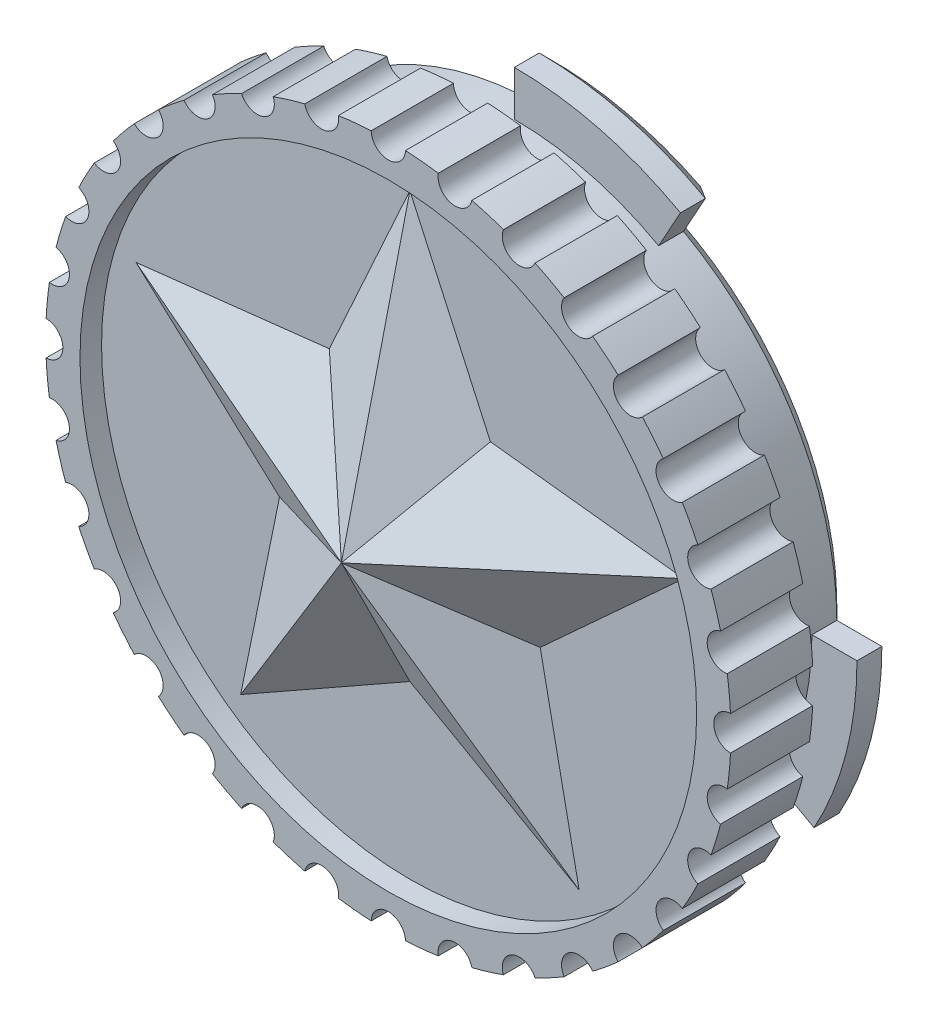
ISO-10303-21;
HEADER;
FILE_DESCRIPTION(('STEP AP214'),'2;1');
FILE_NAME('part.step','',(''),(''),'','','');
FILE_SCHEMA(('AUTOMOTIVE_DESIGN { 1 0 10303 214 1 1 1 1 }'));
ENDSEC;
DATA;
#1=APPLICATION_CONTEXT('core data for automotive mechanical design processes');
#2=APPLICATION_PROTOCOL_DEFINITION('international standard','automotive_design',2000,#1);
#3=PRODUCT_CONTEXT('',#1,'mechanical');
#4=PRODUCT('Part','Part','',(#3));
#5=PRODUCT_RELATED_PRODUCT_CATEGORY('part','',(#4));
#6=PRODUCT_DEFINITION_FORMATION('','',#4);
#7=PRODUCT_DEFINITION_CONTEXT('part definition',#1,'design');
#8=PRODUCT_DEFINITION('design','',#6,#7);
#9=PRODUCT_DEFINITION_SHAPE('','',#8);
#10=(LENGTH_UNIT() NAMED_UNIT(*) SI_UNIT(.MILLI.,.METRE.));
#11=(NAMED_UNIT(*) PLANE_ANGLE_UNIT() SI_UNIT($,.RADIAN.));
#12=(NAMED_UNIT(*) SI_UNIT($,.STERADIAN.) SOLID_ANGLE_UNIT());
#13=UNCERTAINTY_MEASURE_WITH_UNIT(LENGTH_MEASURE(1.E-05),#10,'distance_accuracy_value','');
#14=(GEOMETRIC_REPRESENTATION_CONTEXT(3) GLOBAL_UNCERTAINTY_ASSIGNED_CONTEXT((#13)) GLOBAL_UNIT_ASSIGNED_CONTEXT((#10,
#11,#12)) REPRESENTATION_CONTEXT('',''));
#15=CARTESIAN_POINT('',(0.,0.,0.));
#16=DIRECTION('',(0.,0.,1.));
#17=DIRECTION('',(1.,0.,0.));
#18=AXIS2_PLACEMENT_3D('',#15,#16,#17);
#19=CARTESIAN_POINT('',(0.,0.,6.62));
#20=DIRECTION('',(0.,0.,1.));
#21=DIRECTION('',(1.,0.,0.));
#22=AXIS2_PLACEMENT_3D('',#19,#20,#21);
#23=PLANE('',#22);
#24=CARTESIAN_POINT('',(0.,0.,6.62));
#25=DIRECTION('',(0.,0.,1.));
#26=DIRECTION('',(1.,0.,0.));
#27=AXIS2_PLACEMENT_3D('',#24,#25,#26);
#28=CIRCLE('',#27,14.2875);
#29=CARTESIAN_POINT('',(14.2875,0.,6.62));
#30=VERTEX_POINT('',#29);
#31=EDGE_CURVE('E736',#30,#30,#28,.T.);
#32=ORIENTED_EDGE('',*,*,#31,.T.);
#33=EDGE_LOOP('',(#32));
#34=FACE_BOUND('',#33,.T.);
#35=DIRECTION('',(0.869992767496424,0.493064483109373,0.));
#36=VECTOR('',#35,1.);
#37=CARTESIAN_POINT('',(-7.84302658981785,-10.795,6.62));
#38=LINE('',#37,#36);
#39=CARTESIAN_POINT('',(-7.84302658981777,-10.7950000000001,6.62000000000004));
#40=VERTEX_POINT('',#39);
#41=CARTESIAN_POINT('',(0.,-6.34999999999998,6.62000000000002));
#42=VERTEX_POINT('',#41);
#43=EDGE_CURVE('E774',#40,#42,#38,.T.);
#44=ORIENTED_EDGE('',*,*,#43,.F.);
#45=DIRECTION('',(-0.20008963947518,-0.979777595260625,0.));
#46=VECTOR('',#45,1.);
#47=CARTESIAN_POINT('',(-6.03920887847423,-1.96225791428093,6.62));
#48=LINE('',#47,#46);
#49=CARTESIAN_POINT('',(-6.03920887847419,-1.96225791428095,6.62000000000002));
#50=VERTEX_POINT('',#49);
#51=EDGE_CURVE('E769',#50,#40,#48,.T.);
#52=ORIENTED_EDGE('',*,*,#51,.F.);
#53=DIRECTION('',(0.737774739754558,-0.675046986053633,0.));
#54=VECTOR('',#53,1.);
#55=CARTESIAN_POINT('',(-12.6902835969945,4.12332309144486,6.62));
#56=LINE('',#55,#54);
#57=CARTESIAN_POINT('',(-12.6902835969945,4.12332309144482,6.62000000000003));
#58=VERTEX_POINT('',#57);
#59=EDGE_CURVE('E764',#58,#50,#56,.T.);
#60=ORIENTED_EDGE('',*,*,#59,.F.);
#61=DIRECTION('',(-0.993654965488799,-0.112471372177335,0.));
#62=VECTOR('',#61,1.);
#63=CARTESIAN_POINT('',(-3.73243635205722,5.13725791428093,6.62));
#64=LINE('',#63,#62);
#65=CARTESIAN_POINT('',(-3.73243635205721,5.1372579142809,6.62000000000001));
#66=VERTEX_POINT('',#65);
#67=EDGE_CURVE('E759',#66,#58,#64,.T.);
#68=ORIENTED_EDGE('',*,*,#67,.F.);
#69=DIRECTION('',(-0.414022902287,-0.910266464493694,0.));
#70=VECTOR('',#69,1.);
#71=CARTESIAN_POINT('',(0.,13.3433538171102,6.62));
#72=LINE('',#71,#70);
#73=CARTESIAN_POINT('',(0.,13.3433538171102,6.62000000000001));
#74=VERTEX_POINT('',#73);
#75=EDGE_CURVE('E753',#74,#66,#72,.T.);
#76=ORIENTED_EDGE('',*,*,#75,.F.);
#77=DIRECTION('',(-0.414022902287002,0.910266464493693,0.));
#78=VECTOR('',#77,1.);
#79=CARTESIAN_POINT('',(3.7324363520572,5.13725791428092,6.62));
#80=LINE('',#79,#78);
#81=CARTESIAN_POINT('',(3.7324363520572,5.13725791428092,6.62));
#82=VERTEX_POINT('',#81);
#83=EDGE_CURVE('E742',#82,#74,#80,.T.);
#84=ORIENTED_EDGE('',*,*,#83,.F.);
#85=DIRECTION('',(-0.9936549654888,0.11247137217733,0.));
#86=VECTOR('',#85,1.);
#87=CARTESIAN_POINT('',(12.6902835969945,4.12332309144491,6.62));
#88=LINE('',#87,#86);
#89=CARTESIAN_POINT('',(12.6902835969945,4.12332309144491,6.62));
#90=VERTEX_POINT('',#89);
#91=EDGE_CURVE('E747',#90,#82,#88,.T.);
#92=ORIENTED_EDGE('',*,*,#91,.F.);
#93=DIRECTION('',(0.737774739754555,0.675046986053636,0.));
#94=VECTOR('',#93,1.);
#95=CARTESIAN_POINT('',(6.03920887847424,-1.96225791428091,6.62));
#96=LINE('',#95,#94);
#97=CARTESIAN_POINT('',(6.03920887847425,-1.96225791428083,6.62));
#98=VERTEX_POINT('',#97);
#99=EDGE_CURVE('E788',#98,#90,#96,.T.);
#100=ORIENTED_EDGE('',*,*,#99,.F.);
#101=DIRECTION('',(-0.200089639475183,0.979777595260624,0.));
#102=VECTOR('',#101,1.);
#103=CARTESIAN_POINT('',(7.8430265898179,-10.795,6.62));
#104=LINE('',#103,#102);
#105=CARTESIAN_POINT('',(7.84302658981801,-10.7949999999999,6.62000000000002));
#106=VERTEX_POINT('',#105);
#107=EDGE_CURVE('E783',#106,#98,#104,.T.);
#108=ORIENTED_EDGE('',*,*,#107,.F.);
#109=DIRECTION('',(0.869992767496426,-0.49306448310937,0.));
#110=VECTOR('',#109,1.);
#111=CARTESIAN_POINT('',(0.,-6.35,6.62));
#112=LINE('',#111,#110);
#113=EDGE_CURVE('E779',#42,#106,#112,.T.);
#114=ORIENTED_EDGE('',*,*,#113,.F.);
#115=EDGE_LOOP('',(#44,#52,#60,#68,#76,#84,#92,#100,#108,#114));
#116=FACE_BOUND('',#115,.T.);
#117=ADVANCED_FACE('F39',(#34,#116),#23,.T.);
#118=CARTESIAN_POINT('',(-12.5040816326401,-17.2103918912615,20.4316071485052));
#119=DIRECTION('',(0.453573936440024,0.206302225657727,0.867012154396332));
#120=DIRECTION('',(0.886073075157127,0.,-0.46354558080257));
#121=AXIS2_PLACEMENT_3D('',#118,#119,#120);
#122=PLANE('',#121);
#123=ORIENTED_EDGE('',*,*,#83,.T.);
#124=DIRECTION('',(0.,-0.972838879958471,0.231483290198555));
#125=VECTOR('',#124,1.);
#126=CARTESIAN_POINT('',(0.,-18.6835022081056,14.240667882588));
#127=LINE('',#126,#125);
#128=CARTESIAN_POINT('',(0.,0.,9.79499999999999));
#129=VERTEX_POINT('',#128);
#130=EDGE_CURVE('E737',#74,#129,#127,.T.);
#131=ORIENTED_EDGE('',*,*,#130,.T.);
#132=DIRECTION('',(0.525731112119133,0.723606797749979,-0.447213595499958));
#133=VECTOR('',#132,1.);
#134=CARTESIAN_POINT('',(-12.5040816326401,-17.2103918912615,20.4316071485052));
#135=LINE('',#134,#133);
#136=EDGE_CURVE('E741',#129,#82,#135,.T.);
#137=ORIENTED_EDGE('',*,*,#136,.T.);
#138=EDGE_LOOP('',(#123,#131,#137));
#139=FACE_BOUND('',#138,.T.);
#140=ADVANCED_FACE('F1699',(#139),#122,.T.);
#141=CARTESIAN_POINT('',(-3.54623438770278,-18.2243267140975,20.4316071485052));
#142=DIRECTION('',(0.0560430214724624,0.495125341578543,0.867012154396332));
#143=DIRECTION('',(0.,-0.868376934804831,0.495904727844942));
#144=AXIS2_PLACEMENT_3D('',#141,#142,#143);
#145=PLANE('',#144);
#146=ORIENTED_EDGE('',*,*,#136,.F.);
#147=DIRECTION('',(0.925224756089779,0.300623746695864,-0.231483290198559));
#148=VECTOR('',#147,1.);
#149=CARTESIAN_POINT('',(-10.3828037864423,-3.37357745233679,12.3926883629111));
#150=LINE('',#149,#148);
#151=EDGE_CURVE('E743',#129,#90,#150,.T.);
#152=ORIENTED_EDGE('',*,*,#151,.T.);
#153=ORIENTED_EDGE('',*,*,#91,.T.);
#154=EDGE_LOOP('',(#146,#152,#153));
#155=FACE_BOUND('',#154,.T.);
#156=ADVANCED_FACE('F1705',(#155),#145,.T.);
#157=CARTESIAN_POINT('',(0.,0.,7.62));
#158=DIRECTION('',(0.,0.,-1.));
#159=DIRECTION('',(-1.,0.,0.));
#160=AXIS2_PLACEMENT_3D('',#157,#158,#159);
#161=CYLINDRICAL_SURFACE('',#160,15.875);
#162=CARTESIAN_POINT('',(0.,0.,3.81));
#163=DIRECTION('',(0.,0.,1.));
#164=DIRECTION('',(1.,0.,0.));
#165=AXIS2_PLACEMENT_3D('',#162,#163,#164);
#166=CIRCLE('',#165,15.875);
#167=CARTESIAN_POINT('',(-0.793501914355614,15.85515625,3.81));
#168=VERTEX_POINT('',#167);
#169=CARTESIAN_POINT('',(-2.31493254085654,15.7053084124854,3.81));
#170=VERTEX_POINT('',#169);
#171=EDGE_CURVE('E794',#168,#170,#166,.T.);
#172=ORIENTED_EDGE('',*,*,#171,.T.);
#173=DIRECTION('',(0.,0.,1.));
#174=VECTOR('',#173,1.);
#175=CARTESIAN_POINT('',(-2.31493254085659,15.7053084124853,3.810006));
#176=LINE('',#175,#174);
#177=CARTESIAN_POINT('',(-2.3149325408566,15.7053084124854,7.62));
#178=VERTEX_POINT('',#177);
#179=EDGE_CURVE('E800',#170,#178,#176,.T.);
#180=ORIENTED_EDGE('',*,*,#179,.T.);
#181=CARTESIAN_POINT('',(0.,0.,7.62));
#182=DIRECTION('',(0.,0.,1.));
#183=DIRECTION('',(1.,0.,0.));
#184=AXIS2_PLACEMENT_3D('',#181,#182,#183);
#185=CIRCLE('',#184,15.875);
#186=CARTESIAN_POINT('',(-0.79350191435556,15.85515625,7.62));
#187=VERTEX_POINT('',#186);
#188=EDGE_CURVE('E1208',#187,#178,#185,.T.);
#189=ORIENTED_EDGE('',*,*,#188,.F.);
#190=DIRECTION('',(0.,0.,1.));
#191=VECTOR('',#190,1.);
#192=CARTESIAN_POINT('',(-0.793501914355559,15.85515625,3.810006));
#193=LINE('',#192,#191);
#194=EDGE_CURVE('E795',#187,#168,#193,.F.);
#195=ORIENTED_EDGE('',*,*,#194,.T.);
#196=EDGE_LOOP('',(#172,#180,#189,#195));
#197=FACE_BOUND('',#196,.T.);
#198=ADVANCED_FACE('F1730',(#197),#161,.T.);
#199=CARTESIAN_POINT('',(-3.87144253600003,15.3956993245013,7.62));
#200=VERTEX_POINT('',#199);
#201=CARTESIAN_POINT('',(-5.33440543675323,14.9519143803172,7.62));
#202=VERTEX_POINT('',#201);
#203=EDGE_CURVE('E805',#200,#202,#185,.T.);
#204=ORIENTED_EDGE('',*,*,#203,.F.);
#205=DIRECTION('',(0.,0.,1.));
#206=VECTOR('',#205,1.);
#207=CARTESIAN_POINT('',(-3.87144253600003,15.3956993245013,3.810006));
#208=LINE('',#207,#206);
#209=CARTESIAN_POINT('',(-3.87144253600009,15.3956993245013,3.81));
#210=VERTEX_POINT('',#209);
#211=EDGE_CURVE('E799',#200,#210,#208,.F.);
#212=ORIENTED_EDGE('',*,*,#211,.T.);
#213=CARTESIAN_POINT('',(-5.33440543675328,14.9519143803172,3.81));
#214=VERTEX_POINT('',#213);
#215=EDGE_CURVE('E1168',#210,#214,#166,.T.);
#216=ORIENTED_EDGE('',*,*,#215,.T.);
#217=DIRECTION('',(0.,0.,1.));
#218=VECTOR('',#217,1.);
#219=CARTESIAN_POINT('',(-5.33440543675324,14.9519143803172,3.810006));
#220=LINE('',#219,#218);
#221=EDGE_CURVE('E1164',#214,#202,#220,.T.);
#222=ORIENTED_EDGE('',*,*,#221,.T.);
#223=EDGE_LOOP('',(#204,#212,#216,#222));
#224=FACE_BOUND('',#223,.T.);
#225=ADVANCED_FACE('F2614',(#224),#161,.T.);
#226=CARTESIAN_POINT('',(-6.80060579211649,14.3445943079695,7.62));
#227=VERTEX_POINT('',#226);
#228=CARTESIAN_POINT('',(-8.14888012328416,13.6239266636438,7.62));
#229=VERTEX_POINT('',#228);
#230=EDGE_CURVE('E2837',#227,#229,#185,.T.);
#231=ORIENTED_EDGE('',*,*,#230,.F.);
#232=DIRECTION('',(0.,0.,1.));
#233=VECTOR('',#232,1.);
#234=CARTESIAN_POINT('',(-6.80060579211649,14.3445943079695,3.810006));
#235=LINE('',#234,#233);
#236=CARTESIAN_POINT('',(-6.80060579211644,14.3445943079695,3.81));
#237=VERTEX_POINT('',#236);
#238=EDGE_CURVE('E1160',#227,#237,#235,.F.);
#239=ORIENTED_EDGE('',*,*,#238,.T.);
#240=CARTESIAN_POINT('',(-8.14888012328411,13.6239266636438,3.81));
#241=VERTEX_POINT('',#240);
#242=EDGE_CURVE('E1156',#237,#241,#166,.T.);
#243=ORIENTED_EDGE('',*,*,#242,.T.);
#244=DIRECTION('',(0.,0.,1.));
#245=VECTOR('',#244,1.);
#246=CARTESIAN_POINT('',(-8.14888012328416,13.6239266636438,3.810006));
#247=LINE('',#246,#245);
#248=EDGE_CURVE('E1152',#241,#229,#247,.T.);
#249=ORIENTED_EDGE('',*,*,#248,.T.);
#250=EDGE_LOOP('',(#231,#239,#243,#249));
#251=FACE_BOUND('',#250,.T.);
#252=ADVANCED_FACE('F2605',(#251),#161,.T.);
#253=CARTESIAN_POINT('',(-9.46842558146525,12.7422345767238,7.62));
#254=VERTEX_POINT('',#253);
#255=CARTESIAN_POINT('',(-10.6501979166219,11.7723790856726,7.62));
#256=VERTEX_POINT('',#255);
#257=EDGE_CURVE('E2832',#254,#256,#185,.T.);
#258=ORIENTED_EDGE('',*,*,#257,.F.);
#259=DIRECTION('',(0.,0.,1.));
#260=VECTOR('',#259,1.);
#261=CARTESIAN_POINT('',(-9.46842558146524,12.7422345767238,3.810006));
#262=LINE('',#261,#260);
#263=CARTESIAN_POINT('',(-9.46842558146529,12.7422345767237,3.81));
#264=VERTEX_POINT('',#263);
#265=EDGE_CURVE('E1148',#254,#264,#262,.F.);
#266=ORIENTED_EDGE('',*,*,#265,.T.);
#267=CARTESIAN_POINT('',(-10.6501979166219,11.7723790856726,3.81));
#268=VERTEX_POINT('',#267);
#269=EDGE_CURVE('E1144',#264,#268,#166,.T.);
#270=ORIENTED_EDGE('',*,*,#269,.T.);
#271=DIRECTION('',(0.,0.,1.));
#272=VECTOR('',#271,1.);
#273=CARTESIAN_POINT('',(-10.6501979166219,11.7723790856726,3.810006));
#274=LINE('',#273,#272);
#275=EDGE_CURVE('E1140',#268,#256,#274,.T.);
#276=ORIENTED_EDGE('',*,*,#275,.T.);
#277=EDGE_LOOP('',(#258,#266,#270,#276));
#278=FACE_BOUND('',#277,.T.);
#279=ADVANCED_FACE('F2596',(#278),#161,.T.);
#280=CARTESIAN_POINT('',(-11.7723790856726,10.6501979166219,7.62));
#281=VERTEX_POINT('',#280);
#282=CARTESIAN_POINT('',(-12.7422345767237,9.46842558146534,7.62));
#283=VERTEX_POINT('',#282);
#284=EDGE_CURVE('E2827',#281,#283,#185,.T.);
#285=ORIENTED_EDGE('',*,*,#284,.F.);
#286=DIRECTION('',(0.,0.,1.));
#287=VECTOR('',#286,1.);
#288=CARTESIAN_POINT('',(-11.7723790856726,10.6501979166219,3.810006));
#289=LINE('',#288,#287);
#290=CARTESIAN_POINT('',(-11.7723790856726,10.6501979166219,3.81));
#291=VERTEX_POINT('',#290);
#292=EDGE_CURVE('E1136',#281,#291,#289,.F.);
#293=ORIENTED_EDGE('',*,*,#292,.T.);
#294=CARTESIAN_POINT('',(-12.7422345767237,9.46842558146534,3.81));
#295=VERTEX_POINT('',#294);
#296=EDGE_CURVE('E1132',#291,#295,#166,.T.);
#297=ORIENTED_EDGE('',*,*,#296,.T.);
#298=DIRECTION('',(0.,0.,1.));
#299=VECTOR('',#298,1.);
#300=CARTESIAN_POINT('',(-12.7422345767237,9.46842558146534,3.810006));
#301=LINE('',#300,#299);
#302=EDGE_CURVE('E1128',#295,#283,#301,.T.);
#303=ORIENTED_EDGE('',*,*,#302,.T.);
#304=EDGE_LOOP('',(#285,#293,#297,#303));
#305=FACE_BOUND('',#304,.T.);
#306=ADVANCED_FACE('F2587',(#305),#161,.T.);
#307=CARTESIAN_POINT('',(-13.6239266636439,8.14888012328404,7.62));
#308=VERTEX_POINT('',#307);
#309=CARTESIAN_POINT('',(-14.3445943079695,6.80060579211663,7.62));
#310=VERTEX_POINT('',#309);
#311=EDGE_CURVE('E2822',#308,#310,#185,.T.);
#312=ORIENTED_EDGE('',*,*,#311,.F.);
#313=DIRECTION('',(0.,0.,1.));
#314=VECTOR('',#313,1.);
#315=CARTESIAN_POINT('',(-13.6239266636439,8.14888012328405,3.810006));
#316=LINE('',#315,#314);
#317=CARTESIAN_POINT('',(-13.6239266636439,8.14888012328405,3.81));
#318=VERTEX_POINT('',#317);
#319=EDGE_CURVE('E1124',#308,#318,#316,.F.);
#320=ORIENTED_EDGE('',*,*,#319,.T.);
#321=CARTESIAN_POINT('',(-14.3445943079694,6.80060579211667,3.81));
#322=VERTEX_POINT('',#321);
#323=EDGE_CURVE('E1120',#318,#322,#166,.T.);
#324=ORIENTED_EDGE('',*,*,#323,.T.);
#325=DIRECTION('',(0.,0.,1.));
#326=VECTOR('',#325,1.);
#327=CARTESIAN_POINT('',(-14.3445943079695,6.80060579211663,3.810006));
#328=LINE('',#327,#326);
#329=EDGE_CURVE('E1116',#322,#310,#328,.T.);
#330=ORIENTED_EDGE('',*,*,#329,.T.);
#331=EDGE_LOOP('',(#312,#320,#324,#330));
#332=FACE_BOUND('',#331,.T.);
#333=ADVANCED_FACE('F2578',(#332),#161,.T.);
#334=CARTESIAN_POINT('',(-14.9519143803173,5.33440543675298,7.62));
#335=VERTEX_POINT('',#334);
#336=CARTESIAN_POINT('',(-15.3956993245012,3.87144253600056,7.62));
#337=VERTEX_POINT('',#336);
#338=EDGE_CURVE('E2817',#335,#337,#185,.T.);
#339=ORIENTED_EDGE('',*,*,#338,.F.);
#340=DIRECTION('',(0.,0.,1.));
#341=VECTOR('',#340,1.);
#342=CARTESIAN_POINT('',(-14.9519143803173,5.33440543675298,3.810006));
#343=LINE('',#342,#341);
#344=CARTESIAN_POINT('',(-14.9519143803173,5.33440543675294,3.81));
#345=VERTEX_POINT('',#344);
#346=EDGE_CURVE('E1112',#335,#345,#343,.F.);
#347=ORIENTED_EDGE('',*,*,#346,.T.);
#348=CARTESIAN_POINT('',(-15.3956993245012,3.87144253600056,3.81));
#349=VERTEX_POINT('',#348);
#350=EDGE_CURVE('E1108',#345,#349,#166,.T.);
#351=ORIENTED_EDGE('',*,*,#350,.T.);
#352=DIRECTION('',(0.,0.,1.));
#353=VECTOR('',#352,1.);
#354=CARTESIAN_POINT('',(-15.3956993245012,3.87144253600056,3.810006));
#355=LINE('',#354,#353);
#356=EDGE_CURVE('E1104',#349,#337,#355,.T.);
#357=ORIENTED_EDGE('',*,*,#356,.T.);
#358=EDGE_LOOP('',(#339,#347,#351,#357));
#359=FACE_BOUND('',#358,.T.);
#360=ADVANCED_FACE('F2569',(#359),#161,.T.);
#361=CARTESIAN_POINT('',(-15.7053084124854,2.31493254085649,7.62));
#362=VERTEX_POINT('',#361);
#363=CARTESIAN_POINT('',(-15.85515625,0.793501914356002,7.62));
#364=VERTEX_POINT('',#363);
#365=EDGE_CURVE('E2812',#362,#364,#185,.T.);
#366=ORIENTED_EDGE('',*,*,#365,.F.);
#367=DIRECTION('',(0.,0.,1.));
#368=VECTOR('',#367,1.);
#369=CARTESIAN_POINT('',(-15.7053084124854,2.31493254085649,3.810006));
#370=LINE('',#369,#368);
#371=CARTESIAN_POINT('',(-15.7053084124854,2.31493254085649,3.81));
#372=VERTEX_POINT('',#371);
#373=EDGE_CURVE('E1100',#362,#372,#370,.F.);
#374=ORIENTED_EDGE('',*,*,#373,.T.);
#375=CARTESIAN_POINT('',(-15.85515625,0.793501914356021,3.81));
#376=VERTEX_POINT('',#375);
#377=EDGE_CURVE('E1096',#372,#376,#166,.T.);
#378=ORIENTED_EDGE('',*,*,#377,.T.);
#379=DIRECTION('',(0.,0.,1.));
#380=VECTOR('',#379,1.);
#381=CARTESIAN_POINT('',(-15.85515625,0.793501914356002,3.810006));
#382=LINE('',#381,#380);
#383=EDGE_CURVE('E1092',#376,#364,#382,.T.);
#384=ORIENTED_EDGE('',*,*,#383,.T.);
#385=EDGE_LOOP('',(#366,#374,#378,#384));
#386=FACE_BOUND('',#385,.T.);
#387=ADVANCED_FACE('F2560',(#386),#161,.T.);
#388=CARTESIAN_POINT('',(-15.85515625,-0.79350191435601,7.62));
#389=VERTEX_POINT('',#388);
#390=CARTESIAN_POINT('',(-15.7053084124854,-2.31493254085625,7.62));
#391=VERTEX_POINT('',#390);
#392=EDGE_CURVE('E2807',#389,#391,#185,.T.);
#393=ORIENTED_EDGE('',*,*,#392,.F.);
#394=DIRECTION('',(0.,0.,1.));
#395=VECTOR('',#394,1.);
#396=CARTESIAN_POINT('',(-15.85515625,-0.793501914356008,3.810006));
#397=LINE('',#396,#395);
#398=CARTESIAN_POINT('',(-15.85515625,-0.793501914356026,3.81));
#399=VERTEX_POINT('',#398);
#400=EDGE_CURVE('E1088',#389,#399,#397,.F.);
#401=ORIENTED_EDGE('',*,*,#400,.T.);
#402=CARTESIAN_POINT('',(-15.7053084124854,-2.31493254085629,3.81));
#403=VERTEX_POINT('',#402);
#404=EDGE_CURVE('E1084',#399,#403,#166,.T.);
#405=ORIENTED_EDGE('',*,*,#404,.T.);
#406=DIRECTION('',(0.,0.,1.));
#407=VECTOR('',#406,1.);
#408=CARTESIAN_POINT('',(-15.7053084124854,-2.31493254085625,3.810006));
#409=LINE('',#408,#407);
#410=EDGE_CURVE('E1080',#403,#391,#409,.T.);
#411=ORIENTED_EDGE('',*,*,#410,.T.);
#412=EDGE_LOOP('',(#393,#401,#405,#411));
#413=FACE_BOUND('',#412,.T.);
#414=ADVANCED_FACE('F2551',(#413),#161,.T.);
#415=CARTESIAN_POINT('',(-15.3956993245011,-3.87144253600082,7.62));
#416=VERTEX_POINT('',#415);
#417=CARTESIAN_POINT('',(-14.9519143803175,-5.33440543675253,7.62));
#418=VERTEX_POINT('',#417);
#419=EDGE_CURVE('E2802',#416,#418,#185,.T.);
#420=ORIENTED_EDGE('',*,*,#419,.F.);
#421=DIRECTION('',(0.,0.,1.));
#422=VECTOR('',#421,1.);
#423=CARTESIAN_POINT('',(-15.3956993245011,-3.87144253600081,3.810006));
#424=LINE('',#423,#422);
#425=CARTESIAN_POINT('',(-15.3956993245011,-3.87144253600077,3.81));
#426=VERTEX_POINT('',#425);
#427=EDGE_CURVE('E1076',#416,#426,#424,.F.);
#428=ORIENTED_EDGE('',*,*,#427,.T.);
#429=CARTESIAN_POINT('',(-14.9519143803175,-5.33440543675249,3.81));
#430=VERTEX_POINT('',#429);
#431=EDGE_CURVE('E1072',#426,#430,#166,.T.);
#432=ORIENTED_EDGE('',*,*,#431,.T.);
#433=DIRECTION('',(0.,0.,1.));
#434=VECTOR('',#433,1.);
#435=CARTESIAN_POINT('',(-14.9519143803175,-5.33440543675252,3.810006));
#436=LINE('',#435,#434);
#437=EDGE_CURVE('E1068',#430,#418,#436,.T.);
#438=ORIENTED_EDGE('',*,*,#437,.T.);
#439=EDGE_LOOP('',(#420,#428,#432,#438));
#440=FACE_BOUND('',#439,.T.);
#441=ADVANCED_FACE('F2542',(#440),#161,.T.);
#442=CARTESIAN_POINT('',(-14.3445943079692,-6.80060579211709,7.62));
#443=VERTEX_POINT('',#442);
#444=CARTESIAN_POINT('',(-13.6239266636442,-8.14888012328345,7.62));
#445=VERTEX_POINT('',#444);
#446=EDGE_CURVE('E2797',#443,#445,#185,.T.);
#447=ORIENTED_EDGE('',*,*,#446,.F.);
#448=DIRECTION('',(0.,0.,1.));
#449=VECTOR('',#448,1.);
#450=CARTESIAN_POINT('',(-14.3445943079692,-6.80060579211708,3.810006));
#451=LINE('',#450,#449);
#452=CARTESIAN_POINT('',(-14.3445943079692,-6.80060579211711,3.81));
#453=VERTEX_POINT('',#452);
#454=EDGE_CURVE('E1064',#443,#453,#451,.F.);
#455=ORIENTED_EDGE('',*,*,#454,.T.);
#456=CARTESIAN_POINT('',(-13.6239266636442,-8.14888012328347,3.81));
#457=VERTEX_POINT('',#456);
#458=EDGE_CURVE('E1060',#453,#457,#166,.T.);
#459=ORIENTED_EDGE('',*,*,#458,.T.);
#460=DIRECTION('',(0.,0.,1.));
#461=VECTOR('',#460,1.);
#462=CARTESIAN_POINT('',(-13.6239266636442,-8.14888012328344,3.810006));
#463=LINE('',#462,#461);
#464=EDGE_CURVE('E1056',#457,#445,#463,.T.);
#465=ORIENTED_EDGE('',*,*,#464,.T.);
#466=EDGE_LOOP('',(#447,#455,#459,#465));
#467=FACE_BOUND('',#466,.T.);
#468=ADVANCED_FACE('F2533',(#467),#161,.T.);
#469=CARTESIAN_POINT('',(-12.7422345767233,-9.46842558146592,7.62));
#470=VERTEX_POINT('',#469);
#471=CARTESIAN_POINT('',(-11.7723790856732,-10.6501979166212,7.62));
#472=VERTEX_POINT('',#471);
#473=EDGE_CURVE('E2792',#470,#472,#185,.T.);
#474=ORIENTED_EDGE('',*,*,#473,.F.);
#475=DIRECTION('',(0.,0.,1.));
#476=VECTOR('',#475,1.);
#477=CARTESIAN_POINT('',(-12.7422345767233,-9.46842558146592,3.810006));
#478=LINE('',#477,#476);
#479=CARTESIAN_POINT('',(-12.7422345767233,-9.46842558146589,3.81));
#480=VERTEX_POINT('',#479);
#481=EDGE_CURVE('E1052',#470,#480,#478,.F.);
#482=ORIENTED_EDGE('',*,*,#481,.T.);
#483=CARTESIAN_POINT('',(-11.7723790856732,-10.6501979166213,3.81));
#484=VERTEX_POINT('',#483);
#485=EDGE_CURVE('E1048',#480,#484,#166,.T.);
#486=ORIENTED_EDGE('',*,*,#485,.T.);
#487=DIRECTION('',(0.,0.,1.));
#488=VECTOR('',#487,1.);
#489=CARTESIAN_POINT('',(-11.7723790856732,-10.6501979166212,3.810006));
#490=LINE('',#489,#488);
#491=EDGE_CURVE('E1044',#484,#472,#490,.T.);
#492=ORIENTED_EDGE('',*,*,#491,.T.);
#493=EDGE_LOOP('',(#474,#482,#486,#492));
#494=FACE_BOUND('',#493,.T.);
#495=ADVANCED_FACE('F2524',(#494),#161,.T.);
#496=CARTESIAN_POINT('',(-10.6501979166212,-11.7723790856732,7.62));
#497=VERTEX_POINT('',#496);
#498=CARTESIAN_POINT('',(-9.4684255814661,-12.7422345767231,7.62));
#499=VERTEX_POINT('',#498);
#500=EDGE_CURVE('E2787',#497,#499,#185,.T.);
#501=ORIENTED_EDGE('',*,*,#500,.F.);
#502=DIRECTION('',(0.,0.,1.));
#503=VECTOR('',#502,1.);
#504=CARTESIAN_POINT('',(-10.6501979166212,-11.7723790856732,3.810006));
#505=LINE('',#504,#503);
#506=CARTESIAN_POINT('',(-10.6501979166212,-11.7723790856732,3.81));
#507=VERTEX_POINT('',#506);
#508=EDGE_CURVE('E1040',#497,#507,#505,.F.);
#509=ORIENTED_EDGE('',*,*,#508,.T.);
#510=CARTESIAN_POINT('',(-9.46842558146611,-12.7422345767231,3.81));
#511=VERTEX_POINT('',#510);
#512=EDGE_CURVE('E1036',#507,#511,#166,.T.);
#513=ORIENTED_EDGE('',*,*,#512,.T.);
#514=DIRECTION('',(0.,0.,1.));
#515=VECTOR('',#514,1.);
#516=CARTESIAN_POINT('',(-9.4684255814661,-12.7422345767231,3.810006));
#517=LINE('',#516,#515);
#518=EDGE_CURVE('E1032',#511,#499,#517,.T.);
#519=ORIENTED_EDGE('',*,*,#518,.T.);
#520=EDGE_LOOP('',(#501,#509,#513,#519));
#521=FACE_BOUND('',#520,.T.);
#522=ADVANCED_FACE('F2515',(#521),#161,.T.);
#523=CARTESIAN_POINT('',(-8.14888012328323,-13.6239266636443,7.62));
#524=VERTEX_POINT('',#523);
#525=CARTESIAN_POINT('',(-6.80060579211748,-14.3445943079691,7.62));
#526=VERTEX_POINT('',#525);
#527=EDGE_CURVE('E2782',#524,#526,#185,.T.);
#528=ORIENTED_EDGE('',*,*,#527,.F.);
#529=DIRECTION('',(0.,0.,1.));
#530=VECTOR('',#529,1.);
#531=CARTESIAN_POINT('',(-8.14888012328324,-13.6239266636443,3.810006));
#532=LINE('',#531,#530);
#533=CARTESIAN_POINT('',(-8.14888012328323,-13.6239266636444,3.81));
#534=VERTEX_POINT('',#533);
#535=EDGE_CURVE('E1028',#524,#534,#532,.F.);
#536=ORIENTED_EDGE('',*,*,#535,.T.);
#537=CARTESIAN_POINT('',(-6.80060579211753,-14.344594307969,3.81));
#538=VERTEX_POINT('',#537);
#539=EDGE_CURVE('E1024',#534,#538,#166,.T.);
#540=ORIENTED_EDGE('',*,*,#539,.T.);
#541=DIRECTION('',(0.,0.,1.));
#542=VECTOR('',#541,1.);
#543=CARTESIAN_POINT('',(-6.80060579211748,-14.3445943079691,3.810006));
#544=LINE('',#543,#542);
#545=EDGE_CURVE('E1020',#538,#526,#544,.T.);
#546=ORIENTED_EDGE('',*,*,#545,.T.);
#547=EDGE_LOOP('',(#528,#536,#540,#546));
#548=FACE_BOUND('',#547,.T.);
#549=ADVANCED_FACE('F2506',(#548),#161,.T.);
#550=CARTESIAN_POINT('',(-5.33440543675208,-14.9519143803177,7.62));
#551=VERTEX_POINT('',#550);
#552=CARTESIAN_POINT('',(-3.87144253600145,-15.3956993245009,7.62));
#553=VERTEX_POINT('',#552);
#554=EDGE_CURVE('E2777',#551,#553,#185,.T.);
#555=ORIENTED_EDGE('',*,*,#554,.F.);
#556=DIRECTION('',(0.,0.,1.));
#557=VECTOR('',#556,1.);
#558=CARTESIAN_POINT('',(-5.33440543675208,-14.9519143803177,3.810006));
#559=LINE('',#558,#557);
#560=CARTESIAN_POINT('',(-5.33440543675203,-14.9519143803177,3.81));
#561=VERTEX_POINT('',#560);
#562=EDGE_CURVE('E1016',#551,#561,#559,.F.);
#563=ORIENTED_EDGE('',*,*,#562,.T.);
#564=CARTESIAN_POINT('',(-3.87144253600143,-15.3956993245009,3.81));
#565=VERTEX_POINT('',#564);
#566=EDGE_CURVE('E1012',#561,#565,#166,.T.);
#567=ORIENTED_EDGE('',*,*,#566,.T.);
#568=DIRECTION('',(0.,0.,1.));
#569=VECTOR('',#568,1.);
#570=CARTESIAN_POINT('',(-3.87144253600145,-15.3956993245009,3.810006));
#571=LINE('',#570,#569);
#572=EDGE_CURVE('E1008',#565,#553,#571,.T.);
#573=ORIENTED_EDGE('',*,*,#572,.T.);
#574=EDGE_LOOP('',(#555,#563,#567,#573));
#575=FACE_BOUND('',#574,.T.);
#576=ADVANCED_FACE('F2497',(#575),#161,.T.);
#577=CARTESIAN_POINT('',(-2.31493254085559,-15.7053084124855,7.62));
#578=VERTEX_POINT('',#577);
#579=CARTESIAN_POINT('',(-0.793501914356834,-15.8551562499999,7.62));
#580=VERTEX_POINT('',#579);
#581=EDGE_CURVE('E2772',#578,#580,#185,.T.);
#582=ORIENTED_EDGE('',*,*,#581,.F.);
#583=DIRECTION('',(0.,0.,1.));
#584=VECTOR('',#583,1.);
#585=CARTESIAN_POINT('',(-2.31493254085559,-15.7053084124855,3.810006));
#586=LINE('',#585,#584);
#587=CARTESIAN_POINT('',(-2.31493254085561,-15.7053084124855,3.81));
#588=VERTEX_POINT('',#587);
#589=EDGE_CURVE('E1004',#578,#588,#586,.F.);
#590=ORIENTED_EDGE('',*,*,#589,.T.);
#591=CARTESIAN_POINT('',(-0.79350191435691,-15.8551562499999,3.81));
#592=VERTEX_POINT('',#591);
#593=EDGE_CURVE('E1000',#588,#592,#166,.T.);
#594=ORIENTED_EDGE('',*,*,#593,.T.);
#595=DIRECTION('',(0.,0.,1.));
#596=VECTOR('',#595,1.);
#597=CARTESIAN_POINT('',(-0.793501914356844,-15.8551562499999,3.810006));
#598=LINE('',#597,#596);
#599=EDGE_CURVE('E996',#592,#580,#598,.T.);
#600=ORIENTED_EDGE('',*,*,#599,.T.);
#601=EDGE_LOOP('',(#582,#590,#594,#600));
#602=FACE_BOUND('',#601,.T.);
#603=ADVANCED_FACE('F2488',(#602),#161,.T.);
#604=CARTESIAN_POINT('',(0.793501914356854,-15.8551562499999,7.62));
#605=VERTEX_POINT('',#604);
#606=CARTESIAN_POINT('',(2.31493254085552,-15.7053084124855,7.62));
#607=VERTEX_POINT('',#606);
#608=EDGE_CURVE('E2767',#605,#607,#185,.T.);
#609=ORIENTED_EDGE('',*,*,#608,.F.);
#610=DIRECTION('',(0.,0.,1.));
#611=VECTOR('',#610,1.);
#612=CARTESIAN_POINT('',(0.793501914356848,-15.8551562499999,3.810006));
#613=LINE('',#612,#611);
#614=CARTESIAN_POINT('',(0.793501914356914,-15.8551562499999,3.81));
#615=VERTEX_POINT('',#614);
#616=EDGE_CURVE('E992',#605,#615,#613,.F.);
#617=ORIENTED_EDGE('',*,*,#616,.T.);
#618=CARTESIAN_POINT('',(2.31493254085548,-15.7053084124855,3.81));
#619=VERTEX_POINT('',#618);
#620=EDGE_CURVE('E988',#615,#619,#166,.T.);
#621=ORIENTED_EDGE('',*,*,#620,.T.);
#622=DIRECTION('',(0.,0.,1.));
#623=VECTOR('',#622,1.);
#624=CARTESIAN_POINT('',(2.31493254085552,-15.7053084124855,3.810006));
#625=LINE('',#624,#623);
#626=EDGE_CURVE('E984',#619,#607,#625,.T.);
#627=ORIENTED_EDGE('',*,*,#626,.T.);
#628=EDGE_LOOP('',(#609,#617,#621,#627));
#629=FACE_BOUND('',#628,.T.);
#630=ADVANCED_FACE('F2479',(#629),#161,.T.);
#631=CARTESIAN_POINT('',(3.87144253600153,-15.3956993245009,7.62));
#632=VERTEX_POINT('',#631);
#633=CARTESIAN_POINT('',(5.33440543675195,-14.9519143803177,7.62));
#634=VERTEX_POINT('',#633);
#635=EDGE_CURVE('E2762',#632,#634,#185,.T.);
#636=ORIENTED_EDGE('',*,*,#635,.F.);
#637=DIRECTION('',(0.,0.,1.));
#638=VECTOR('',#637,1.);
#639=CARTESIAN_POINT('',(3.87144253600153,-15.3956993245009,3.810006));
#640=LINE('',#639,#638);
#641=CARTESIAN_POINT('',(3.87144253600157,-15.3956993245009,3.81));
#642=VERTEX_POINT('',#641);
#643=EDGE_CURVE('E980',#632,#642,#640,.F.);
#644=ORIENTED_EDGE('',*,*,#643,.T.);
#645=CARTESIAN_POINT('',(5.33440543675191,-14.9519143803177,3.81));
#646=VERTEX_POINT('',#645);
#647=EDGE_CURVE('E976',#642,#646,#166,.T.);
#648=ORIENTED_EDGE('',*,*,#647,.T.);
#649=DIRECTION('',(0.,0.,1.));
#650=VECTOR('',#649,1.);
#651=CARTESIAN_POINT('',(5.33440543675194,-14.9519143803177,3.810006));
#652=LINE('',#651,#650);
#653=EDGE_CURVE('E972',#646,#634,#652,.T.);
#654=ORIENTED_EDGE('',*,*,#653,.T.);
#655=EDGE_LOOP('',(#636,#644,#648,#654));
#656=FACE_BOUND('',#655,.T.);
#657=ADVANCED_FACE('F2470',(#656),#161,.T.);
#658=CARTESIAN_POINT('',(6.80060579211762,-14.344594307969,7.62));
#659=VERTEX_POINT('',#658);
#660=CARTESIAN_POINT('',(8.14888012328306,-13.6239266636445,7.62));
#661=VERTEX_POINT('',#660);
#662=EDGE_CURVE('E2757',#659,#661,#185,.T.);
#663=ORIENTED_EDGE('',*,*,#662,.F.);
#664=DIRECTION('',(0.,0.,1.));
#665=VECTOR('',#664,1.);
#666=CARTESIAN_POINT('',(6.80060579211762,-14.344594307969,3.810006));
#667=LINE('',#666,#665);
#668=CARTESIAN_POINT('',(6.80060579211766,-14.344594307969,3.81));
#669=VERTEX_POINT('',#668);
#670=EDGE_CURVE('E968',#659,#669,#667,.F.);
#671=ORIENTED_EDGE('',*,*,#670,.T.);
#672=CARTESIAN_POINT('',(8.14888012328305,-13.6239266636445,3.81));
#673=VERTEX_POINT('',#672);
#674=EDGE_CURVE('E964',#669,#673,#166,.T.);
#675=ORIENTED_EDGE('',*,*,#674,.T.);
#676=DIRECTION('',(0.,0.,1.));
#677=VECTOR('',#676,1.);
#678=CARTESIAN_POINT('',(8.14888012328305,-13.6239266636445,3.810006));
#679=LINE('',#678,#677);
#680=EDGE_CURVE('E960',#673,#661,#679,.T.);
#681=ORIENTED_EDGE('',*,*,#680,.T.);
#682=EDGE_LOOP('',(#663,#671,#675,#681));
#683=FACE_BOUND('',#682,.T.);
#684=ADVANCED_FACE('F2461',(#683),#161,.T.);
#685=CARTESIAN_POINT('',(9.46842558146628,-12.742234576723,7.62));
#686=VERTEX_POINT('',#685);
#687=CARTESIAN_POINT('',(10.650197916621,-11.7723790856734,7.62));
#688=VERTEX_POINT('',#687);
#689=EDGE_CURVE('E2752',#686,#688,#185,.T.);
#690=ORIENTED_EDGE('',*,*,#689,.F.);
#691=DIRECTION('',(0.,0.,1.));
#692=VECTOR('',#691,1.);
#693=CARTESIAN_POINT('',(9.46842558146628,-12.742234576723,3.810006));
#694=LINE('',#693,#692);
#695=CARTESIAN_POINT('',(9.46842558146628,-12.742234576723,3.81));
#696=VERTEX_POINT('',#695);
#697=EDGE_CURVE('E956',#686,#696,#694,.F.);
#698=ORIENTED_EDGE('',*,*,#697,.T.);
#699=CARTESIAN_POINT('',(10.650197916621,-11.7723790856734,3.81));
#700=VERTEX_POINT('',#699);
#701=EDGE_CURVE('E952',#696,#700,#166,.T.);
#702=ORIENTED_EDGE('',*,*,#701,.T.);
#703=DIRECTION('',(0.,0.,1.));
#704=VECTOR('',#703,1.);
#705=CARTESIAN_POINT('',(10.650197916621,-11.7723790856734,3.810006));
#706=LINE('',#705,#704);
#707=EDGE_CURVE('E948',#700,#688,#706,.T.);
#708=ORIENTED_EDGE('',*,*,#707,.T.);
#709=EDGE_LOOP('',(#690,#698,#702,#708));
#710=FACE_BOUND('',#709,.T.);
#711=ADVANCED_FACE('F2452',(#710),#161,.T.);
#712=CARTESIAN_POINT('',(11.7723790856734,-10.650197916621,7.62));
#713=VERTEX_POINT('',#712);
#714=CARTESIAN_POINT('',(12.7422345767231,-9.46842558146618,7.62));
#715=VERTEX_POINT('',#714);
#716=EDGE_CURVE('E2747',#713,#715,#185,.T.);
#717=ORIENTED_EDGE('',*,*,#716,.F.);
#718=DIRECTION('',(0.,0.,1.));
#719=VECTOR('',#718,1.);
#720=CARTESIAN_POINT('',(11.7723790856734,-10.650197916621,3.810006));
#721=LINE('',#720,#719);
#722=CARTESIAN_POINT('',(11.7723790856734,-10.650197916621,3.81));
#723=VERTEX_POINT('',#722);
#724=EDGE_CURVE('E944',#713,#723,#721,.F.);
#725=ORIENTED_EDGE('',*,*,#724,.T.);
#726=CARTESIAN_POINT('',(12.7422345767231,-9.46842558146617,3.81));
#727=VERTEX_POINT('',#726);
#728=EDGE_CURVE('E940',#723,#727,#166,.T.);
#729=ORIENTED_EDGE('',*,*,#728,.T.);
#730=DIRECTION('',(0.,0.,1.));
#731=VECTOR('',#730,1.);
#732=CARTESIAN_POINT('',(12.7422345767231,-9.46842558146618,3.810006));
#733=LINE('',#732,#731);
#734=EDGE_CURVE('E936',#727,#715,#733,.T.);
#735=ORIENTED_EDGE('',*,*,#734,.T.);
#736=EDGE_LOOP('',(#717,#725,#729,#735));
#737=FACE_BOUND('',#736,.T.);
#738=ADVANCED_FACE('F2443',(#737),#161,.T.);
#739=CARTESIAN_POINT('',(13.6239266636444,-8.14888012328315,7.62));
#740=VERTEX_POINT('',#739);
#741=CARTESIAN_POINT('',(14.3445943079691,-6.8006057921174,7.62));
#742=VERTEX_POINT('',#741);
#743=EDGE_CURVE('E2742',#740,#742,#185,.T.);
#744=ORIENTED_EDGE('',*,*,#743,.F.);
#745=DIRECTION('',(0.,0.,1.));
#746=VECTOR('',#745,1.);
#747=CARTESIAN_POINT('',(13.6239266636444,-8.14888012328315,3.810006));
#748=LINE('',#747,#746);
#749=CARTESIAN_POINT('',(13.6239266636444,-8.14888012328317,3.81));
#750=VERTEX_POINT('',#749);
#751=EDGE_CURVE('E932',#740,#750,#748,.F.);
#752=ORIENTED_EDGE('',*,*,#751,.T.);
#753=CARTESIAN_POINT('',(14.3445943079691,-6.80060579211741,3.81));
#754=VERTEX_POINT('',#753);
#755=EDGE_CURVE('E928',#750,#754,#166,.T.);
#756=ORIENTED_EDGE('',*,*,#755,.T.);
#757=DIRECTION('',(0.,0.,1.));
#758=VECTOR('',#757,1.);
#759=CARTESIAN_POINT('',(14.3445943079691,-6.8006057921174,3.810006));
#760=LINE('',#759,#758);
#761=EDGE_CURVE('E924',#754,#742,#760,.T.);
#762=ORIENTED_EDGE('',*,*,#761,.T.);
#763=EDGE_LOOP('',(#744,#752,#756,#762));
#764=FACE_BOUND('',#763,.T.);
#765=ADVANCED_FACE('F2434',(#764),#161,.T.);
#766=CARTESIAN_POINT('',(14.9519143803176,-5.33440543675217,7.62));
#767=VERTEX_POINT('',#766);
#768=CARTESIAN_POINT('',(15.395699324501,-3.87144253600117,7.62));
#769=VERTEX_POINT('',#768);
#770=EDGE_CURVE('E2740',#767,#769,#185,.T.);
#771=ORIENTED_EDGE('',*,*,#770,.F.);
#772=DIRECTION('',(0.,0.,1.));
#773=VECTOR('',#772,1.);
#774=CARTESIAN_POINT('',(14.9519143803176,-5.33440543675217,3.810006));
#775=LINE('',#774,#773);
#776=CARTESIAN_POINT('',(14.9519143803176,-5.33440543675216,3.81));
#777=VERTEX_POINT('',#776);
#778=EDGE_CURVE('E920',#767,#777,#775,.F.);
#779=ORIENTED_EDGE('',*,*,#778,.T.);
#780=CARTESIAN_POINT('',(15.395699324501,-3.87144253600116,3.81));
#781=VERTEX_POINT('',#780);
#782=EDGE_CURVE('E916',#777,#781,#166,.T.);
#783=ORIENTED_EDGE('',*,*,#782,.T.);
#784=DIRECTION('',(0.,0.,1.));
#785=VECTOR('',#784,1.);
#786=CARTESIAN_POINT('',(15.395699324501,-3.87144253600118,3.810006));
#787=LINE('',#786,#785);
#788=EDGE_CURVE('E912',#781,#769,#787,.T.);
#789=ORIENTED_EDGE('',*,*,#788,.T.);
#790=EDGE_LOOP('',(#771,#779,#783,#789));
#791=FACE_BOUND('',#790,.T.);
#792=ADVANCED_FACE('F2425',(#791),#161,.T.);
#793=CARTESIAN_POINT('',(15.7053084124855,-2.31493254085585,7.62));
#794=VERTEX_POINT('',#793);
#795=CARTESIAN_POINT('',(15.85515625,-0.793501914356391,7.62));
#796=VERTEX_POINT('',#795);
#797=EDGE_CURVE('E1199',#794,#796,#185,.T.);
#798=ORIENTED_EDGE('',*,*,#797,.F.);
#799=DIRECTION('',(0.,0.,1.));
#800=VECTOR('',#799,1.);
#801=CARTESIAN_POINT('',(15.7053084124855,-2.31493254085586,3.810006));
#802=LINE('',#801,#800);
#803=CARTESIAN_POINT('',(15.7053084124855,-2.31493254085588,3.81));
#804=VERTEX_POINT('',#803);
#805=EDGE_CURVE('E908',#794,#804,#802,.F.);
#806=ORIENTED_EDGE('',*,*,#805,.T.);
#807=CARTESIAN_POINT('',(15.85515625,-0.793501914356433,3.81));
#808=VERTEX_POINT('',#807);
#809=EDGE_CURVE('E904',#804,#808,#166,.T.);
#810=ORIENTED_EDGE('',*,*,#809,.T.);
#811=DIRECTION('',(0.,0.,1.));
#812=VECTOR('',#811,1.);
#813=CARTESIAN_POINT('',(15.85515625,-0.793501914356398,3.810006));
#814=LINE('',#813,#812);
#815=EDGE_CURVE('E900',#808,#796,#814,.T.);
#816=ORIENTED_EDGE('',*,*,#815,.T.);
#817=EDGE_LOOP('',(#798,#806,#810,#816));
#818=FACE_BOUND('',#817,.T.);
#819=ADVANCED_FACE('F2416',(#818),#161,.T.);
#820=CARTESIAN_POINT('',(15.85515625,0.793501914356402,7.62));
#821=VERTEX_POINT('',#820);
#822=CARTESIAN_POINT('',(15.7053084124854,2.31493254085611,7.62));
#823=VERTEX_POINT('',#822);
#824=EDGE_CURVE('E1194',#821,#823,#185,.T.);
#825=ORIENTED_EDGE('',*,*,#824,.F.);
#826=DIRECTION('',(0.,0.,1.));
#827=VECTOR('',#826,1.);
#828=CARTESIAN_POINT('',(15.85515625,0.7935019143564,3.810006));
#829=LINE('',#828,#827);
#830=CARTESIAN_POINT('',(15.85515625,0.793501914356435,3.81));
#831=VERTEX_POINT('',#830);
#832=EDGE_CURVE('E896',#821,#831,#829,.F.);
#833=ORIENTED_EDGE('',*,*,#832,.T.);
#834=CARTESIAN_POINT('',(15.7053084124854,2.31493254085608,3.81));
#835=VERTEX_POINT('',#834);
#836=EDGE_CURVE('E892',#831,#835,#166,.T.);
#837=ORIENTED_EDGE('',*,*,#836,.T.);
#838=DIRECTION('',(0.,0.,1.));
#839=VECTOR('',#838,1.);
#840=CARTESIAN_POINT('',(15.7053084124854,2.31493254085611,3.810006));
#841=LINE('',#840,#839);
#842=EDGE_CURVE('E888',#835,#823,#841,.T.);
#843=ORIENTED_EDGE('',*,*,#842,.T.);
#844=EDGE_LOOP('',(#825,#833,#837,#843));
#845=FACE_BOUND('',#844,.T.);
#846=ADVANCED_FACE('F2407',(#845),#161,.T.);
#847=CARTESIAN_POINT('',(15.3956993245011,3.87144253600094,7.62));
#848=VERTEX_POINT('',#847);
#849=CARTESIAN_POINT('',(14.9519143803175,5.33440543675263,7.62));
#850=VERTEX_POINT('',#849);
#851=EDGE_CURVE('E1198',#848,#850,#185,.T.);
#852=ORIENTED_EDGE('',*,*,#851,.F.);
#853=DIRECTION('',(0.,0.,1.));
#854=VECTOR('',#853,1.);
#855=CARTESIAN_POINT('',(15.3956993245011,3.87144253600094,3.810006));
#856=LINE('',#855,#854);
#857=CARTESIAN_POINT('',(15.3956993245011,3.87144253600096,3.81));
#858=VERTEX_POINT('',#857);
#859=EDGE_CURVE('E884',#848,#858,#856,.F.);
#860=ORIENTED_EDGE('',*,*,#859,.T.);
#861=CARTESIAN_POINT('',(14.9519143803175,5.33440543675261,3.81));
#862=VERTEX_POINT('',#861);
#863=EDGE_CURVE('E880',#858,#862,#166,.T.);
#864=ORIENTED_EDGE('',*,*,#863,.T.);
#865=DIRECTION('',(0.,0.,1.));
#866=VECTOR('',#865,1.);
#867=CARTESIAN_POINT('',(14.9519143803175,5.33440543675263,3.810006));
#868=LINE('',#867,#866);
#869=EDGE_CURVE('E876',#862,#850,#868,.T.);
#870=ORIENTED_EDGE('',*,*,#869,.T.);
#871=EDGE_LOOP('',(#852,#860,#864,#870));
#872=FACE_BOUND('',#871,.T.);
#873=ADVANCED_FACE('F2398',(#872),#161,.T.);
#874=CARTESIAN_POINT('',(14.3445943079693,6.80060579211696,7.62));
#875=VERTEX_POINT('',#874);
#876=CARTESIAN_POINT('',(13.623926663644,8.14888012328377,7.62));
#877=VERTEX_POINT('',#876);
#878=EDGE_CURVE('E2872',#875,#877,#185,.T.);
#879=ORIENTED_EDGE('',*,*,#878,.F.);
#880=DIRECTION('',(0.,0.,1.));
#881=VECTOR('',#880,1.);
#882=CARTESIAN_POINT('',(14.3445943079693,6.80060579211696,3.810006));
#883=LINE('',#882,#881);
#884=CARTESIAN_POINT('',(14.3445943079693,6.80060579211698,3.81));
#885=VERTEX_POINT('',#884);
#886=EDGE_CURVE('E872',#875,#885,#883,.F.);
#887=ORIENTED_EDGE('',*,*,#886,.T.);
#888=CARTESIAN_POINT('',(13.623926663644,8.14888012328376,3.81));
#889=VERTEX_POINT('',#888);
#890=EDGE_CURVE('E868',#885,#889,#166,.T.);
#891=ORIENTED_EDGE('',*,*,#890,.T.);
#892=DIRECTION('',(0.,0.,1.));
#893=VECTOR('',#892,1.);
#894=CARTESIAN_POINT('',(13.623926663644,8.14888012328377,3.810006));
#895=LINE('',#894,#893);
#896=EDGE_CURVE('E864',#889,#877,#895,.T.);
#897=ORIENTED_EDGE('',*,*,#896,.T.);
#898=EDGE_LOOP('',(#879,#887,#891,#897));
#899=FACE_BOUND('',#898,.T.);
#900=ADVANCED_FACE('F2389',(#899),#161,.T.);
#901=CARTESIAN_POINT('',(12.7422345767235,9.46842558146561,7.62));
#902=VERTEX_POINT('',#901);
#903=CARTESIAN_POINT('',(11.7723790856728,10.6501979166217,7.62));
#904=VERTEX_POINT('',#903);
#905=EDGE_CURVE('E2867',#902,#904,#185,.T.);
#906=ORIENTED_EDGE('',*,*,#905,.F.);
#907=DIRECTION('',(0.,0.,1.));
#908=VECTOR('',#907,1.);
#909=CARTESIAN_POINT('',(12.7422345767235,9.46842558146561,3.810006));
#910=LINE('',#909,#908);
#911=CARTESIAN_POINT('',(12.7422345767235,9.46842558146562,3.81));
#912=VERTEX_POINT('',#911);
#913=EDGE_CURVE('E860',#902,#912,#910,.F.);
#914=ORIENTED_EDGE('',*,*,#913,.T.);
#915=CARTESIAN_POINT('',(11.7723790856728,10.6501979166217,3.81));
#916=VERTEX_POINT('',#915);
#917=EDGE_CURVE('E856',#912,#916,#166,.T.);
#918=ORIENTED_EDGE('',*,*,#917,.T.);
#919=DIRECTION('',(0.,0.,1.));
#920=VECTOR('',#919,1.);
#921=CARTESIAN_POINT('',(11.7723790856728,10.6501979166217,3.810006));
#922=LINE('',#921,#920);
#923=EDGE_CURVE('E852',#916,#904,#922,.T.);
#924=ORIENTED_EDGE('',*,*,#923,.T.);
#925=EDGE_LOOP('',(#906,#914,#918,#924));
#926=FACE_BOUND('',#925,.T.);
#927=ADVANCED_FACE('F2380',(#926),#161,.T.);
#928=CARTESIAN_POINT('',(10.6501979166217,11.7723790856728,7.62));
#929=VERTEX_POINT('',#928);
#930=CARTESIAN_POINT('',(9.46842558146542,12.7422345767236,7.62));
#931=VERTEX_POINT('',#930);
#932=EDGE_CURVE('E2862',#929,#931,#185,.T.);
#933=ORIENTED_EDGE('',*,*,#932,.F.);
#934=DIRECTION('',(0.,0.,1.));
#935=VECTOR('',#934,1.);
#936=CARTESIAN_POINT('',(10.6501979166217,11.7723790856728,3.810006));
#937=LINE('',#936,#935);
#938=CARTESIAN_POINT('',(10.6501979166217,11.7723790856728,3.81));
#939=VERTEX_POINT('',#938);
#940=EDGE_CURVE('E848',#929,#939,#937,.F.);
#941=ORIENTED_EDGE('',*,*,#940,.T.);
#942=CARTESIAN_POINT('',(9.4684255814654,12.7422345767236,3.81));
#943=VERTEX_POINT('',#942);
#944=EDGE_CURVE('E844',#939,#943,#166,.T.);
#945=ORIENTED_EDGE('',*,*,#944,.T.);
#946=DIRECTION('',(0.,0.,1.));
#947=VECTOR('',#946,1.);
#948=CARTESIAN_POINT('',(9.46842558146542,12.7422345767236,3.810006));
#949=LINE('',#948,#947);
#950=EDGE_CURVE('E840',#943,#931,#949,.T.);
#951=ORIENTED_EDGE('',*,*,#950,.T.);
#952=EDGE_LOOP('',(#933,#941,#945,#951));
#953=FACE_BOUND('',#952,.T.);
#954=ADVANCED_FACE('F2371',(#953),#161,.T.);
#955=CARTESIAN_POINT('',(8.14888012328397,13.6239266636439,7.62));
#956=VERTEX_POINT('',#955);
#957=CARTESIAN_POINT('',(6.80060579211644,14.3445943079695,7.62));
#958=VERTEX_POINT('',#957);
#959=EDGE_CURVE('E2857',#956,#958,#185,.T.);
#960=ORIENTED_EDGE('',*,*,#959,.F.);
#961=DIRECTION('',(0.,0.,1.));
#962=VECTOR('',#961,1.);
#963=CARTESIAN_POINT('',(8.14888012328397,13.6239266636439,3.810006));
#964=LINE('',#963,#962);
#965=CARTESIAN_POINT('',(8.14888012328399,13.6239266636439,3.81));
#966=VERTEX_POINT('',#965);
#967=EDGE_CURVE('E836',#956,#966,#964,.F.);
#968=ORIENTED_EDGE('',*,*,#967,.T.);
#969=CARTESIAN_POINT('',(6.8006057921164,14.3445943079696,3.81));
#970=VERTEX_POINT('',#969);
#971=EDGE_CURVE('E832',#966,#970,#166,.T.);
#972=ORIENTED_EDGE('',*,*,#971,.T.);
#973=DIRECTION('',(0.,0.,1.));
#974=VECTOR('',#973,1.);
#975=CARTESIAN_POINT('',(6.80060579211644,14.3445943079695,3.810006));
#976=LINE('',#975,#974);
#977=EDGE_CURVE('E828',#970,#958,#976,.T.);
#978=ORIENTED_EDGE('',*,*,#977,.T.);
#979=EDGE_LOOP('',(#960,#968,#972,#978));
#980=FACE_BOUND('',#979,.T.);
#981=ADVANCED_FACE('F2364',(#980),#161,.T.);
#982=CARTESIAN_POINT('',(5.33440543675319,14.9519143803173,7.62));
#983=VERTEX_POINT('',#982);
#984=CARTESIAN_POINT('',(3.87144253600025,15.3956993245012,7.62));
#985=VERTEX_POINT('',#984);
#986=EDGE_CURVE('E2852',#983,#985,#185,.T.);
#987=ORIENTED_EDGE('',*,*,#986,.F.);
#988=DIRECTION('',(0.,0.,1.));
#989=VECTOR('',#988,1.);
#990=CARTESIAN_POINT('',(5.33440543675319,14.9519143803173,3.810006));
#991=LINE('',#990,#989);
#992=CARTESIAN_POINT('',(5.33440543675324,14.9519143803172,3.81));
#993=VERTEX_POINT('',#992);
#994=EDGE_CURVE('E824',#983,#993,#991,.F.);
#995=ORIENTED_EDGE('',*,*,#994,.T.);
#996=CARTESIAN_POINT('',(3.87144253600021,15.3956993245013,3.81));
#997=VERTEX_POINT('',#996);
#998=EDGE_CURVE('E820',#993,#997,#166,.T.);
#999=ORIENTED_EDGE('',*,*,#998,.T.);
#1000=DIRECTION('',(0.,0.,1.));
#1001=VECTOR('',#1000,1.);
#1002=CARTESIAN_POINT('',(3.87144253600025,15.3956993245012,3.810006));
#1003=LINE('',#1002,#1001);
#1004=EDGE_CURVE('E816',#997,#985,#1003,.T.);
#1005=ORIENTED_EDGE('',*,*,#1004,.T.);
#1006=EDGE_LOOP('',(#987,#995,#999,#1005));
#1007=FACE_BOUND('',#1006,.T.);
#1008=ADVANCED_FACE('F1731',(#1007),#161,.T.);
#1009=CARTESIAN_POINT('',(0.,0.,3.81));
#1010=DIRECTION('',(0.,0.,-1.));
#1011=DIRECTION('',(-1.,0.,0.));
#1012=AXIS2_PLACEMENT_3D('',#1009,#1010,#1011);
#1013=CYLINDRICAL_SURFACE('',#1012,13.7875);
#1014=DIRECTION('',(0.,0.,-1.));
#1015=VECTOR('',#1014,1.);
#1016=CARTESIAN_POINT('',(0.,13.7875,3.81));
#1017=LINE('',#1016,#1015);
#1018=CARTESIAN_POINT('',(0.,13.7875,1.778));
#1019=VERTEX_POINT('',#1018);
#1020=CARTESIAN_POINT('',(0.,13.7875,0.625000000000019));
#1021=VERTEX_POINT('',#1020);
#1022=EDGE_CURVE('E726',#1019,#1021,#1017,.T.);
#1023=ORIENTED_EDGE('',*,*,#1022,.T.);
#1024=CARTESIAN_POINT('',(0.,0.,0.625000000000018));
#1025=DIRECTION('',(0.,0.,1.));
#1026=DIRECTION('',(1.,0.,0.));
#1027=AXIS2_PLACEMENT_3D('',#1024,#1025,#1026);
#1028=CIRCLE('',#1027,13.7875);
#1029=CARTESIAN_POINT('',(-12.0588192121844,6.68431263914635,0.625000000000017));
#1030=VERTEX_POINT('',#1029);
#1031=EDGE_CURVE('E1439',#1021,#1030,#1028,.T.);
#1032=ORIENTED_EDGE('',*,*,#1031,.T.);
#1033=DIRECTION('',(0.,0.,-1.));
#1034=VECTOR('',#1033,1.);
#1035=CARTESIAN_POINT('',(-12.0588192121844,6.68431263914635,3.81));
#1036=LINE('',#1035,#1034);
#1037=CARTESIAN_POINT('',(-12.0588192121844,6.68431263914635,1.778));
#1038=VERTEX_POINT('',#1037);
#1039=EDGE_CURVE('E707',#1030,#1038,#1036,.F.);
#1040=ORIENTED_EDGE('',*,*,#1039,.T.);
#1041=CARTESIAN_POINT('',(0.,0.,1.778));
#1042=DIRECTION('',(0.,0.,1.));
#1043=DIRECTION('',(0.,-1.,0.));
#1044=AXIS2_PLACEMENT_3D('',#1041,#1042,#1043);
#1045=CIRCLE('',#1044,13.7875);
#1046=CARTESIAN_POINT('',(-13.7875,0.,1.77800000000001));
#1047=VERTEX_POINT('',#1046);
#1048=EDGE_CURVE('E1354',#1038,#1047,#1045,.T.);
#1049=ORIENTED_EDGE('',*,*,#1048,.T.);
#1050=DIRECTION('',(0.,0.,-1.));
#1051=VECTOR('',#1050,1.);
#1052=CARTESIAN_POINT('',(-13.7875,0.,3.81));
#1053=LINE('',#1052,#1051);
#1054=CARTESIAN_POINT('',(-13.7875,0.,0.625000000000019));
#1055=VERTEX_POINT('',#1054);
#1056=EDGE_CURVE('E700',#1047,#1055,#1053,.T.);
#1057=ORIENTED_EDGE('',*,*,#1056,.T.);
#1058=CARTESIAN_POINT('',(0.,0.,0.625000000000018));
#1059=DIRECTION('',(0.,0.,1.));
#1060=DIRECTION('',(1.,0.,0.));
#1061=AXIS2_PLACEMENT_3D('',#1058,#1059,#1060);
#1062=CIRCLE('',#1061,13.7875);
#1063=CARTESIAN_POINT('',(-6.68431263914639,-12.0588192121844,0.62500000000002));
#1064=VERTEX_POINT('',#1063);
#1065=EDGE_CURVE('E1436',#1055,#1064,#1062,.T.);
#1066=ORIENTED_EDGE('',*,*,#1065,.T.);
#1067=DIRECTION('',(0.,0.,-1.));
#1068=VECTOR('',#1067,1.);
#1069=CARTESIAN_POINT('',(-6.68431263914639,-12.0588192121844,3.81));
#1070=LINE('',#1069,#1068);
#1071=CARTESIAN_POINT('',(-6.68431263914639,-12.0588192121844,1.77800000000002));
#1072=VERTEX_POINT('',#1071);
#1073=EDGE_CURVE('E681',#1064,#1072,#1070,.F.);
#1074=ORIENTED_EDGE('',*,*,#1073,.T.);
#1075=CARTESIAN_POINT('',(0.,0.,1.778));
#1076=DIRECTION('',(0.,0.,1.));
#1077=DIRECTION('',(0.,-1.,0.));
#1078=AXIS2_PLACEMENT_3D('',#1075,#1076,#1077);
#1079=CIRCLE('',#1078,13.7875);
#1080=CARTESIAN_POINT('',(0.,-13.7875,1.77800000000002));
#1081=VERTEX_POINT('',#1080);
#1082=EDGE_CURVE('E1357',#1072,#1081,#1079,.T.);
#1083=ORIENTED_EDGE('',*,*,#1082,.T.);
#1084=DIRECTION('',(0.,0.,-1.));
#1085=VECTOR('',#1084,1.);
#1086=CARTESIAN_POINT('',(0.,-13.7875,3.81));
#1087=LINE('',#1086,#1085);
#1088=CARTESIAN_POINT('',(0.,-13.7875,0.625000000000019));
#1089=VERTEX_POINT('',#1088);
#1090=EDGE_CURVE('E674',#1081,#1089,#1087,.T.);
#1091=ORIENTED_EDGE('',*,*,#1090,.T.);
#1092=CARTESIAN_POINT('',(0.,0.,0.625000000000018));
#1093=DIRECTION('',(0.,0.,1.));
#1094=DIRECTION('',(1.,0.,0.));
#1095=AXIS2_PLACEMENT_3D('',#1092,#1093,#1094);
#1096=CIRCLE('',#1095,13.7875);
#1097=CARTESIAN_POINT('',(12.0588192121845,-6.68431263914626,0.625000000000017));
#1098=VERTEX_POINT('',#1097);
#1099=EDGE_CURVE('E1433',#1089,#1098,#1096,.T.);
#1100=ORIENTED_EDGE('',*,*,#1099,.T.);
#1101=DIRECTION('',(0.,0.,-1.));
#1102=VECTOR('',#1101,1.);
#1103=CARTESIAN_POINT('',(12.0588192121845,-6.68431263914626,3.81));
#1104=LINE('',#1103,#1102);
#1105=CARTESIAN_POINT('',(12.0588192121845,-6.68431263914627,1.77800000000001));
#1106=VERTEX_POINT('',#1105);
#1107=EDGE_CURVE('E655',#1098,#1106,#1104,.F.);
#1108=ORIENTED_EDGE('',*,*,#1107,.T.);
#1109=CARTESIAN_POINT('',(0.,0.,1.778));
#1110=DIRECTION('',(0.,0.,1.));
#1111=DIRECTION('',(1.,0.,0.));
#1112=AXIS2_PLACEMENT_3D('',#1109,#1110,#1111);
#1113=CIRCLE('',#1112,13.7875);
#1114=CARTESIAN_POINT('',(13.7875,1.45363276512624E-13,1.77800000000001));
#1115=VERTEX_POINT('',#1114);
#1116=EDGE_CURVE('E1360',#1106,#1115,#1113,.T.);
#1117=ORIENTED_EDGE('',*,*,#1116,.T.);
#1118=DIRECTION('',(0.,0.,-1.));
#1119=VECTOR('',#1118,1.);
#1120=CARTESIAN_POINT('',(13.7875,1.46623173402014E-13,3.81));
#1121=LINE('',#1120,#1119);
#1122=CARTESIAN_POINT('',(13.7875,1.46623173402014E-13,0.625000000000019));
#1123=VERTEX_POINT('',#1122);
#1124=EDGE_CURVE('E630',#1115,#1123,#1121,.T.);
#1125=ORIENTED_EDGE('',*,*,#1124,.T.);
#1126=CARTESIAN_POINT('',(0.,0.,0.625000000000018));
#1127=DIRECTION('',(0.,0.,1.));
#1128=DIRECTION('',(1.,0.,0.));
#1129=AXIS2_PLACEMENT_3D('',#1126,#1127,#1128);
#1130=CIRCLE('',#1129,13.7875);
#1131=CARTESIAN_POINT('',(6.68431263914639,12.0588192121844,0.625000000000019));
#1132=VERTEX_POINT('',#1131);
#1133=EDGE_CURVE('E1430',#1123,#1132,#1130,.T.);
#1134=ORIENTED_EDGE('',*,*,#1133,.T.);
#1135=DIRECTION('',(0.,0.,-1.));
#1136=VECTOR('',#1135,1.);
#1137=CARTESIAN_POINT('',(6.68431263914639,12.0588192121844,3.81));
#1138=LINE('',#1137,#1136);
#1139=CARTESIAN_POINT('',(6.68431263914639,12.0588192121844,1.778));
#1140=VERTEX_POINT('',#1139);
#1141=EDGE_CURVE('E733',#1132,#1140,#1138,.F.);
#1142=ORIENTED_EDGE('',*,*,#1141,.T.);
#1143=CARTESIAN_POINT('',(0.,0.,1.778));
#1144=DIRECTION('',(0.,0.,1.));
#1145=DIRECTION('',(1.,0.,0.));
#1146=AXIS2_PLACEMENT_3D('',#1143,#1144,#1145);
#1147=CIRCLE('',#1146,13.7875);
#1148=EDGE_CURVE('E762',#1140,#1019,#1147,.T.);
#1149=ORIENTED_EDGE('',*,*,#1148,.T.);
#1150=EDGE_LOOP('',(#1023,#1032,#1040,#1049,#1057,#1066,#1074,#1083,#1091,#1100,#1108,#1117,
#1125,#1134,#1142,#1149));
#1151=FACE_BOUND('',#1150,.T.);
#1152=CARTESIAN_POINT('',(0.,0.,3.81));
#1153=DIRECTION('',(0.,0.,1.));
#1154=DIRECTION('',(1.,0.,0.));
#1155=AXIS2_PLACEMENT_3D('',#1152,#1153,#1154);
#1156=CIRCLE('',#1155,13.7875);
#1157=CARTESIAN_POINT('',(13.7875,0.,3.81));
#1158=VERTEX_POINT('',#1157);
#1159=EDGE_CURVE('E1203',#1158,#1158,#1156,.T.);
#1160=ORIENTED_EDGE('',*,*,#1159,.F.);
#1161=EDGE_LOOP('',(#1160));
#1162=FACE_BOUND('',#1161,.T.);
#1163=ADVANCED_FACE('F1652',(#1151,#1162),#1013,.T.);
#1164=CARTESIAN_POINT('',(0.,0.,0.));
#1165=DIRECTION('',(0.,0.,1.));
#1166=DIRECTION('',(1.,0.,0.));
#1167=AXIS2_PLACEMENT_3D('',#1164,#1165,#1166);
#1168=PLANE('',#1167);
#1169=CARTESIAN_POINT('',(0.,0.,0.));
#1170=DIRECTION('',(0.,0.,1.));
#1171=DIRECTION('',(1.,0.,0.));
#1172=AXIS2_PLACEMENT_3D('',#1169,#1170,#1171);
#1173=CIRCLE('',#1172,11.2375);
#1174=CARTESIAN_POINT('',(-11.2375,0.,0.));
#1175=VERTEX_POINT('',#1174);
#1176=EDGE_CURVE('E1416',#1175,#1175,#1173,.T.);
#1177=ORIENTED_EDGE('',*,*,#1176,.T.);
#1178=EDGE_LOOP('',(#1177));
#1179=FACE_BOUND('',#1178,.T.);
#1180=CARTESIAN_POINT('',(0.,0.,0.));
#1181=DIRECTION('',(0.,0.,1.));
#1182=DIRECTION('',(1.,0.,0.));
#1183=AXIS2_PLACEMENT_3D('',#1180,#1181,#1182);
#1184=CIRCLE('',#1183,15.25);
#1185=CARTESIAN_POINT('',(0.625000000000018,15.2371872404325,0.));
#1186=VERTEX_POINT('',#1185);
#1187=CARTESIAN_POINT('',(6.8404976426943,13.6297502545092,0.));
#1188=VERTEX_POINT('',#1187);
#1189=EDGE_CURVE('E1409',#1186,#1188,#1184,.F.);
#1190=ORIENTED_EDGE('',*,*,#1189,.T.);
#1191=DIRECTION('',(-0.484809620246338,-0.874619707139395,0.));
#1192=VECTOR('',#1191,1.);
#1193=CARTESIAN_POINT('',(6.13767532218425,12.3618252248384,0.));
#1194=LINE('',#1193,#1192);
#1195=CARTESIAN_POINT('',(5.82747137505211,11.8022024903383,0.));
#1196=VERTEX_POINT('',#1195);
#1197=EDGE_CURVE('E1412',#1188,#1196,#1194,.T.);
#1198=ORIENTED_EDGE('',*,*,#1197,.T.);
#1199=CARTESIAN_POINT('',(0.,0.,0.));
#1200=DIRECTION('',(0.,0.,1.));
#1201=DIRECTION('',(1.,0.,0.));
#1202=AXIS2_PLACEMENT_3D('',#1199,#1200,#1201);
#1203=CIRCLE('',#1202,13.1625);
#1204=CARTESIAN_POINT('',(13.147653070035,-0.62499999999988,0.));
#1205=VERTEX_POINT('',#1204);
#1206=EDGE_CURVE('E1367',#1196,#1205,#1203,.F.);
#1207=ORIENTED_EDGE('',*,*,#1206,.T.);
#1208=DIRECTION('',(1.,0.,0.));
#1209=VECTOR('',#1208,1.);
#1210=CARTESIAN_POINT('',(15.875,-0.624999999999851,0.));
#1211=LINE('',#1210,#1209);
#1212=CARTESIAN_POINT('',(15.2371872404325,-0.624999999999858,0.));
#1213=VERTEX_POINT('',#1212);
#1214=EDGE_CURVE('E1370',#1205,#1213,#1211,.T.);
#1215=ORIENTED_EDGE('',*,*,#1214,.T.);
#1216=CARTESIAN_POINT('',(0.,0.,0.));
#1217=DIRECTION('',(0.,0.,1.));
#1218=DIRECTION('',(1.,0.,0.));
#1219=AXIS2_PLACEMENT_3D('',#1216,#1217,#1218);
#1220=CIRCLE('',#1219,15.25);
#1221=CARTESIAN_POINT('',(13.6297502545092,-6.84049764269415,0.));
#1222=VERTEX_POINT('',#1221);
#1223=EDGE_CURVE('E1373',#1213,#1222,#1220,.F.);
#1224=ORIENTED_EDGE('',*,*,#1223,.T.);
#1225=DIRECTION('',(-0.8746197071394,0.484809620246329,0.));
#1226=VECTOR('',#1225,1.);
#1227=CARTESIAN_POINT('',(12.3618252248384,-6.13767532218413,0.));
#1228=LINE('',#1227,#1226);
#1229=CARTESIAN_POINT('',(11.8022024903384,-5.82747137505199,0.));
#1230=VERTEX_POINT('',#1229);
#1231=EDGE_CURVE('E1376',#1222,#1230,#1228,.T.);
#1232=ORIENTED_EDGE('',*,*,#1231,.T.);
#1233=CARTESIAN_POINT('',(0.,0.,0.));
#1234=DIRECTION('',(0.,0.,1.));
#1235=DIRECTION('',(1.,0.,0.));
#1236=AXIS2_PLACEMENT_3D('',#1233,#1234,#1235);
#1237=CIRCLE('',#1236,13.1625);
#1238=CARTESIAN_POINT('',(-0.625000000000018,-13.147653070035,0.));
#1239=VERTEX_POINT('',#1238);
#1240=EDGE_CURVE('E1379',#1230,#1239,#1237,.F.);
#1241=ORIENTED_EDGE('',*,*,#1240,.T.);
#1242=DIRECTION('',(0.,-1.,0.));
#1243=VECTOR('',#1242,1.);
#1244=CARTESIAN_POINT('',(-0.625000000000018,-15.875,0.));
#1245=LINE('',#1244,#1243);
#1246=CARTESIAN_POINT('',(-0.625000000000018,-15.2371872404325,0.));
#1247=VERTEX_POINT('',#1246);
#1248=EDGE_CURVE('E1382',#1239,#1247,#1245,.T.);
#1249=ORIENTED_EDGE('',*,*,#1248,.T.);
#1250=CARTESIAN_POINT('',(0.,0.,0.));
#1251=DIRECTION('',(0.,0.,1.));
#1252=DIRECTION('',(1.,0.,0.));
#1253=AXIS2_PLACEMENT_3D('',#1250,#1251,#1252);
#1254=CIRCLE('',#1253,15.25);
#1255=CARTESIAN_POINT('',(-6.84049764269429,-13.6297502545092,0.));
#1256=VERTEX_POINT('',#1255);
#1257=EDGE_CURVE('E1385',#1247,#1256,#1254,.F.);
#1258=ORIENTED_EDGE('',*,*,#1257,.T.);
#1259=DIRECTION('',(0.484809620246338,0.874619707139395,0.));
#1260=VECTOR('',#1259,1.);
#1261=CARTESIAN_POINT('',(-6.13767532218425,-12.3618252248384,0.));
#1262=LINE('',#1261,#1260);
#1263=CARTESIAN_POINT('',(-5.82747137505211,-11.8022024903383,0.));
#1264=VERTEX_POINT('',#1263);
#1265=EDGE_CURVE('E1388',#1256,#1264,#1262,.T.);
#1266=ORIENTED_EDGE('',*,*,#1265,.T.);
#1267=CARTESIAN_POINT('',(0.,0.,0.));
#1268=DIRECTION('',(0.,0.,1.));
#1269=DIRECTION('',(1.,0.,0.));
#1270=AXIS2_PLACEMENT_3D('',#1267,#1268,#1269);
#1271=CIRCLE('',#1270,13.1625);
#1272=CARTESIAN_POINT('',(-13.147653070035,0.624999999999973,0.));
#1273=VERTEX_POINT('',#1272);
#1274=EDGE_CURVE('E1391',#1264,#1273,#1271,.F.);
#1275=ORIENTED_EDGE('',*,*,#1274,.T.);
#1276=DIRECTION('',(-1.,0.,0.));
#1277=VECTOR('',#1276,1.);
#1278=CARTESIAN_POINT('',(-15.875,0.624999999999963,0.));
#1279=LINE('',#1278,#1277);
#1280=CARTESIAN_POINT('',(-15.2371872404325,0.624999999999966,0.));
#1281=VERTEX_POINT('',#1280);
#1282=EDGE_CURVE('E1394',#1273,#1281,#1279,.T.);
#1283=ORIENTED_EDGE('',*,*,#1282,.T.);
#1284=CARTESIAN_POINT('',(0.,0.,0.));
#1285=DIRECTION('',(0.,0.,1.));
#1286=DIRECTION('',(1.,0.,0.));
#1287=AXIS2_PLACEMENT_3D('',#1284,#1285,#1286);
#1288=CIRCLE('',#1287,15.25);
#1289=CARTESIAN_POINT('',(-13.6297502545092,6.84049764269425,0.));
#1290=VERTEX_POINT('',#1289);
#1291=EDGE_CURVE('E1397',#1281,#1290,#1288,.F.);
#1292=ORIENTED_EDGE('',*,*,#1291,.T.);
#1293=DIRECTION('',(0.874619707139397,-0.484809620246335,0.));
#1294=VECTOR('',#1293,1.);
#1295=CARTESIAN_POINT('',(-12.3618252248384,6.13767532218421,0.));
#1296=LINE('',#1295,#1294);
#1297=CARTESIAN_POINT('',(-11.8022024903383,5.82747137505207,0.));
#1298=VERTEX_POINT('',#1297);
#1299=EDGE_CURVE('E1400',#1290,#1298,#1296,.T.);
#1300=ORIENTED_EDGE('',*,*,#1299,.T.);
#1301=CARTESIAN_POINT('',(0.,0.,0.));
#1302=DIRECTION('',(0.,0.,1.));
#1303=DIRECTION('',(1.,0.,0.));
#1304=AXIS2_PLACEMENT_3D('',#1301,#1302,#1303);
#1305=CIRCLE('',#1304,13.1625);
#1306=CARTESIAN_POINT('',(0.625000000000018,13.147653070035,0.));
#1307=VERTEX_POINT('',#1306);
#1308=EDGE_CURVE('E1403',#1298,#1307,#1305,.F.);
#1309=ORIENTED_EDGE('',*,*,#1308,.T.);
#1310=DIRECTION('',(0.,1.,0.));
#1311=VECTOR('',#1310,1.);
#1312=CARTESIAN_POINT('',(0.625000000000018,15.875,0.));
#1313=LINE('',#1312,#1311);
#1314=EDGE_CURVE('E1406',#1307,#1186,#1313,.T.);
#1315=ORIENTED_EDGE('',*,*,#1314,.T.);
#1316=EDGE_LOOP('',(#1190,#1198,#1207,#1215,#1224,#1232,#1241,#1249,#1258,#1266,#1275,#1283,
#1292,#1300,#1309,#1315));
#1317=FACE_BOUND('',#1316,.T.);
#1318=ADVANCED_FACE('F1728',(#1179,#1317),#1168,.F.);
#1319=CARTESIAN_POINT('',(2.31493254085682,15.7053084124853,7.62));
#1320=VERTEX_POINT('',#1319);
#1321=CARTESIAN_POINT('',(0.793501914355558,15.85515625,7.62));
#1322=VERTEX_POINT('',#1321);
#1323=EDGE_CURVE('E2848',#1320,#1322,#185,.T.);
#1324=ORIENTED_EDGE('',*,*,#1323,.F.);
#1325=DIRECTION('',(0.,0.,1.));
#1326=VECTOR('',#1325,1.);
#1327=CARTESIAN_POINT('',(2.31493254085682,15.7053084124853,3.810006));
#1328=LINE('',#1327,#1326);
#1329=CARTESIAN_POINT('',(2.31493254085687,15.7053084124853,3.81));
#1330=VERTEX_POINT('',#1329);
#1331=EDGE_CURVE('E812',#1320,#1330,#1328,.F.);
#1332=ORIENTED_EDGE('',*,*,#1331,.T.);
#1333=CARTESIAN_POINT('',(0.793501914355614,15.85515625,3.81));
#1334=VERTEX_POINT('',#1333);
#1335=EDGE_CURVE('E806',#1330,#1334,#166,.T.);
#1336=ORIENTED_EDGE('',*,*,#1335,.T.);
#1337=DIRECTION('',(0.,0.,1.));
#1338=VECTOR('',#1337,1.);
#1339=CARTESIAN_POINT('',(0.793501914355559,15.85515625,3.810006));
#1340=LINE('',#1339,#1338);
#1341=EDGE_CURVE('E801',#1334,#1322,#1340,.T.);
#1342=ORIENTED_EDGE('',*,*,#1341,.T.);
#1343=EDGE_LOOP('',(#1324,#1332,#1336,#1342));
#1344=FACE_BOUND('',#1343,.T.);
#1345=ADVANCED_FACE('F1721',(#1344),#161,.T.);
#1346=CARTESIAN_POINT('',(0.,0.,7.62));
#1347=DIRECTION('',(0.,0.,1.));
#1348=DIRECTION('',(1.,0.,0.));
#1349=AXIS2_PLACEMENT_3D('',#1346,#1347,#1348);
#1350=PLANE('',#1349);
#1351=CARTESIAN_POINT('',(-3.09705886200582,15.5699663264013,7.62));
#1352=DIRECTION('',(0.,0.,1.));
#1353=DIRECTION('',(1.,0.,0.));
#1354=AXIS2_PLACEMENT_3D('',#1351,#1352,#1353);
#1355=CIRCLE('',#1354,0.79375);
#1356=EDGE_CURVE('E758',#200,#178,#1355,.T.);
#1357=ORIENTED_EDGE('',*,*,#1356,.F.);
#1358=ORIENTED_EDGE('',*,*,#203,.T.);
#1359=CARTESIAN_POINT('',(-6.07509948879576,14.6665875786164,7.62));
#1360=DIRECTION('',(0.,0.,1.));
#1361=DIRECTION('',(1.,0.,0.));
#1362=AXIS2_PLACEMENT_3D('',#1359,#1360,#1361);
#1363=CIRCLE('',#1362,0.793749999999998);
#1364=EDGE_CURVE('E1159',#227,#202,#1363,.T.);
#1365=ORIENTED_EDGE('',*,*,#1364,.F.);
#1366=ORIENTED_EDGE('',*,*,#230,.T.);
#1367=CARTESIAN_POINT('',(-8.81967744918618,13.1995800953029,7.62));
#1368=DIRECTION('',(0.,0.,1.));
#1369=DIRECTION('',(1.,0.,0.));
#1370=AXIS2_PLACEMENT_3D('',#1367,#1368,#1369);
#1371=CIRCLE('',#1370,0.793749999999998);
#1372=EDGE_CURVE('E1147',#254,#229,#1371,.T.);
#1373=ORIENTED_EDGE('',*,*,#1372,.F.);
#1374=ORIENTED_EDGE('',*,*,#257,.T.);
#1375=CARTESIAN_POINT('',(-11.2253201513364,11.2253201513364,7.62));
#1376=DIRECTION('',(0.,0.,1.));
#1377=DIRECTION('',(1.,0.,0.));
#1378=AXIS2_PLACEMENT_3D('',#1375,#1376,#1377);
#1379=CIRCLE('',#1378,0.793750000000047);
#1380=EDGE_CURVE('E1135',#281,#256,#1379,.T.);
#1381=ORIENTED_EDGE('',*,*,#1380,.F.);
#1382=ORIENTED_EDGE('',*,*,#284,.T.);
#1383=CARTESIAN_POINT('',(-13.1995800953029,8.81967744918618,7.62));
#1384=DIRECTION('',(0.,0.,1.));
#1385=DIRECTION('',(1.,0.,0.));
#1386=AXIS2_PLACEMENT_3D('',#1383,#1384,#1385);
#1387=CIRCLE('',#1386,0.793750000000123);
#1388=EDGE_CURVE('E1123',#308,#283,#1387,.T.);
#1389=ORIENTED_EDGE('',*,*,#1388,.F.);
#1390=ORIENTED_EDGE('',*,*,#311,.T.);
#1391=CARTESIAN_POINT('',(-14.6665875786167,6.0750994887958,7.62));
#1392=DIRECTION('',(0.,0.,1.));
#1393=DIRECTION('',(1.,0.,0.));
#1394=AXIS2_PLACEMENT_3D('',#1391,#1392,#1393);
#1395=CIRCLE('',#1394,0.793750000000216);
#1396=EDGE_CURVE('E1111',#335,#310,#1395,.T.);
#1397=ORIENTED_EDGE('',*,*,#1396,.F.);
#1398=ORIENTED_EDGE('',*,*,#338,.T.);
#1399=CARTESIAN_POINT('',(-15.5699663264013,3.09705886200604,7.62));
#1400=DIRECTION('',(0.,0.,1.));
#1401=DIRECTION('',(1.,0.,0.));
#1402=AXIS2_PLACEMENT_3D('',#1399,#1400,#1401);
#1403=CIRCLE('',#1402,0.793750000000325);
#1404=EDGE_CURVE('E1099',#362,#337,#1403,.T.);
#1405=ORIENTED_EDGE('',*,*,#1404,.F.);
#1406=ORIENTED_EDGE('',*,*,#365,.T.);
#1407=CARTESIAN_POINT('',(-15.875,0.,7.62));
#1408=DIRECTION('',(0.,0.,1.));
#1409=DIRECTION('',(1.,0.,0.));
#1410=AXIS2_PLACEMENT_3D('',#1407,#1408,#1409);
#1411=CIRCLE('',#1410,0.793750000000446);
#1412=EDGE_CURVE('E1087',#389,#364,#1411,.T.);
#1413=ORIENTED_EDGE('',*,*,#1412,.F.);
#1414=ORIENTED_EDGE('',*,*,#392,.T.);
#1415=CARTESIAN_POINT('',(-15.5699663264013,-3.09705886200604,7.62));
#1416=DIRECTION('',(0.,0.,1.));
#1417=DIRECTION('',(1.,0.,0.));
#1418=AXIS2_PLACEMENT_3D('',#1415,#1416,#1417);
#1419=CIRCLE('',#1418,0.793750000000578);
#1420=EDGE_CURVE('E1075',#416,#391,#1419,.T.);
#1421=ORIENTED_EDGE('',*,*,#1420,.F.);
#1422=ORIENTED_EDGE('',*,*,#419,.T.);
#1423=CARTESIAN_POINT('',(-14.6665875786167,-6.07509948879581,7.62));
#1424=DIRECTION('',(0.,0.,1.));
#1425=DIRECTION('',(1.,0.,0.));
#1426=AXIS2_PLACEMENT_3D('',#1423,#1424,#1425);
#1427=CIRCLE('',#1426,0.793750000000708);
#1428=EDGE_CURVE('E1063',#443,#418,#1427,.T.);
#1429=ORIENTED_EDGE('',*,*,#1428,.F.);
#1430=ORIENTED_EDGE('',*,*,#446,.T.);
#1431=CARTESIAN_POINT('',(-13.1995800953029,-8.81967744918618,7.62));
#1432=DIRECTION('',(0.,0.,1.));
#1433=DIRECTION('',(1.,0.,0.));
#1434=AXIS2_PLACEMENT_3D('',#1431,#1432,#1433);
#1435=CIRCLE('',#1434,0.793750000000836);
#1436=EDGE_CURVE('E1051',#470,#445,#1435,.T.);
#1437=ORIENTED_EDGE('',*,*,#1436,.F.);
#1438=ORIENTED_EDGE('',*,*,#473,.T.);
#1439=CARTESIAN_POINT('',(-11.2253201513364,-11.2253201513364,7.62));
#1440=DIRECTION('',(0.,0.,1.));
#1441=DIRECTION('',(1.,0.,0.));
#1442=AXIS2_PLACEMENT_3D('',#1439,#1440,#1441);
#1443=CIRCLE('',#1442,0.793750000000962);
#1444=EDGE_CURVE('E1039',#497,#472,#1443,.T.);
#1445=ORIENTED_EDGE('',*,*,#1444,.F.);
#1446=ORIENTED_EDGE('',*,*,#500,.T.);
#1447=CARTESIAN_POINT('',(-8.81967744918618,-13.1995800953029,7.62));
#1448=DIRECTION('',(0.,0.,1.));
#1449=DIRECTION('',(1.,0.,0.));
#1450=AXIS2_PLACEMENT_3D('',#1447,#1448,#1449);
#1451=CIRCLE('',#1450,0.793750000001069);
#1452=EDGE_CURVE('E1027',#524,#499,#1451,.T.);
#1453=ORIENTED_EDGE('',*,*,#1452,.F.);
#1454=ORIENTED_EDGE('',*,*,#527,.T.);
#1455=CARTESIAN_POINT('',(-6.0750994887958,-14.6665875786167,7.62));
#1456=DIRECTION('',(0.,0.,1.));
#1457=DIRECTION('',(1.,0.,0.));
#1458=AXIS2_PLACEMENT_3D('',#1455,#1456,#1457);
#1459=CIRCLE('',#1458,0.793750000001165);
#1460=EDGE_CURVE('E1015',#551,#526,#1459,.T.);
#1461=ORIENTED_EDGE('',*,*,#1460,.F.);
#1462=ORIENTED_EDGE('',*,*,#554,.T.);
#1463=CARTESIAN_POINT('',(-3.09705886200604,-15.5699663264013,7.62));
#1464=DIRECTION('',(0.,0.,1.));
#1465=DIRECTION('',(1.,0.,0.));
#1466=AXIS2_PLACEMENT_3D('',#1463,#1464,#1465);
#1467=CIRCLE('',#1466,0.793750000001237);
#1468=EDGE_CURVE('E1003',#578,#553,#1467,.T.);
#1469=ORIENTED_EDGE('',*,*,#1468,.F.);
#1470=ORIENTED_EDGE('',*,*,#581,.T.);
#1471=CARTESIAN_POINT('',(0.,-15.875,7.62));
#1472=DIRECTION('',(0.,0.,1.));
#1473=DIRECTION('',(1.,0.,0.));
#1474=AXIS2_PLACEMENT_3D('',#1471,#1472,#1473);
#1475=CIRCLE('',#1474,0.793750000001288);
#1476=EDGE_CURVE('E991',#605,#580,#1475,.T.);
#1477=ORIENTED_EDGE('',*,*,#1476,.F.);
#1478=ORIENTED_EDGE('',*,*,#608,.T.);
#1479=CARTESIAN_POINT('',(3.09705886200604,-15.5699663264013,7.62));
#1480=DIRECTION('',(0.,0.,1.));
#1481=DIRECTION('',(1.,0.,0.));
#1482=AXIS2_PLACEMENT_3D('',#1479,#1480,#1481);
#1483=CIRCLE('',#1482,0.793750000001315);
#1484=EDGE_CURVE('E979',#632,#607,#1483,.T.);
#1485=ORIENTED_EDGE('',*,*,#1484,.F.);
#1486=ORIENTED_EDGE('',*,*,#635,.T.);
#1487=CARTESIAN_POINT('',(6.0750994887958,-14.6665875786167,7.62));
#1488=DIRECTION('',(0.,0.,1.));
#1489=DIRECTION('',(1.,0.,0.));
#1490=AXIS2_PLACEMENT_3D('',#1487,#1488,#1489);
#1491=CIRCLE('',#1490,0.793750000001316);
#1492=EDGE_CURVE('E967',#659,#634,#1491,.T.);
#1493=ORIENTED_EDGE('',*,*,#1492,.F.);
#1494=ORIENTED_EDGE('',*,*,#662,.T.);
#1495=CARTESIAN_POINT('',(8.81967744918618,-13.1995800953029,7.62));
#1496=DIRECTION('',(0.,0.,1.));
#1497=DIRECTION('',(1.,0.,0.));
#1498=AXIS2_PLACEMENT_3D('',#1495,#1496,#1497);
#1499=CIRCLE('',#1498,0.79375000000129);
#1500=EDGE_CURVE('E955',#686,#661,#1499,.T.);
#1501=ORIENTED_EDGE('',*,*,#1500,.F.);
#1502=ORIENTED_EDGE('',*,*,#689,.T.);
#1503=CARTESIAN_POINT('',(11.2253201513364,-11.2253201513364,7.62));
#1504=DIRECTION('',(0.,0.,1.));
#1505=DIRECTION('',(1.,0.,0.));
#1506=AXIS2_PLACEMENT_3D('',#1503,#1504,#1505);
#1507=CIRCLE('',#1506,0.793750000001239);
#1508=EDGE_CURVE('E943',#713,#688,#1507,.T.);
#1509=ORIENTED_EDGE('',*,*,#1508,.F.);
#1510=ORIENTED_EDGE('',*,*,#716,.T.);
#1511=CARTESIAN_POINT('',(13.1995800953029,-8.81967744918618,7.62));
#1512=DIRECTION('',(0.,0.,1.));
#1513=DIRECTION('',(1.,0.,0.));
#1514=AXIS2_PLACEMENT_3D('',#1511,#1512,#1513);
#1515=CIRCLE('',#1514,0.793750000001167);
#1516=EDGE_CURVE('E931',#740,#715,#1515,.T.);
#1517=ORIENTED_EDGE('',*,*,#1516,.F.);
#1518=ORIENTED_EDGE('',*,*,#743,.T.);
#1519=CARTESIAN_POINT('',(14.6665875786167,-6.0750994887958,7.62));
#1520=DIRECTION('',(0.,0.,1.));
#1521=DIRECTION('',(1.,0.,0.));
#1522=AXIS2_PLACEMENT_3D('',#1519,#1520,#1521);
#1523=CIRCLE('',#1522,0.793750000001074);
#1524=EDGE_CURVE('E919',#767,#742,#1523,.T.);
#1525=ORIENTED_EDGE('',*,*,#1524,.F.);
#1526=ORIENTED_EDGE('',*,*,#770,.T.);
#1527=CARTESIAN_POINT('',(15.5699663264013,-3.09705886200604,7.62));
#1528=DIRECTION('',(0.,0.,1.));
#1529=DIRECTION('',(1.,0.,0.));
#1530=AXIS2_PLACEMENT_3D('',#1527,#1528,#1529);
#1531=CIRCLE('',#1530,0.793750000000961);
#1532=EDGE_CURVE('E907',#794,#769,#1531,.T.);
#1533=ORIENTED_EDGE('',*,*,#1532,.F.);
#1534=ORIENTED_EDGE('',*,*,#797,.T.);
#1535=CARTESIAN_POINT('',(15.875,0.,7.62));
#1536=DIRECTION('',(0.,0.,1.));
#1537=DIRECTION('',(1.,0.,0.));
#1538=AXIS2_PLACEMENT_3D('',#1535,#1536,#1537);
#1539=CIRCLE('',#1538,0.79375000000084);
#1540=EDGE_CURVE('E895',#821,#796,#1539,.T.);
#1541=ORIENTED_EDGE('',*,*,#1540,.F.);
#1542=ORIENTED_EDGE('',*,*,#824,.T.);
#1543=CARTESIAN_POINT('',(15.5699663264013,3.09705886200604,7.62));
#1544=DIRECTION('',(0.,0.,1.));
#1545=DIRECTION('',(1.,0.,0.));
#1546=AXIS2_PLACEMENT_3D('',#1543,#1544,#1545);
#1547=CIRCLE('',#1546,0.793750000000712);
#1548=EDGE_CURVE('E883',#848,#823,#1547,.T.);
#1549=ORIENTED_EDGE('',*,*,#1548,.F.);
#1550=ORIENTED_EDGE('',*,*,#851,.T.);
#1551=CARTESIAN_POINT('',(14.6665875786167,6.0750994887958,7.62));
#1552=DIRECTION('',(0.,0.,1.));
#1553=DIRECTION('',(1.,0.,0.));
#1554=AXIS2_PLACEMENT_3D('',#1551,#1552,#1553);
#1555=CIRCLE('',#1554,0.79375000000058);
#1556=EDGE_CURVE('E871',#875,#850,#1555,.T.);
#1557=ORIENTED_EDGE('',*,*,#1556,.F.);
#1558=ORIENTED_EDGE('',*,*,#878,.T.);
#1559=CARTESIAN_POINT('',(13.1995800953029,8.81967744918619,7.62));
#1560=DIRECTION('',(0.,0.,1.));
#1561=DIRECTION('',(1.,0.,0.));
#1562=AXIS2_PLACEMENT_3D('',#1559,#1560,#1561);
#1563=CIRCLE('',#1562,0.79375000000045);
#1564=EDGE_CURVE('E859',#902,#877,#1563,.T.);
#1565=ORIENTED_EDGE('',*,*,#1564,.F.);
#1566=ORIENTED_EDGE('',*,*,#905,.T.);
#1567=CARTESIAN_POINT('',(11.2253201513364,11.2253201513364,7.62));
#1568=DIRECTION('',(0.,0.,1.));
#1569=DIRECTION('',(1.,0.,0.));
#1570=AXIS2_PLACEMENT_3D('',#1567,#1568,#1569);
#1571=CIRCLE('',#1570,0.793750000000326);
#1572=EDGE_CURVE('E847',#929,#904,#1571,.T.);
#1573=ORIENTED_EDGE('',*,*,#1572,.F.);
#1574=ORIENTED_EDGE('',*,*,#932,.T.);
#1575=CARTESIAN_POINT('',(8.81967744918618,13.1995800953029,7.62));
#1576=DIRECTION('',(0.,0.,1.));
#1577=DIRECTION('',(1.,0.,0.));
#1578=AXIS2_PLACEMENT_3D('',#1575,#1576,#1577);
#1579=CIRCLE('',#1578,0.793750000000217);
#1580=EDGE_CURVE('E835',#956,#931,#1579,.T.);
#1581=ORIENTED_EDGE('',*,*,#1580,.F.);
#1582=ORIENTED_EDGE('',*,*,#959,.T.);
#1583=CARTESIAN_POINT('',(6.07509948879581,14.6665875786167,7.62));
#1584=DIRECTION('',(0.,0.,1.));
#1585=DIRECTION('',(1.,0.,0.));
#1586=AXIS2_PLACEMENT_3D('',#1583,#1584,#1585);
#1587=CIRCLE('',#1586,0.79375);
#1588=EDGE_CURVE('E823',#983,#958,#1587,.T.);
#1589=ORIENTED_EDGE('',*,*,#1588,.F.);
#1590=ORIENTED_EDGE('',*,*,#986,.T.);
#1591=CARTESIAN_POINT('',(3.09705886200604,15.5699663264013,7.62));
#1592=DIRECTION('',(0.,0.,1.));
#1593=DIRECTION('',(1.,0.,0.));
#1594=AXIS2_PLACEMENT_3D('',#1591,#1592,#1593);
#1595=CIRCLE('',#1594,0.79375);
#1596=EDGE_CURVE('E810',#1320,#985,#1595,.T.);
#1597=ORIENTED_EDGE('',*,*,#1596,.F.);
#1598=ORIENTED_EDGE('',*,*,#1323,.T.);
#1599=CARTESIAN_POINT('',(0.,15.875,7.62));
#1600=DIRECTION('',(0.,0.,1.));
#1601=DIRECTION('',(1.,0.,0.));
#1602=AXIS2_PLACEMENT_3D('',#1599,#1600,#1601);
#1603=CIRCLE('',#1602,0.79375);
#1604=EDGE_CURVE('E807',#187,#1322,#1603,.T.);
#1605=ORIENTED_EDGE('',*,*,#1604,.F.);
#1606=ORIENTED_EDGE('',*,*,#188,.T.);
#1607=EDGE_LOOP('',(#1357,#1358,#1365,#1366,#1373,#1374,#1381,#1382,#1389,#1390,#1397,#1398,
#1405,#1406,#1413,#1414,#1421,#1422,#1429,#1430,#1437,#1438,#1445,#1446,#1453,#1454,#1461,#1462,
#1469,#1470,#1477,#1478,#1485,#1486,#1493,#1494,#1501,#1502,#1509,#1510,#1517,#1518,#1525,#1526,
#1533,#1534,#1541,#1542,#1549,#1550,#1557,#1558,#1565,#1566,#1573,#1574,#1581,#1582,#1589,#1590,
#1597,#1598,#1605,#1606));
#1608=FACE_BOUND('',#1607,.T.);
#1609=CARTESIAN_POINT('',(0.,0.,7.62));
#1610=DIRECTION('',(0.,0.,1.));
#1611=DIRECTION('',(1.,0.,0.));
#1612=AXIS2_PLACEMENT_3D('',#1609,#1610,#1611);
#1613=CIRCLE('',#1612,14.2875);
#1614=CARTESIAN_POINT('',(14.2875,0.,7.62));
#1615=VERTEX_POINT('',#1614);
#1616=EDGE_CURVE('E1186',#1615,#1615,#1613,.T.);
#1617=ORIENTED_EDGE('',*,*,#1616,.F.);
#1618=EDGE_LOOP('',(#1617));
#1619=FACE_BOUND('',#1618,.T.);
#1620=ADVANCED_FACE('F1718',(#1608,#1619),#1350,.T.);
#1621=CARTESIAN_POINT('',(0.,0.,3.81));
#1622=DIRECTION('',(0.,0.,1.));
#1623=DIRECTION('',(1.,0.,0.));
#1624=AXIS2_PLACEMENT_3D('',#1621,#1622,#1623);
#1625=PLANE('',#1624);
#1626=ORIENTED_EDGE('',*,*,#1159,.T.);
#1627=EDGE_LOOP('',(#1626));
#1628=FACE_BOUND('',#1627,.T.);
#1629=ORIENTED_EDGE('',*,*,#215,.F.);
#1630=CARTESIAN_POINT('',(-3.09705886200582,15.5699663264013,3.81));
#1631=DIRECTION('',(0.,0.,1.));
#1632=DIRECTION('',(1.,0.,0.));
#1633=AXIS2_PLACEMENT_3D('',#1630,#1631,#1632);
#1634=CIRCLE('',#1633,0.79375);
#1635=EDGE_CURVE('E1207',#210,#170,#1634,.T.);
#1636=ORIENTED_EDGE('',*,*,#1635,.T.);
#1637=ORIENTED_EDGE('',*,*,#171,.F.);
#1638=CARTESIAN_POINT('',(0.,15.875,3.81));
#1639=DIRECTION('',(0.,0.,1.));
#1640=DIRECTION('',(1.,0.,0.));
#1641=AXIS2_PLACEMENT_3D('',#1638,#1639,#1640);
#1642=CIRCLE('',#1641,0.79375);
#1643=EDGE_CURVE('E1209',#168,#1334,#1642,.T.);
#1644=ORIENTED_EDGE('',*,*,#1643,.T.);
#1645=ORIENTED_EDGE('',*,*,#1335,.F.);
#1646=CARTESIAN_POINT('',(3.09705886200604,15.5699663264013,3.81));
#1647=DIRECTION('',(0.,0.,1.));
#1648=DIRECTION('',(1.,0.,0.));
#1649=AXIS2_PLACEMENT_3D('',#1646,#1647,#1648);
#1650=CIRCLE('',#1649,0.79375);
#1651=EDGE_CURVE('E1213',#1330,#997,#1650,.T.);
#1652=ORIENTED_EDGE('',*,*,#1651,.T.);
#1653=ORIENTED_EDGE('',*,*,#998,.F.);
#1654=CARTESIAN_POINT('',(6.07509948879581,14.6665875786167,3.81));
#1655=DIRECTION('',(0.,0.,1.));
#1656=DIRECTION('',(1.,0.,0.));
#1657=AXIS2_PLACEMENT_3D('',#1654,#1655,#1656);
#1658=CIRCLE('',#1657,0.79375);
#1659=EDGE_CURVE('E1217',#993,#970,#1658,.T.);
#1660=ORIENTED_EDGE('',*,*,#1659,.T.);
#1661=ORIENTED_EDGE('',*,*,#971,.F.);
#1662=CARTESIAN_POINT('',(8.81967744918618,13.1995800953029,3.81));
#1663=DIRECTION('',(0.,0.,1.));
#1664=DIRECTION('',(1.,0.,0.));
#1665=AXIS2_PLACEMENT_3D('',#1662,#1663,#1664);
#1666=CIRCLE('',#1665,0.793750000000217);
#1667=EDGE_CURVE('E1221',#966,#943,#1666,.T.);
#1668=ORIENTED_EDGE('',*,*,#1667,.T.);
#1669=ORIENTED_EDGE('',*,*,#944,.F.);
#1670=CARTESIAN_POINT('',(11.2253201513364,11.2253201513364,3.81));
#1671=DIRECTION('',(0.,0.,1.));
#1672=DIRECTION('',(1.,0.,0.));
#1673=AXIS2_PLACEMENT_3D('',#1670,#1671,#1672);
#1674=CIRCLE('',#1673,0.793750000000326);
#1675=EDGE_CURVE('E1225',#939,#916,#1674,.T.);
#1676=ORIENTED_EDGE('',*,*,#1675,.T.);
#1677=ORIENTED_EDGE('',*,*,#917,.F.);
#1678=CARTESIAN_POINT('',(13.1995800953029,8.81967744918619,3.81));
#1679=DIRECTION('',(0.,0.,1.));
#1680=DIRECTION('',(1.,0.,0.));
#1681=AXIS2_PLACEMENT_3D('',#1678,#1679,#1680);
#1682=CIRCLE('',#1681,0.79375000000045);
#1683=EDGE_CURVE('E1229',#912,#889,#1682,.T.);
#1684=ORIENTED_EDGE('',*,*,#1683,.T.);
#1685=ORIENTED_EDGE('',*,*,#890,.F.);
#1686=CARTESIAN_POINT('',(14.6665875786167,6.0750994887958,3.81));
#1687=DIRECTION('',(0.,0.,1.));
#1688=DIRECTION('',(1.,0.,0.));
#1689=AXIS2_PLACEMENT_3D('',#1686,#1687,#1688);
#1690=CIRCLE('',#1689,0.79375000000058);
#1691=EDGE_CURVE('E1233',#885,#862,#1690,.T.);
#1692=ORIENTED_EDGE('',*,*,#1691,.T.);
#1693=ORIENTED_EDGE('',*,*,#863,.F.);
#1694=CARTESIAN_POINT('',(15.5699663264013,3.09705886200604,3.81));
#1695=DIRECTION('',(0.,0.,1.));
#1696=DIRECTION('',(1.,0.,0.));
#1697=AXIS2_PLACEMENT_3D('',#1694,#1695,#1696);
#1698=CIRCLE('',#1697,0.793750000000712);
#1699=EDGE_CURVE('E1237',#858,#835,#1698,.T.);
#1700=ORIENTED_EDGE('',*,*,#1699,.T.);
#1701=ORIENTED_EDGE('',*,*,#836,.F.);
#1702=CARTESIAN_POINT('',(15.875,0.,3.81));
#1703=DIRECTION('',(0.,0.,1.));
#1704=DIRECTION('',(1.,0.,0.));
#1705=AXIS2_PLACEMENT_3D('',#1702,#1703,#1704);
#1706=CIRCLE('',#1705,0.79375000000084);
#1707=EDGE_CURVE('E1241',#831,#808,#1706,.T.);
#1708=ORIENTED_EDGE('',*,*,#1707,.T.);
#1709=ORIENTED_EDGE('',*,*,#809,.F.);
#1710=CARTESIAN_POINT('',(15.5699663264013,-3.09705886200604,3.81));
#1711=DIRECTION('',(0.,0.,1.));
#1712=DIRECTION('',(1.,0.,0.));
#1713=AXIS2_PLACEMENT_3D('',#1710,#1711,#1712);
#1714=CIRCLE('',#1713,0.793750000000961);
#1715=EDGE_CURVE('E1245',#804,#781,#1714,.T.);
#1716=ORIENTED_EDGE('',*,*,#1715,.T.);
#1717=ORIENTED_EDGE('',*,*,#782,.F.);
#1718=CARTESIAN_POINT('',(14.6665875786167,-6.0750994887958,3.81));
#1719=DIRECTION('',(0.,0.,1.));
#1720=DIRECTION('',(1.,0.,0.));
#1721=AXIS2_PLACEMENT_3D('',#1718,#1719,#1720);
#1722=CIRCLE('',#1721,0.793750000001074);
#1723=EDGE_CURVE('E1249',#777,#754,#1722,.T.);
#1724=ORIENTED_EDGE('',*,*,#1723,.T.);
#1725=ORIENTED_EDGE('',*,*,#755,.F.);
#1726=CARTESIAN_POINT('',(13.1995800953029,-8.81967744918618,3.81));
#1727=DIRECTION('',(0.,0.,1.));
#1728=DIRECTION('',(1.,0.,0.));
#1729=AXIS2_PLACEMENT_3D('',#1726,#1727,#1728);
#1730=CIRCLE('',#1729,0.793750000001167);
#1731=EDGE_CURVE('E1253',#750,#727,#1730,.T.);
#1732=ORIENTED_EDGE('',*,*,#1731,.T.);
#1733=ORIENTED_EDGE('',*,*,#728,.F.);
#1734=CARTESIAN_POINT('',(11.2253201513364,-11.2253201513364,3.81));
#1735=DIRECTION('',(0.,0.,1.));
#1736=DIRECTION('',(1.,0.,0.));
#1737=AXIS2_PLACEMENT_3D('',#1734,#1735,#1736);
#1738=CIRCLE('',#1737,0.793750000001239);
#1739=EDGE_CURVE('E1257',#723,#700,#1738,.T.);
#1740=ORIENTED_EDGE('',*,*,#1739,.T.);
#1741=ORIENTED_EDGE('',*,*,#701,.F.);
#1742=CARTESIAN_POINT('',(8.81967744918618,-13.1995800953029,3.81));
#1743=DIRECTION('',(0.,0.,1.));
#1744=DIRECTION('',(1.,0.,0.));
#1745=AXIS2_PLACEMENT_3D('',#1742,#1743,#1744);
#1746=CIRCLE('',#1745,0.79375000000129);
#1747=EDGE_CURVE('E1261',#696,#673,#1746,.T.);
#1748=ORIENTED_EDGE('',*,*,#1747,.T.);
#1749=ORIENTED_EDGE('',*,*,#674,.F.);
#1750=CARTESIAN_POINT('',(6.0750994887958,-14.6665875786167,3.81));
#1751=DIRECTION('',(0.,0.,1.));
#1752=DIRECTION('',(1.,0.,0.));
#1753=AXIS2_PLACEMENT_3D('',#1750,#1751,#1752);
#1754=CIRCLE('',#1753,0.793750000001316);
#1755=EDGE_CURVE('E1265',#669,#646,#1754,.T.);
#1756=ORIENTED_EDGE('',*,*,#1755,.T.);
#1757=ORIENTED_EDGE('',*,*,#647,.F.);
#1758=CARTESIAN_POINT('',(3.09705886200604,-15.5699663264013,3.81));
#1759=DIRECTION('',(0.,0.,1.));
#1760=DIRECTION('',(1.,0.,0.));
#1761=AXIS2_PLACEMENT_3D('',#1758,#1759,#1760);
#1762=CIRCLE('',#1761,0.793750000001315);
#1763=EDGE_CURVE('E1269',#642,#619,#1762,.T.);
#1764=ORIENTED_EDGE('',*,*,#1763,.T.);
#1765=ORIENTED_EDGE('',*,*,#620,.F.);
#1766=CARTESIAN_POINT('',(0.,-15.875,3.81));
#1767=DIRECTION('',(0.,0.,1.));
#1768=DIRECTION('',(1.,0.,0.));
#1769=AXIS2_PLACEMENT_3D('',#1766,#1767,#1768);
#1770=CIRCLE('',#1769,0.793750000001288);
#1771=EDGE_CURVE('E1273',#615,#592,#1770,.T.);
#1772=ORIENTED_EDGE('',*,*,#1771,.T.);
#1773=ORIENTED_EDGE('',*,*,#593,.F.);
#1774=CARTESIAN_POINT('',(-3.09705886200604,-15.5699663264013,3.81));
#1775=DIRECTION('',(0.,0.,1.));
#1776=DIRECTION('',(1.,0.,0.));
#1777=AXIS2_PLACEMENT_3D('',#1774,#1775,#1776);
#1778=CIRCLE('',#1777,0.793750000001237);
#1779=EDGE_CURVE('E1277',#588,#565,#1778,.T.);
#1780=ORIENTED_EDGE('',*,*,#1779,.T.);
#1781=ORIENTED_EDGE('',*,*,#566,.F.);
#1782=CARTESIAN_POINT('',(-6.0750994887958,-14.6665875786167,3.81));
#1783=DIRECTION('',(0.,0.,1.));
#1784=DIRECTION('',(1.,0.,0.));
#1785=AXIS2_PLACEMENT_3D('',#1782,#1783,#1784);
#1786=CIRCLE('',#1785,0.793750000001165);
#1787=EDGE_CURVE('E1281',#561,#538,#1786,.T.);
#1788=ORIENTED_EDGE('',*,*,#1787,.T.);
#1789=ORIENTED_EDGE('',*,*,#539,.F.);
#1790=CARTESIAN_POINT('',(-8.81967744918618,-13.1995800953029,3.81));
#1791=DIRECTION('',(0.,0.,1.));
#1792=DIRECTION('',(1.,0.,0.));
#1793=AXIS2_PLACEMENT_3D('',#1790,#1791,#1792);
#1794=CIRCLE('',#1793,0.793750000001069);
#1795=EDGE_CURVE('E1285',#534,#511,#1794,.T.);
#1796=ORIENTED_EDGE('',*,*,#1795,.T.);
#1797=ORIENTED_EDGE('',*,*,#512,.F.);
#1798=CARTESIAN_POINT('',(-11.2253201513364,-11.2253201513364,3.81));
#1799=DIRECTION('',(0.,0.,1.));
#1800=DIRECTION('',(1.,0.,0.));
#1801=AXIS2_PLACEMENT_3D('',#1798,#1799,#1800);
#1802=CIRCLE('',#1801,0.793750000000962);
#1803=EDGE_CURVE('E1289',#507,#484,#1802,.T.);
#1804=ORIENTED_EDGE('',*,*,#1803,.T.);
#1805=ORIENTED_EDGE('',*,*,#485,.F.);
#1806=CARTESIAN_POINT('',(-13.1995800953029,-8.81967744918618,3.81));
#1807=DIRECTION('',(0.,0.,1.));
#1808=DIRECTION('',(1.,0.,0.));
#1809=AXIS2_PLACEMENT_3D('',#1806,#1807,#1808);
#1810=CIRCLE('',#1809,0.793750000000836);
#1811=EDGE_CURVE('E1293',#480,#457,#1810,.T.);
#1812=ORIENTED_EDGE('',*,*,#1811,.T.);
#1813=ORIENTED_EDGE('',*,*,#458,.F.);
#1814=CARTESIAN_POINT('',(-14.6665875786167,-6.07509948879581,3.81));
#1815=DIRECTION('',(0.,0.,1.));
#1816=DIRECTION('',(1.,0.,0.));
#1817=AXIS2_PLACEMENT_3D('',#1814,#1815,#1816);
#1818=CIRCLE('',#1817,0.793750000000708);
#1819=EDGE_CURVE('E1297',#453,#430,#1818,.T.);
#1820=ORIENTED_EDGE('',*,*,#1819,.T.);
#1821=ORIENTED_EDGE('',*,*,#431,.F.);
#1822=CARTESIAN_POINT('',(-15.5699663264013,-3.09705886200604,3.81));
#1823=DIRECTION('',(0.,0.,1.));
#1824=DIRECTION('',(1.,0.,0.));
#1825=AXIS2_PLACEMENT_3D('',#1822,#1823,#1824);
#1826=CIRCLE('',#1825,0.793750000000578);
#1827=EDGE_CURVE('E1301',#426,#403,#1826,.T.);
#1828=ORIENTED_EDGE('',*,*,#1827,.T.);
#1829=ORIENTED_EDGE('',*,*,#404,.F.);
#1830=CARTESIAN_POINT('',(-15.875,0.,3.81));
#1831=DIRECTION('',(0.,0.,1.));
#1832=DIRECTION('',(1.,0.,0.));
#1833=AXIS2_PLACEMENT_3D('',#1830,#1831,#1832);
#1834=CIRCLE('',#1833,0.793750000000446);
#1835=EDGE_CURVE('E1305',#399,#376,#1834,.T.);
#1836=ORIENTED_EDGE('',*,*,#1835,.T.);
#1837=ORIENTED_EDGE('',*,*,#377,.F.);
#1838=CARTESIAN_POINT('',(-15.5699663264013,3.09705886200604,3.81));
#1839=DIRECTION('',(0.,0.,1.));
#1840=DIRECTION('',(1.,0.,0.));
#1841=AXIS2_PLACEMENT_3D('',#1838,#1839,#1840);
#1842=CIRCLE('',#1841,0.793750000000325);
#1843=EDGE_CURVE('E1309',#372,#349,#1842,.T.);
#1844=ORIENTED_EDGE('',*,*,#1843,.T.);
#1845=ORIENTED_EDGE('',*,*,#350,.F.);
#1846=CARTESIAN_POINT('',(-14.6665875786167,6.0750994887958,3.81));
#1847=DIRECTION('',(0.,0.,1.));
#1848=DIRECTION('',(1.,0.,0.));
#1849=AXIS2_PLACEMENT_3D('',#1846,#1847,#1848);
#1850=CIRCLE('',#1849,0.793750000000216);
#1851=EDGE_CURVE('E1313',#345,#322,#1850,.T.);
#1852=ORIENTED_EDGE('',*,*,#1851,.T.);
#1853=ORIENTED_EDGE('',*,*,#323,.F.);
#1854=CARTESIAN_POINT('',(-13.1995800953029,8.81967744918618,3.81));
#1855=DIRECTION('',(0.,0.,1.));
#1856=DIRECTION('',(1.,0.,0.));
#1857=AXIS2_PLACEMENT_3D('',#1854,#1855,#1856);
#1858=CIRCLE('',#1857,0.793750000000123);
#1859=EDGE_CURVE('E1317',#318,#295,#1858,.T.);
#1860=ORIENTED_EDGE('',*,*,#1859,.T.);
#1861=ORIENTED_EDGE('',*,*,#296,.F.);
#1862=CARTESIAN_POINT('',(-11.2253201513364,11.2253201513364,3.81));
#1863=DIRECTION('',(0.,0.,1.));
#1864=DIRECTION('',(1.,0.,0.));
#1865=AXIS2_PLACEMENT_3D('',#1862,#1863,#1864);
#1866=CIRCLE('',#1865,0.793750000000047);
#1867=EDGE_CURVE('E1321',#291,#268,#1866,.T.);
#1868=ORIENTED_EDGE('',*,*,#1867,.T.);
#1869=ORIENTED_EDGE('',*,*,#269,.F.);
#1870=CARTESIAN_POINT('',(-8.81967744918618,13.1995800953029,3.81));
#1871=DIRECTION('',(0.,0.,1.));
#1872=DIRECTION('',(1.,0.,0.));
#1873=AXIS2_PLACEMENT_3D('',#1870,#1871,#1872);
#1874=CIRCLE('',#1873,0.793749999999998);
#1875=EDGE_CURVE('E1325',#264,#241,#1874,.T.);
#1876=ORIENTED_EDGE('',*,*,#1875,.T.);
#1877=ORIENTED_EDGE('',*,*,#242,.F.);
#1878=CARTESIAN_POINT('',(-6.07509948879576,14.6665875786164,3.81));
#1879=DIRECTION('',(0.,0.,1.));
#1880=DIRECTION('',(1.,0.,0.));
#1881=AXIS2_PLACEMENT_3D('',#1878,#1879,#1880);
#1882=CIRCLE('',#1881,0.793749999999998);
#1883=EDGE_CURVE('E1193',#237,#214,#1882,.T.);
#1884=ORIENTED_EDGE('',*,*,#1883,.T.);
#1885=EDGE_LOOP('',(#1629,#1636,#1637,#1644,#1645,#1652,#1653,#1660,#1661,#1668,#1669,#1676,
#1677,#1684,#1685,#1692,#1693,#1700,#1701,#1708,#1709,#1716,#1717,#1724,#1725,#1732,#1733,#1740,
#1741,#1748,#1749,#1756,#1757,#1764,#1765,#1772,#1773,#1780,#1781,#1788,#1789,#1796,#1797,#1804,
#1805,#1812,#1813,#1820,#1821,#1828,#1829,#1836,#1837,#1844,#1845,#1852,#1853,#1860,#1861,#1868,
#1869,#1876,#1877,#1884));
#1886=FACE_BOUND('',#1885,.T.);
#1887=ADVANCED_FACE('F1716',(#1628,#1886),#1625,.F.);
#1888=CARTESIAN_POINT('',(0.,0.,6.62));
#1889=DIRECTION('',(0.,0.,1.));
#1890=DIRECTION('',(1.,0.,0.));
#1891=AXIS2_PLACEMENT_3D('',#1888,#1889,#1890);
#1892=CYLINDRICAL_SURFACE('',#1891,14.2875);
#1893=ORIENTED_EDGE('',*,*,#31,.F.);
#1894=EDGE_LOOP('',(#1893));
#1895=FACE_BOUND('',#1894,.T.);
#1896=ORIENTED_EDGE('',*,*,#1616,.T.);
#1897=EDGE_LOOP('',(#1896));
#1898=FACE_BOUND('',#1897,.T.);
#1899=ADVANCED_FACE('F1713',(#1895,#1898),#1892,.F.);
#1900=CARTESIAN_POINT('',(0.,0.,-0.479475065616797));
#1901=DIRECTION('',(0.,0.,-1.));
#1902=DIRECTION('',(-1.,0.,0.));
#1903=AXIS2_PLACEMENT_3D('',#1900,#1901,#1902);
#1904=SPHERICAL_SURFACE('',#1903,5.5594750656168);
#1905=CARTESIAN_POINT('',(0.,0.,4.68376976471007));
#1906=DIRECTION('',(0.,0.,-1.));
#1907=DIRECTION('',(-1.,0.,0.));
#1908=AXIS2_PLACEMENT_3D('',#1905,#1906,#1907);
#1909=CIRCLE('',#1908,2.06122920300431);
#1910=CARTESIAN_POINT('',(-2.0612292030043,0.,4.68376976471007));
#1911=VERTEX_POINT('',#1910);
#1912=EDGE_CURVE('E1182',#1911,#1911,#1909,.T.);
#1913=ORIENTED_EDGE('',*,*,#1912,.T.);
#1914=EDGE_LOOP('',(#1913));
#1915=FACE_BOUND('',#1914,.T.);
#1916=ADVANCED_FACE('F1711',(#1915),#1904,.F.);
#1917=CARTESIAN_POINT('',(0.,0.,4.68376976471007));
#1918=DIRECTION('',(0.,0.,-1.));
#1919=DIRECTION('',(-1.,0.,0.));
#1920=AXIS2_PLACEMENT_3D('',#1917,#1918,#1919);
#1921=CONICAL_SURFACE('',#1920,2.06122920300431,1.19096945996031);
#1922=CARTESIAN_POINT('',(0.,0.,1.27));
#1923=DIRECTION('',(0.,0.,-1.));
#1924=DIRECTION('',(-1.,0.,0.));
#1925=AXIS2_PLACEMENT_3D('',#1922,#1923,#1924);
#1926=CIRCLE('',#1925,10.6125);
#1927=CARTESIAN_POINT('',(-10.6125,0.,1.27));
#1928=VERTEX_POINT('',#1927);
#1929=EDGE_CURVE('E811',#1928,#1928,#1926,.T.);
#1930=CARTESIAN_POINT('',(-10.6125,0.,1.27));
#1931=CARTESIAN_POINT('',(-10.5234242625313,0.,1.30556010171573));
#1932=CARTESIAN_POINT('',(-10.4343485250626,0.,1.34112020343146));
#1933=CARTESIAN_POINT('',(-10.2561970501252,0.,1.41224040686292));
#1934=CARTESIAN_POINT('',(-10.1671213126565,0.,1.44780050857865));
#1935=CARTESIAN_POINT('',(-9.98896983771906,0.,1.51892071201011));
#1936=CARTESIAN_POINT('',(-9.89989410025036,0.,1.55448081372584));
#1937=CARTESIAN_POINT('',(-9.72174262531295,0.,1.6256010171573));
#1938=CARTESIAN_POINT('',(-9.63266688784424,0.,1.66116111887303));
#1939=CARTESIAN_POINT('',(-9.45451541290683,0.,1.73228132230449));
#1940=CARTESIAN_POINT('',(-9.36543967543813,0.,1.76784142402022));
#1941=CARTESIAN_POINT('',(-9.18728820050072,0.,1.83896162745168));
#1942=CARTESIAN_POINT('',(-9.09821246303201,0.,1.87452172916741));
#1943=CARTESIAN_POINT('',(-8.9200609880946,0.,1.94564193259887));
#1944=CARTESIAN_POINT('',(-8.8309852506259,0.,1.9812020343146));
#1945=CARTESIAN_POINT('',(-8.65283377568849,0.,2.05232223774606));
#1946=CARTESIAN_POINT('',(-8.56375803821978,0.,2.08788233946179));
#1947=CARTESIAN_POINT('',(-8.38560656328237,0.,2.15900254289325));
#1948=CARTESIAN_POINT('',(-8.29653082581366,0.,2.19456264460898));
#1949=CARTESIAN_POINT('',(-8.11837935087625,0.,2.26568284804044));
#1950=CARTESIAN_POINT('',(-8.02930361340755,0.,2.30124294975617));
#1951=CARTESIAN_POINT('',(-7.85115213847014,0.,2.37236315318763));
#1952=CARTESIAN_POINT('',(-7.76207640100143,0.,2.40792325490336));
#1953=CARTESIAN_POINT('',(-7.58392492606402,0.,2.47904345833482));
#1954=CARTESIAN_POINT('',(-7.49484918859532,0.,2.51460356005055));
#1955=CARTESIAN_POINT('',(-7.31669771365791,0.,2.58572376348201));
#1956=CARTESIAN_POINT('',(-7.2276219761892,0.,2.62128386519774));
#1957=CARTESIAN_POINT('',(-7.04947050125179,0.,2.6924040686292));
#1958=CARTESIAN_POINT('',(-6.96039476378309,0.,2.72796417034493));
#1959=CARTESIAN_POINT('',(-6.78224328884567,0.,2.79908437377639));
#1960=CARTESIAN_POINT('',(-6.69316755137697,0.,2.83464447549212));
#1961=CARTESIAN_POINT('',(-6.51501607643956,0.,2.90576467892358));
#1962=CARTESIAN_POINT('',(-6.42594033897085,0.,2.94132478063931));
#1963=CARTESIAN_POINT('',(-6.24778886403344,0.,3.01244498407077));
#1964=CARTESIAN_POINT('',(-6.15871312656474,0.,3.0480050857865));
#1965=CARTESIAN_POINT('',(-5.98056165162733,0.,3.11912528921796));
#1966=CARTESIAN_POINT('',(-5.89148591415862,0.,3.15468539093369));
#1967=CARTESIAN_POINT('',(-5.71333443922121,0.,3.22580559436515));
#1968=CARTESIAN_POINT('',(-5.62425870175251,0.,3.26136569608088));
#1969=CARTESIAN_POINT('',(-5.4461072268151,0.,3.33248589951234));
#1970=CARTESIAN_POINT('',(-5.35703148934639,0.,3.36804600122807));
#1971=CARTESIAN_POINT('',(-5.17888001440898,0.,3.43916620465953));
#1972=CARTESIAN_POINT('',(-5.08980427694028,0.,3.47472630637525));
#1973=CARTESIAN_POINT('',(-4.91165280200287,0.,3.54584650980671));
#1974=CARTESIAN_POINT('',(-4.82257706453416,0.,3.58140661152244));
#1975=CARTESIAN_POINT('',(-4.64442558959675,0.,3.6525268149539));
#1976=CARTESIAN_POINT('',(-4.55534985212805,0.,3.68808691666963));
#1977=CARTESIAN_POINT('',(-4.37719837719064,0.,3.75920712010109));
#1978=CARTESIAN_POINT('',(-4.28812263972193,0.,3.79476722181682));
#1979=CARTESIAN_POINT('',(-4.10997116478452,0.,3.86588742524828));
#1980=CARTESIAN_POINT('',(-4.02089542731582,0.,3.90144752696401));
#1981=CARTESIAN_POINT('',(-3.84274395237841,0.,3.97256773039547));
#1982=CARTESIAN_POINT('',(-3.7536682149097,0.,4.0081278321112));
#1983=CARTESIAN_POINT('',(-3.57551673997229,0.,4.07924803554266));
#1984=CARTESIAN_POINT('',(-3.48644100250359,0.,4.11480813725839));
#1985=CARTESIAN_POINT('',(-3.30828952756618,0.,4.18592834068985));
#1986=CARTESIAN_POINT('',(-3.21921379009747,0.,4.22148844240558));
#1987=CARTESIAN_POINT('',(-3.04106231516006,0.,4.29260864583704));
#1988=CARTESIAN_POINT('',(-2.95198657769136,0.,4.32816874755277));
#1989=CARTESIAN_POINT('',(-2.77383510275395,0.,4.39928895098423));
#1990=CARTESIAN_POINT('',(-2.68475936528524,0.,4.43484905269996));
#1991=CARTESIAN_POINT('',(-2.50660789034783,0.,4.50596925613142));
#1992=CARTESIAN_POINT('',(-2.41753215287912,0.,4.54152935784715));
#1993=CARTESIAN_POINT('',(-2.23938067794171,0.,4.61264956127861));
#1994=CARTESIAN_POINT('',(-2.15030494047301,0.,4.64820966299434));
#1995=CARTESIAN_POINT('',(-2.0612292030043,0.,4.68376976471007));
#1996=B_SPLINE_CURVE_WITH_KNOTS('',3,(#1930,#1931,#1932,#1933,#1934,#1935,#1936,#1937,#1938,
#1939,#1940,#1941,#1942,#1943,#1944,#1945,#1946,#1947,#1948,#1949,#1950,#1951,#1952,#1953,#1954,
#1955,#1956,#1957,#1958,#1959,#1960,#1961,#1962,#1963,#1964,#1965,#1966,#1967,#1968,#1969,#1970,
#1971,#1972,#1973,#1974,#1975,#1976,#1977,#1978,#1979,#1980,#1981,#1982,#1983,#1984,#1985,#1986,
#1987,#1988,#1989,#1990,#1991,#1992,#1993,#1994,#1995),.UNSPECIFIED.,.F.,.F.,(4,2,2,2,2,2,2,2,2,
2,2,2,2,2,2,2,2,2,2,2,2,2,2,2,2,2,2,2,2,2,2,2,4),(0.,0.287734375,0.57546875,0.863203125,
1.1509375,1.438671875,1.72640625,2.014140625,2.301875,2.589609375,2.87734375,3.165078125,
3.4528125,3.740546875,4.02828125,4.316015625,4.60375,4.891484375,5.17921875,5.466953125,
5.7546875,6.042421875,6.33015625,6.617890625,6.905625,7.193359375,7.48109375,7.768828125,
8.0565625,8.344296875,8.63203125,8.919765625,9.2075),.UNSPECIFIED.);
#1997=EDGE_CURVE('BSEAM1788',#1928,#1911,#1996,.T.);
#1998=ORIENTED_EDGE('',*,*,#1929,.T.);
#1999=ORIENTED_EDGE('',*,*,#1912,.F.);
#2000=ORIENTED_EDGE('',*,*,#1997,.T.);
#2001=ORIENTED_EDGE('',*,*,#1997,.F.);
#2002=EDGE_LOOP('',(#1998,#2000,#1999,#2001));
#2003=FACE_BOUND('',#2002,.T.);
#2004=ADVANCED_FACE('F1788',(#2003),#1921,.F.);
#2005=CARTESIAN_POINT('',(0.,0.,0.));
#2006=DIRECTION('',(0.,0.,-1.));
#2007=DIRECTION('',(-1.,0.,0.));
#2008=AXIS2_PLACEMENT_3D('',#2005,#2006,#2007);
#2009=CYLINDRICAL_SURFACE('',#2008,10.6125);
#2010=CARTESIAN_POINT('',(0.,0.,0.624999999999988));
#2011=DIRECTION('',(0.,0.,1.));
#2012=DIRECTION('',(1.,0.,0.));
#2013=AXIS2_PLACEMENT_3D('',#2010,#2011,#2012);
#2014=CIRCLE('',#2013,10.6125);
#2015=CARTESIAN_POINT('',(-10.6125,0.,0.62499999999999));
#2016=VERTEX_POINT('',#2015);
#2017=EDGE_CURVE('E1363',#2016,#2016,#2014,.F.);
#2018=ORIENTED_EDGE('',*,*,#2017,.T.);
#2019=EDGE_LOOP('',(#2018));
#2020=FACE_BOUND('',#2019,.T.);
#2021=ORIENTED_EDGE('',*,*,#1929,.F.);
#2022=EDGE_LOOP('',(#2021));
#2023=FACE_BOUND('',#2022,.T.);
#2024=ADVANCED_FACE('F1784',(#2020,#2023),#2009,.F.);
#2025=CARTESIAN_POINT('',(0.,15.875,0.));
#2026=DIRECTION('',(0.,0.,1.));
#2027=DIRECTION('',(1.,0.,0.));
#2028=AXIS2_PLACEMENT_3D('',#2025,#2026,#2027);
#2029=CYLINDRICAL_SURFACE('',#2028,0.79375);
#2030=ORIENTED_EDGE('',*,*,#1604,.T.);
#2031=ORIENTED_EDGE('',*,*,#1341,.F.);
#2032=ORIENTED_EDGE('',*,*,#1643,.F.);
#2033=ORIENTED_EDGE('',*,*,#194,.F.);
#2034=EDGE_LOOP('',(#2030,#2031,#2032,#2033));
#2035=FACE_BOUND('',#2034,.T.);
#2036=ADVANCED_FACE('F1787',(#2035),#2029,.F.);
#2037=CARTESIAN_POINT('',(3.09705886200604,15.5699663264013,0.));
#2038=DIRECTION('',(0.,0.,1.));
#2039=DIRECTION('',(1.,0.,0.));
#2040=AXIS2_PLACEMENT_3D('',#2037,#2038,#2039);
#2041=CYLINDRICAL_SURFACE('',#2040,0.79375);
#2042=ORIENTED_EDGE('',*,*,#1596,.T.);
#2043=ORIENTED_EDGE('',*,*,#1004,.F.);
#2044=ORIENTED_EDGE('',*,*,#1651,.F.);
#2045=ORIENTED_EDGE('',*,*,#1331,.F.);
#2046=EDGE_LOOP('',(#2042,#2043,#2044,#2045));
#2047=FACE_BOUND('',#2046,.T.);
#2048=ADVANCED_FACE('F1824',(#2047),#2041,.F.);
#2049=CARTESIAN_POINT('',(6.07509948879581,14.6665875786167,0.));
#2050=DIRECTION('',(0.,0.,1.));
#2051=DIRECTION('',(1.,0.,0.));
#2052=AXIS2_PLACEMENT_3D('',#2049,#2050,#2051);
#2053=CYLINDRICAL_SURFACE('',#2052,0.79375);
#2054=ORIENTED_EDGE('',*,*,#1588,.T.);
#2055=ORIENTED_EDGE('',*,*,#977,.F.);
#2056=ORIENTED_EDGE('',*,*,#1659,.F.);
#2057=ORIENTED_EDGE('',*,*,#994,.F.);
#2058=EDGE_LOOP('',(#2054,#2055,#2056,#2057));
#2059=FACE_BOUND('',#2058,.T.);
#2060=ADVANCED_FACE('F1831',(#2059),#2053,.F.);
#2061=CARTESIAN_POINT('',(8.81967744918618,13.1995800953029,0.));
#2062=DIRECTION('',(0.,0.,1.));
#2063=DIRECTION('',(1.,0.,0.));
#2064=AXIS2_PLACEMENT_3D('',#2061,#2062,#2063);
#2065=CYLINDRICAL_SURFACE('',#2064,0.793750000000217);
#2066=ORIENTED_EDGE('',*,*,#1580,.T.);
#2067=ORIENTED_EDGE('',*,*,#950,.F.);
#2068=ORIENTED_EDGE('',*,*,#1667,.F.);
#2069=ORIENTED_EDGE('',*,*,#967,.F.);
#2070=EDGE_LOOP('',(#2066,#2067,#2068,#2069));
#2071=FACE_BOUND('',#2070,.T.);
#2072=ADVANCED_FACE('F1839',(#2071),#2065,.F.);
#2073=CARTESIAN_POINT('',(11.2253201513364,11.2253201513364,0.));
#2074=DIRECTION('',(0.,0.,1.));
#2075=DIRECTION('',(1.,0.,0.));
#2076=AXIS2_PLACEMENT_3D('',#2073,#2074,#2075);
#2077=CYLINDRICAL_SURFACE('',#2076,0.793750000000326);
#2078=ORIENTED_EDGE('',*,*,#1572,.T.);
#2079=ORIENTED_EDGE('',*,*,#923,.F.);
#2080=ORIENTED_EDGE('',*,*,#1675,.F.);
#2081=ORIENTED_EDGE('',*,*,#940,.F.);
#2082=EDGE_LOOP('',(#2078,#2079,#2080,#2081));
#2083=FACE_BOUND('',#2082,.T.);
#2084=ADVANCED_FACE('F1847',(#2083),#2077,.F.);
#2085=CARTESIAN_POINT('',(13.1995800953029,8.81967744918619,0.));
#2086=DIRECTION('',(0.,0.,1.));
#2087=DIRECTION('',(1.,0.,0.));
#2088=AXIS2_PLACEMENT_3D('',#2085,#2086,#2087);
#2089=CYLINDRICAL_SURFACE('',#2088,0.79375000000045);
#2090=ORIENTED_EDGE('',*,*,#1564,.T.);
#2091=ORIENTED_EDGE('',*,*,#896,.F.);
#2092=ORIENTED_EDGE('',*,*,#1683,.F.);
#2093=ORIENTED_EDGE('',*,*,#913,.F.);
#2094=EDGE_LOOP('',(#2090,#2091,#2092,#2093));
#2095=FACE_BOUND('',#2094,.T.);
#2096=ADVANCED_FACE('F1855',(#2095),#2089,.F.);
#2097=CARTESIAN_POINT('',(14.6665875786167,6.0750994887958,0.));
#2098=DIRECTION('',(0.,0.,1.));
#2099=DIRECTION('',(1.,0.,0.));
#2100=AXIS2_PLACEMENT_3D('',#2097,#2098,#2099);
#2101=CYLINDRICAL_SURFACE('',#2100,0.79375000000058);
#2102=ORIENTED_EDGE('',*,*,#1556,.T.);
#2103=ORIENTED_EDGE('',*,*,#869,.F.);
#2104=ORIENTED_EDGE('',*,*,#1691,.F.);
#2105=ORIENTED_EDGE('',*,*,#886,.F.);
#2106=EDGE_LOOP('',(#2102,#2103,#2104,#2105));
#2107=FACE_BOUND('',#2106,.T.);
#2108=ADVANCED_FACE('F1863',(#2107),#2101,.F.);
#2109=CARTESIAN_POINT('',(15.5699663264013,3.09705886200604,0.));
#2110=DIRECTION('',(0.,0.,1.));
#2111=DIRECTION('',(1.,0.,0.));
#2112=AXIS2_PLACEMENT_3D('',#2109,#2110,#2111);
#2113=CYLINDRICAL_SURFACE('',#2112,0.793750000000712);
#2114=ORIENTED_EDGE('',*,*,#1548,.T.);
#2115=ORIENTED_EDGE('',*,*,#842,.F.);
#2116=ORIENTED_EDGE('',*,*,#1699,.F.);
#2117=ORIENTED_EDGE('',*,*,#859,.F.);
#2118=EDGE_LOOP('',(#2114,#2115,#2116,#2117));
#2119=FACE_BOUND('',#2118,.T.);
#2120=ADVANCED_FACE('F1871',(#2119),#2113,.F.);
#2121=CARTESIAN_POINT('',(15.875,0.,0.));
#2122=DIRECTION('',(0.,0.,1.));
#2123=DIRECTION('',(1.,0.,0.));
#2124=AXIS2_PLACEMENT_3D('',#2121,#2122,#2123);
#2125=CYLINDRICAL_SURFACE('',#2124,0.79375000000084);
#2126=ORIENTED_EDGE('',*,*,#1540,.T.);
#2127=ORIENTED_EDGE('',*,*,#815,.F.);
#2128=ORIENTED_EDGE('',*,*,#1707,.F.);
#2129=ORIENTED_EDGE('',*,*,#832,.F.);
#2130=EDGE_LOOP('',(#2126,#2127,#2128,#2129));
#2131=FACE_BOUND('',#2130,.T.);
#2132=ADVANCED_FACE('F1879',(#2131),#2125,.F.);
#2133=CARTESIAN_POINT('',(15.5699663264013,-3.09705886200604,0.));
#2134=DIRECTION('',(0.,0.,1.));
#2135=DIRECTION('',(1.,0.,0.));
#2136=AXIS2_PLACEMENT_3D('',#2133,#2134,#2135);
#2137=CYLINDRICAL_SURFACE('',#2136,0.793750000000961);
#2138=ORIENTED_EDGE('',*,*,#1532,.T.);
#2139=ORIENTED_EDGE('',*,*,#788,.F.);
#2140=ORIENTED_EDGE('',*,*,#1715,.F.);
#2141=ORIENTED_EDGE('',*,*,#805,.F.);
#2142=EDGE_LOOP('',(#2138,#2139,#2140,#2141));
#2143=FACE_BOUND('',#2142,.T.);
#2144=ADVANCED_FACE('F1887',(#2143),#2137,.F.);
#2145=CARTESIAN_POINT('',(14.6665875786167,-6.0750994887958,0.));
#2146=DIRECTION('',(0.,0.,1.));
#2147=DIRECTION('',(1.,0.,0.));
#2148=AXIS2_PLACEMENT_3D('',#2145,#2146,#2147);
#2149=CYLINDRICAL_SURFACE('',#2148,0.793750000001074);
#2150=ORIENTED_EDGE('',*,*,#1524,.T.);
#2151=ORIENTED_EDGE('',*,*,#761,.F.);
#2152=ORIENTED_EDGE('',*,*,#1723,.F.);
#2153=ORIENTED_EDGE('',*,*,#778,.F.);
#2154=EDGE_LOOP('',(#2150,#2151,#2152,#2153));
#2155=FACE_BOUND('',#2154,.T.);
#2156=ADVANCED_FACE('F1895',(#2155),#2149,.F.);
#2157=CARTESIAN_POINT('',(13.1995800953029,-8.81967744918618,0.));
#2158=DIRECTION('',(0.,0.,1.));
#2159=DIRECTION('',(1.,0.,0.));
#2160=AXIS2_PLACEMENT_3D('',#2157,#2158,#2159);
#2161=CYLINDRICAL_SURFACE('',#2160,0.793750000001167);
#2162=ORIENTED_EDGE('',*,*,#1516,.T.);
#2163=ORIENTED_EDGE('',*,*,#734,.F.);
#2164=ORIENTED_EDGE('',*,*,#1731,.F.);
#2165=ORIENTED_EDGE('',*,*,#751,.F.);
#2166=EDGE_LOOP('',(#2162,#2163,#2164,#2165));
#2167=FACE_BOUND('',#2166,.T.);
#2168=ADVANCED_FACE('F1903',(#2167),#2161,.F.);
#2169=CARTESIAN_POINT('',(11.2253201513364,-11.2253201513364,0.));
#2170=DIRECTION('',(0.,0.,1.));
#2171=DIRECTION('',(1.,0.,0.));
#2172=AXIS2_PLACEMENT_3D('',#2169,#2170,#2171);
#2173=CYLINDRICAL_SURFACE('',#2172,0.793750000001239);
#2174=ORIENTED_EDGE('',*,*,#1508,.T.);
#2175=ORIENTED_EDGE('',*,*,#707,.F.);
#2176=ORIENTED_EDGE('',*,*,#1739,.F.);
#2177=ORIENTED_EDGE('',*,*,#724,.F.);
#2178=EDGE_LOOP('',(#2174,#2175,#2176,#2177));
#2179=FACE_BOUND('',#2178,.T.);
#2180=ADVANCED_FACE('F1911',(#2179),#2173,.F.);
#2181=CARTESIAN_POINT('',(8.81967744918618,-13.1995800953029,0.));
#2182=DIRECTION('',(0.,0.,1.));
#2183=DIRECTION('',(1.,0.,0.));
#2184=AXIS2_PLACEMENT_3D('',#2181,#2182,#2183);
#2185=CYLINDRICAL_SURFACE('',#2184,0.79375000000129);
#2186=ORIENTED_EDGE('',*,*,#1500,.T.);
#2187=ORIENTED_EDGE('',*,*,#680,.F.);
#2188=ORIENTED_EDGE('',*,*,#1747,.F.);
#2189=ORIENTED_EDGE('',*,*,#697,.F.);
#2190=EDGE_LOOP('',(#2186,#2187,#2188,#2189));
#2191=FACE_BOUND('',#2190,.T.);
#2192=ADVANCED_FACE('F1919',(#2191),#2185,.F.);
#2193=CARTESIAN_POINT('',(6.0750994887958,-14.6665875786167,0.));
#2194=DIRECTION('',(0.,0.,1.));
#2195=DIRECTION('',(1.,0.,0.));
#2196=AXIS2_PLACEMENT_3D('',#2193,#2194,#2195);
#2197=CYLINDRICAL_SURFACE('',#2196,0.793750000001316);
#2198=ORIENTED_EDGE('',*,*,#1492,.T.);
#2199=ORIENTED_EDGE('',*,*,#653,.F.);
#2200=ORIENTED_EDGE('',*,*,#1755,.F.);
#2201=ORIENTED_EDGE('',*,*,#670,.F.);
#2202=EDGE_LOOP('',(#2198,#2199,#2200,#2201));
#2203=FACE_BOUND('',#2202,.T.);
#2204=ADVANCED_FACE('F1927',(#2203),#2197,.F.);
#2205=CARTESIAN_POINT('',(3.09705886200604,-15.5699663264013,0.));
#2206=DIRECTION('',(0.,0.,1.));
#2207=DIRECTION('',(1.,0.,0.));
#2208=AXIS2_PLACEMENT_3D('',#2205,#2206,#2207);
#2209=CYLINDRICAL_SURFACE('',#2208,0.793750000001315);
#2210=ORIENTED_EDGE('',*,*,#1484,.T.);
#2211=ORIENTED_EDGE('',*,*,#626,.F.);
#2212=ORIENTED_EDGE('',*,*,#1763,.F.);
#2213=ORIENTED_EDGE('',*,*,#643,.F.);
#2214=EDGE_LOOP('',(#2210,#2211,#2212,#2213));
#2215=FACE_BOUND('',#2214,.T.);
#2216=ADVANCED_FACE('F1935',(#2215),#2209,.F.);
#2217=CARTESIAN_POINT('',(0.,-15.875,0.));
#2218=DIRECTION('',(0.,0.,1.));
#2219=DIRECTION('',(1.,0.,0.));
#2220=AXIS2_PLACEMENT_3D('',#2217,#2218,#2219);
#2221=CYLINDRICAL_SURFACE('',#2220,0.793750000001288);
#2222=ORIENTED_EDGE('',*,*,#1476,.T.);
#2223=ORIENTED_EDGE('',*,*,#599,.F.);
#2224=ORIENTED_EDGE('',*,*,#1771,.F.);
#2225=ORIENTED_EDGE('',*,*,#616,.F.);
#2226=EDGE_LOOP('',(#2222,#2223,#2224,#2225));
#2227=FACE_BOUND('',#2226,.T.);
#2228=ADVANCED_FACE('F1943',(#2227),#2221,.F.);
#2229=CARTESIAN_POINT('',(-3.09705886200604,-15.5699663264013,0.));
#2230=DIRECTION('',(0.,0.,1.));
#2231=DIRECTION('',(1.,0.,0.));
#2232=AXIS2_PLACEMENT_3D('',#2229,#2230,#2231);
#2233=CYLINDRICAL_SURFACE('',#2232,0.793750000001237);
#2234=ORIENTED_EDGE('',*,*,#1468,.T.);
#2235=ORIENTED_EDGE('',*,*,#572,.F.);
#2236=ORIENTED_EDGE('',*,*,#1779,.F.);
#2237=ORIENTED_EDGE('',*,*,#589,.F.);
#2238=EDGE_LOOP('',(#2234,#2235,#2236,#2237));
#2239=FACE_BOUND('',#2238,.T.);
#2240=ADVANCED_FACE('F1951',(#2239),#2233,.F.);
#2241=CARTESIAN_POINT('',(-6.0750994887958,-14.6665875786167,0.));
#2242=DIRECTION('',(0.,0.,1.));
#2243=DIRECTION('',(1.,0.,0.));
#2244=AXIS2_PLACEMENT_3D('',#2241,#2242,#2243);
#2245=CYLINDRICAL_SURFACE('',#2244,0.793750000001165);
#2246=ORIENTED_EDGE('',*,*,#1460,.T.);
#2247=ORIENTED_EDGE('',*,*,#545,.F.);
#2248=ORIENTED_EDGE('',*,*,#1787,.F.);
#2249=ORIENTED_EDGE('',*,*,#562,.F.);
#2250=EDGE_LOOP('',(#2246,#2247,#2248,#2249));
#2251=FACE_BOUND('',#2250,.T.);
#2252=ADVANCED_FACE('F1959',(#2251),#2245,.F.);
#2253=CARTESIAN_POINT('',(-8.81967744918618,-13.1995800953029,0.));
#2254=DIRECTION('',(0.,0.,1.));
#2255=DIRECTION('',(1.,0.,0.));
#2256=AXIS2_PLACEMENT_3D('',#2253,#2254,#2255);
#2257=CYLINDRICAL_SURFACE('',#2256,0.793750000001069);
#2258=ORIENTED_EDGE('',*,*,#1452,.T.);
#2259=ORIENTED_EDGE('',*,*,#518,.F.);
#2260=ORIENTED_EDGE('',*,*,#1795,.F.);
#2261=ORIENTED_EDGE('',*,*,#535,.F.);
#2262=EDGE_LOOP('',(#2258,#2259,#2260,#2261));
#2263=FACE_BOUND('',#2262,.T.);
#2264=ADVANCED_FACE('F1967',(#2263),#2257,.F.);
#2265=CARTESIAN_POINT('',(-11.2253201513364,-11.2253201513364,0.));
#2266=DIRECTION('',(0.,0.,1.));
#2267=DIRECTION('',(1.,0.,0.));
#2268=AXIS2_PLACEMENT_3D('',#2265,#2266,#2267);
#2269=CYLINDRICAL_SURFACE('',#2268,0.793750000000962);
#2270=ORIENTED_EDGE('',*,*,#1444,.T.);
#2271=ORIENTED_EDGE('',*,*,#491,.F.);
#2272=ORIENTED_EDGE('',*,*,#1803,.F.);
#2273=ORIENTED_EDGE('',*,*,#508,.F.);
#2274=EDGE_LOOP('',(#2270,#2271,#2272,#2273));
#2275=FACE_BOUND('',#2274,.T.);
#2276=ADVANCED_FACE('F1975',(#2275),#2269,.F.);
#2277=CARTESIAN_POINT('',(-13.1995800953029,-8.81967744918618,0.));
#2278=DIRECTION('',(0.,0.,1.));
#2279=DIRECTION('',(1.,0.,0.));
#2280=AXIS2_PLACEMENT_3D('',#2277,#2278,#2279);
#2281=CYLINDRICAL_SURFACE('',#2280,0.793750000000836);
#2282=ORIENTED_EDGE('',*,*,#1436,.T.);
#2283=ORIENTED_EDGE('',*,*,#464,.F.);
#2284=ORIENTED_EDGE('',*,*,#1811,.F.);
#2285=ORIENTED_EDGE('',*,*,#481,.F.);
#2286=EDGE_LOOP('',(#2282,#2283,#2284,#2285));
#2287=FACE_BOUND('',#2286,.T.);
#2288=ADVANCED_FACE('F1983',(#2287),#2281,.F.);
#2289=CARTESIAN_POINT('',(-14.6665875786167,-6.07509948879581,0.));
#2290=DIRECTION('',(0.,0.,1.));
#2291=DIRECTION('',(1.,0.,0.));
#2292=AXIS2_PLACEMENT_3D('',#2289,#2290,#2291);
#2293=CYLINDRICAL_SURFACE('',#2292,0.793750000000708);
#2294=ORIENTED_EDGE('',*,*,#1428,.T.);
#2295=ORIENTED_EDGE('',*,*,#437,.F.);
#2296=ORIENTED_EDGE('',*,*,#1819,.F.);
#2297=ORIENTED_EDGE('',*,*,#454,.F.);
#2298=EDGE_LOOP('',(#2294,#2295,#2296,#2297));
#2299=FACE_BOUND('',#2298,.T.);
#2300=ADVANCED_FACE('F1991',(#2299),#2293,.F.);
#2301=CARTESIAN_POINT('',(-15.5699663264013,-3.09705886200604,0.));
#2302=DIRECTION('',(0.,0.,1.));
#2303=DIRECTION('',(1.,0.,0.));
#2304=AXIS2_PLACEMENT_3D('',#2301,#2302,#2303);
#2305=CYLINDRICAL_SURFACE('',#2304,0.793750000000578);
#2306=ORIENTED_EDGE('',*,*,#1420,.T.);
#2307=ORIENTED_EDGE('',*,*,#410,.F.);
#2308=ORIENTED_EDGE('',*,*,#1827,.F.);
#2309=ORIENTED_EDGE('',*,*,#427,.F.);
#2310=EDGE_LOOP('',(#2306,#2307,#2308,#2309));
#2311=FACE_BOUND('',#2310,.T.);
#2312=ADVANCED_FACE('F1999',(#2311),#2305,.F.);
#2313=CARTESIAN_POINT('',(-15.875,0.,0.));
#2314=DIRECTION('',(0.,0.,1.));
#2315=DIRECTION('',(1.,0.,0.));
#2316=AXIS2_PLACEMENT_3D('',#2313,#2314,#2315);
#2317=CYLINDRICAL_SURFACE('',#2316,0.793750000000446);
#2318=ORIENTED_EDGE('',*,*,#1412,.T.);
#2319=ORIENTED_EDGE('',*,*,#383,.F.);
#2320=ORIENTED_EDGE('',*,*,#1835,.F.);
#2321=ORIENTED_EDGE('',*,*,#400,.F.);
#2322=EDGE_LOOP('',(#2318,#2319,#2320,#2321));
#2323=FACE_BOUND('',#2322,.T.);
#2324=ADVANCED_FACE('F2007',(#2323),#2317,.F.);
#2325=CARTESIAN_POINT('',(-15.5699663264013,3.09705886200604,0.));
#2326=DIRECTION('',(0.,0.,1.));
#2327=DIRECTION('',(1.,0.,0.));
#2328=AXIS2_PLACEMENT_3D('',#2325,#2326,#2327);
#2329=CYLINDRICAL_SURFACE('',#2328,0.793750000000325);
#2330=ORIENTED_EDGE('',*,*,#1404,.T.);
#2331=ORIENTED_EDGE('',*,*,#356,.F.);
#2332=ORIENTED_EDGE('',*,*,#1843,.F.);
#2333=ORIENTED_EDGE('',*,*,#373,.F.);
#2334=EDGE_LOOP('',(#2330,#2331,#2332,#2333));
#2335=FACE_BOUND('',#2334,.T.);
#2336=ADVANCED_FACE('F2015',(#2335),#2329,.F.);
#2337=CARTESIAN_POINT('',(-14.6665875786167,6.0750994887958,0.));
#2338=DIRECTION('',(0.,0.,1.));
#2339=DIRECTION('',(1.,0.,0.));
#2340=AXIS2_PLACEMENT_3D('',#2337,#2338,#2339);
#2341=CYLINDRICAL_SURFACE('',#2340,0.793750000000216);
#2342=ORIENTED_EDGE('',*,*,#1396,.T.);
#2343=ORIENTED_EDGE('',*,*,#329,.F.);
#2344=ORIENTED_EDGE('',*,*,#1851,.F.);
#2345=ORIENTED_EDGE('',*,*,#346,.F.);
#2346=EDGE_LOOP('',(#2342,#2343,#2344,#2345));
#2347=FACE_BOUND('',#2346,.T.);
#2348=ADVANCED_FACE('F2023',(#2347),#2341,.F.);
#2349=CARTESIAN_POINT('',(-13.1995800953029,8.81967744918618,0.));
#2350=DIRECTION('',(0.,0.,1.));
#2351=DIRECTION('',(1.,0.,0.));
#2352=AXIS2_PLACEMENT_3D('',#2349,#2350,#2351);
#2353=CYLINDRICAL_SURFACE('',#2352,0.793750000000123);
#2354=ORIENTED_EDGE('',*,*,#1388,.T.);
#2355=ORIENTED_EDGE('',*,*,#302,.F.);
#2356=ORIENTED_EDGE('',*,*,#1859,.F.);
#2357=ORIENTED_EDGE('',*,*,#319,.F.);
#2358=EDGE_LOOP('',(#2354,#2355,#2356,#2357));
#2359=FACE_BOUND('',#2358,.T.);
#2360=ADVANCED_FACE('F2031',(#2359),#2353,.F.);
#2361=CARTESIAN_POINT('',(-11.2253201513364,11.2253201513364,0.));
#2362=DIRECTION('',(0.,0.,1.));
#2363=DIRECTION('',(1.,0.,0.));
#2364=AXIS2_PLACEMENT_3D('',#2361,#2362,#2363);
#2365=CYLINDRICAL_SURFACE('',#2364,0.793750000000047);
#2366=ORIENTED_EDGE('',*,*,#1380,.T.);
#2367=ORIENTED_EDGE('',*,*,#275,.F.);
#2368=ORIENTED_EDGE('',*,*,#1867,.F.);
#2369=ORIENTED_EDGE('',*,*,#292,.F.);
#2370=EDGE_LOOP('',(#2366,#2367,#2368,#2369));
#2371=FACE_BOUND('',#2370,.T.);
#2372=ADVANCED_FACE('F2039',(#2371),#2365,.F.);
#2373=CARTESIAN_POINT('',(-8.81967744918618,13.1995800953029,0.));
#2374=DIRECTION('',(0.,0.,1.));
#2375=DIRECTION('',(1.,0.,0.));
#2376=AXIS2_PLACEMENT_3D('',#2373,#2374,#2375);
#2377=CYLINDRICAL_SURFACE('',#2376,0.793749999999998);
#2378=ORIENTED_EDGE('',*,*,#1372,.T.);
#2379=ORIENTED_EDGE('',*,*,#248,.F.);
#2380=ORIENTED_EDGE('',*,*,#1875,.F.);
#2381=ORIENTED_EDGE('',*,*,#265,.F.);
#2382=EDGE_LOOP('',(#2378,#2379,#2380,#2381));
#2383=FACE_BOUND('',#2382,.T.);
#2384=ADVANCED_FACE('F2047',(#2383),#2377,.F.);
#2385=CARTESIAN_POINT('',(-6.07509948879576,14.6665875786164,0.));
#2386=DIRECTION('',(0.,0.,1.));
#2387=DIRECTION('',(1.,0.,0.));
#2388=AXIS2_PLACEMENT_3D('',#2385,#2386,#2387);
#2389=CYLINDRICAL_SURFACE('',#2388,0.793749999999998);
#2390=ORIENTED_EDGE('',*,*,#1364,.T.);
#2391=ORIENTED_EDGE('',*,*,#221,.F.);
#2392=ORIENTED_EDGE('',*,*,#1883,.F.);
#2393=ORIENTED_EDGE('',*,*,#238,.F.);
#2394=EDGE_LOOP('',(#2390,#2391,#2392,#2393));
#2395=FACE_BOUND('',#2394,.T.);
#2396=ADVANCED_FACE('F2055',(#2395),#2389,.F.);
#2397=CARTESIAN_POINT('',(-3.09705886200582,15.5699663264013,0.));
#2398=DIRECTION('',(0.,0.,1.));
#2399=DIRECTION('',(1.,0.,0.));
#2400=AXIS2_PLACEMENT_3D('',#2397,#2398,#2399);
#2401=CYLINDRICAL_SURFACE('',#2400,0.79375);
#2402=ORIENTED_EDGE('',*,*,#1356,.T.);
#2403=ORIENTED_EDGE('',*,*,#179,.F.);
#2404=ORIENTED_EDGE('',*,*,#1635,.F.);
#2405=ORIENTED_EDGE('',*,*,#211,.F.);
#2406=EDGE_LOOP('',(#2402,#2403,#2404,#2405));
#2407=FACE_BOUND('',#2406,.T.);
#2408=ADVANCED_FACE('F1741',(#2407),#2401,.F.);
#2409=CARTESIAN_POINT('',(16.2365179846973,-9.00429598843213,20.4316071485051));
#2410=DIRECTION('',(-0.453573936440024,0.206302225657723,0.867012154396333));
#2411=DIRECTION('',(0.886073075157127,0.,0.46354558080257));
#2412=AXIS2_PLACEMENT_3D('',#2409,#2410,#2411);
#2413=PLANE('',#2412);
#2414=ORIENTED_EDGE('',*,*,#75,.T.);
#2415=DIRECTION('',(-0.525731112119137,0.723606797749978,-0.447213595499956));
#2416=VECTOR('',#2415,1.);
#2417=CARTESIAN_POINT('',(12.5040816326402,-17.2103918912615,20.4316071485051));
#2418=LINE('',#2417,#2416);
#2419=EDGE_CURVE('E763',#129,#66,#2418,.T.);
#2420=ORIENTED_EDGE('',*,*,#2419,.F.);
#2421=ORIENTED_EDGE('',*,*,#130,.F.);
#2422=EDGE_LOOP('',(#2414,#2420,#2421));
#2423=FACE_BOUND('',#2422,.T.);
#2424=ADVANCED_FACE('F1737',(#2423),#2413,.T.);
#2425=CARTESIAN_POINT('',(-18.5826266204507,6.03786139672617,19.5644649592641));
#2426=DIRECTION('',(0.336367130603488,-0.36762355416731,0.867012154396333));
#2427=DIRECTION('',(0.,-0.920658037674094,-0.390370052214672));
#2428=AXIS2_PLACEMENT_3D('',#2425,#2426,#2427);
#2429=PLANE('',#2428);
#2430=DIRECTION('',(0.850650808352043,-0.276393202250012,-0.447213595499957));
#2431=VECTOR('',#2430,1.);
#2432=CARTESIAN_POINT('',(-18.5826266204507,6.03786139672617,19.5644649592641));
#2433=LINE('',#2432,#2431);
#2434=EDGE_CURVE('E757',#129,#98,#2433,.T.);
#2435=ORIENTED_EDGE('',*,*,#2434,.T.);
#2436=ORIENTED_EDGE('',*,*,#99,.T.);
#2437=ORIENTED_EDGE('',*,*,#151,.F.);
#2438=EDGE_LOOP('',(#2435,#2436,#2437));
#2439=FACE_BOUND('',#2438,.T.);
#2440=ADVANCED_FACE('F1740',(#2439),#2429,.T.);
#2441=CARTESIAN_POINT('',(-16.778808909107,-2.79488068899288,19.5644649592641));
#2442=DIRECTION('',(0.488210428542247,0.0997020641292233,0.867012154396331));
#2443=DIRECTION('',(0.871353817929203,0.,-0.490655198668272));
#2444=AXIS2_PLACEMENT_3D('',#2441,#2442,#2443);
#2445=PLANE('',#2444);
#2446=ORIENTED_EDGE('',*,*,#107,.T.);
#2447=ORIENTED_EDGE('',*,*,#2434,.F.);
#2448=DIRECTION('',(-0.571820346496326,0.787043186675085,0.231483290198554));
#2449=VECTOR('',#2448,1.);
#2450=CARTESIAN_POINT('',(-8.38365167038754,11.5391065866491,13.1888548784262));
#2451=LINE('',#2450,#2449);
#2452=EDGE_CURVE('E787',#106,#129,#2451,.T.);
#2453=ORIENTED_EDGE('',*,*,#2452,.F.);
#2454=EDGE_LOOP('',(#2446,#2447,#2453));
#2455=FACE_BOUND('',#2454,.T.);
#2456=ADVANCED_FACE('F1745',(#2455),#2445,.T.);
#2457=CARTESIAN_POINT('',(-1.08681977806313E-13,16.2401250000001,17.9150625));
#2458=DIRECTION('',(-0.24568761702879,-0.433506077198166,0.867012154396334));
#2459=DIRECTION('',(0.,-0.894427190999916,-0.447213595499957));
#2460=AXIS2_PLACEMENT_3D('',#2457,#2458,#2459);
#2461=PLANE('',#2460);
#2462=ORIENTED_EDGE('',*,*,#2452,.T.);
#2463=DIRECTION('',(0.,-0.894427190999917,-0.447213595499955));
#2464=VECTOR('',#2463,1.);
#2465=CARTESIAN_POINT('',(-1.08681977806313E-13,16.2401250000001,17.9150625));
#2466=LINE('',#2465,#2464);
#2467=EDGE_CURVE('E782',#129,#42,#2466,.T.);
#2468=ORIENTED_EDGE('',*,*,#2467,.T.);
#2469=ORIENTED_EDGE('',*,*,#113,.T.);
#2470=EDGE_LOOP('',(#2462,#2468,#2469));
#2471=FACE_BOUND('',#2470,.T.);
#2472=ADVANCED_FACE('F1751',(#2471),#2461,.T.);
#2473=CARTESIAN_POINT('',(-7.84302658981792,11.7951250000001,17.9150625));
#2474=DIRECTION('',(0.245687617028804,-0.433506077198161,0.867012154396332));
#2475=DIRECTION('',(0.,-0.894427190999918,-0.447213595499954));
#2476=AXIS2_PLACEMENT_3D('',#2473,#2474,#2475);
#2477=PLANE('',#2476);
#2478=ORIENTED_EDGE('',*,*,#43,.T.);
#2479=ORIENTED_EDGE('',*,*,#2467,.F.);
#2480=DIRECTION('',(0.57182034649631,0.787043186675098,0.231483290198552));
#2481=VECTOR('',#2480,1.);
#2482=CARTESIAN_POINT('',(10.086596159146,13.8830085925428,13.878237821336));
#2483=LINE('',#2482,#2481);
#2484=EDGE_CURVE('E778',#40,#129,#2483,.T.);
#2485=ORIENTED_EDGE('',*,*,#2484,.F.);
#2486=EDGE_LOOP('',(#2478,#2479,#2485));
#2487=FACE_BOUND('',#2486,.T.);
#2488=ADVANCED_FACE('F1747',(#2487),#2477,.T.);
#2489=CARTESIAN_POINT('',(18.5826266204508,6.03786139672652,19.5644649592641));
#2490=DIRECTION('',(-0.488210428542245,0.0997020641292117,0.867012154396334));
#2491=DIRECTION('',(0.871353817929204,0.,0.49065519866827));
#2492=AXIS2_PLACEMENT_3D('',#2489,#2490,#2491);
#2493=PLANE('',#2492);
#2494=ORIENTED_EDGE('',*,*,#2484,.T.);
#2495=DIRECTION('',(-0.85065080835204,-0.276393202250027,-0.447213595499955));
#2496=VECTOR('',#2495,1.);
#2497=CARTESIAN_POINT('',(18.5826266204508,6.03786139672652,19.5644649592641));
#2498=LINE('',#2497,#2496);
#2499=EDGE_CURVE('E773',#129,#50,#2498,.T.);
#2500=ORIENTED_EDGE('',*,*,#2499,.T.);
#2501=ORIENTED_EDGE('',*,*,#51,.T.);
#2502=EDGE_LOOP('',(#2494,#2500,#2501));
#2503=FACE_BOUND('',#2502,.T.);
#2504=ADVANCED_FACE('F1750',(#2503),#2493,.T.);
#2505=CARTESIAN_POINT('',(11.9315519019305,12.1234424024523,19.5644649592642));
#2506=DIRECTION('',(-0.336367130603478,-0.367623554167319,0.867012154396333));
#2507=DIRECTION('',(0.,-0.920658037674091,-0.39037005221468));
#2508=AXIS2_PLACEMENT_3D('',#2505,#2506,#2507);
#2509=PLANE('',#2508);
#2510=ORIENTED_EDGE('',*,*,#59,.T.);
#2511=ORIENTED_EDGE('',*,*,#2499,.F.);
#2512=DIRECTION('',(0.925224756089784,-0.300623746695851,0.231483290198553));
#2513=VECTOR('',#2512,1.);
#2514=CARTESIAN_POINT('',(17.7690665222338,-5.77351969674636,14.2406678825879));
#2515=LINE('',#2514,#2513);
#2516=EDGE_CURVE('E768',#58,#129,#2515,.T.);
#2517=ORIENTED_EDGE('',*,*,#2516,.F.);
#2518=EDGE_LOOP('',(#2510,#2511,#2517));
#2519=FACE_BOUND('',#2518,.T.);
#2520=ADVANCED_FACE('F1757',(#2519),#2509,.T.);
#2521=CARTESIAN_POINT('',(12.5040816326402,-17.2103918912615,20.4316071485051));
#2522=DIRECTION('',(-0.056043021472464,0.495125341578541,0.867012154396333));
#2523=DIRECTION('',(0.,-0.868376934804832,0.49590472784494));
#2524=AXIS2_PLACEMENT_3D('',#2521,#2522,#2523);
#2525=PLANE('',#2524);
#2526=ORIENTED_EDGE('',*,*,#2516,.T.);
#2527=ORIENTED_EDGE('',*,*,#2419,.T.);
#2528=ORIENTED_EDGE('',*,*,#67,.T.);
#2529=EDGE_LOOP('',(#2526,#2527,#2528));
#2530=FACE_BOUND('',#2529,.T.);
#2531=ADVANCED_FACE('F1753',(#2530),#2525,.T.);
#2532=CARTESIAN_POINT('',(5.14504209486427,9.28190164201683,1.778));
#2533=DIRECTION('',(0.874619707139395,-0.484809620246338,0.));
#2534=DIRECTION('',(0.484809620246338,0.874619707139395,0.));
#2535=AXIS2_PLACEMENT_3D('',#2532,#2533,#2534);
#2536=PLANE('',#2535);
#2537=ORIENTED_EDGE('',*,*,#1141,.F.);
#2538=DIRECTION('',(0.484809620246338,0.874619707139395,0.));
#2539=VECTOR('',#2538,1.);
#2540=CARTESIAN_POINT('',(7.69635272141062,13.8845878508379,0.625000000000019));
#2541=LINE('',#2540,#2539);
#2542=CARTESIAN_POINT('',(7.69635272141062,13.8845878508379,0.625000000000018));
#2543=VERTEX_POINT('',#2542);
#2544=EDGE_CURVE('E1420',#1132,#2543,#2541,.T.);
#2545=ORIENTED_EDGE('',*,*,#2544,.T.);
#2546=DIRECTION('',(0.,0.,-1.));
#2547=VECTOR('',#2546,1.);
#2548=CARTESIAN_POINT('',(7.69635272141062,13.8845878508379,1.778));
#2549=LINE('',#2548,#2547);
#2550=CARTESIAN_POINT('',(7.69635272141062,13.8845878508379,1.778));
#2551=VERTEX_POINT('',#2550);
#2552=EDGE_CURVE('E722',#2551,#2543,#2549,.T.);
#2553=ORIENTED_EDGE('',*,*,#2552,.F.);
#2554=DIRECTION('',(-0.484809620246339,-0.874619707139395,0.));
#2555=VECTOR('',#2554,1.);
#2556=CARTESIAN_POINT('',(6.68431263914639,12.0588192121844,1.778));
#2557=LINE('',#2556,#2555);
#2558=EDGE_CURVE('E717',#2551,#1140,#2557,.T.);
#2559=ORIENTED_EDGE('',*,*,#2558,.T.);
#2560=EDGE_LOOP('',(#2537,#2545,#2553,#2559));
#2561=FACE_BOUND('',#2560,.T.);
#2562=ADVANCED_FACE('F1756',(#2561),#2536,.T.);
#2563=CARTESIAN_POINT('',(0.,10.6125,1.778));
#2564=DIRECTION('',(-1.,0.,0.));
#2565=DIRECTION('',(0.,0.,1.));
#2566=AXIS2_PLACEMENT_3D('',#2563,#2564,#2565);
#2567=PLANE('',#2566);
#2568=DIRECTION('',(0.,0.,-1.));
#2569=VECTOR('',#2568,1.);
#2570=CARTESIAN_POINT('',(0.,15.875,1.778));
#2571=LINE('',#2570,#2569);
#2572=CARTESIAN_POINT('',(0.,15.875,1.778));
#2573=VERTEX_POINT('',#2572);
#2574=CARTESIAN_POINT('',(0.,15.875,0.625000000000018));
#2575=VERTEX_POINT('',#2574);
#2576=EDGE_CURVE('E721',#2573,#2575,#2571,.T.);
#2577=ORIENTED_EDGE('',*,*,#2576,.T.);
#2578=DIRECTION('',(0.,-1.,0.));
#2579=VECTOR('',#2578,1.);
#2580=CARTESIAN_POINT('',(0.,13.7875,0.625000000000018));
#2581=LINE('',#2580,#2579);
#2582=EDGE_CURVE('E1427',#2575,#1021,#2581,.T.);
#2583=ORIENTED_EDGE('',*,*,#2582,.T.);
#2584=ORIENTED_EDGE('',*,*,#1022,.F.);
#2585=DIRECTION('',(0.,1.,0.));
#2586=VECTOR('',#2585,1.);
#2587=CARTESIAN_POINT('',(0.,10.6125,1.778));
#2588=LINE('',#2587,#2586);
#2589=EDGE_CURVE('E710',#1019,#2573,#2588,.T.);
#2590=ORIENTED_EDGE('',*,*,#2589,.T.);
#2591=EDGE_LOOP('',(#2577,#2583,#2584,#2590));
#2592=FACE_BOUND('',#2591,.T.);
#2593=ADVANCED_FACE('F2111',(#2592),#2567,.T.);
#2594=CARTESIAN_POINT('',(0.,0.,1.778));
#2595=DIRECTION('',(0.,0.,-1.));
#2596=DIRECTION('',(-1.,0.,0.));
#2597=AXIS2_PLACEMENT_3D('',#2594,#2595,#2596);
#2598=CYLINDRICAL_SURFACE('',#2597,15.875);
#2599=ORIENTED_EDGE('',*,*,#2552,.T.);
#2600=CARTESIAN_POINT('',(0.,0.,0.625000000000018));
#2601=DIRECTION('',(0.,0.,1.));
#2602=DIRECTION('',(1.,0.,0.));
#2603=AXIS2_PLACEMENT_3D('',#2600,#2601,#2602);
#2604=CIRCLE('',#2603,15.875);
#2605=EDGE_CURVE('E1424',#2543,#2575,#2604,.T.);
#2606=ORIENTED_EDGE('',*,*,#2605,.T.);
#2607=ORIENTED_EDGE('',*,*,#2576,.F.);
#2608=CARTESIAN_POINT('',(0.,0.,1.778));
#2609=DIRECTION('',(0.,0.,-1.));
#2610=DIRECTION('',(1.,0.,0.));
#2611=AXIS2_PLACEMENT_3D('',#2608,#2609,#2610);
#2612=CIRCLE('',#2611,15.875);
#2613=EDGE_CURVE('E713',#2573,#2551,#2612,.T.);
#2614=ORIENTED_EDGE('',*,*,#2613,.T.);
#2615=EDGE_LOOP('',(#2599,#2606,#2607,#2614));
#2616=FACE_BOUND('',#2615,.T.);
#2617=ADVANCED_FACE('F2119',(#2616),#2598,.T.);
#2618=CARTESIAN_POINT('',(0.,0.,1.778));
#2619=DIRECTION('',(0.,0.,1.));
#2620=DIRECTION('',(1.,0.,0.));
#2621=AXIS2_PLACEMENT_3D('',#2618,#2619,#2620);
#2622=PLANE('',#2621);
#2623=ORIENTED_EDGE('',*,*,#1148,.F.);
#2624=ORIENTED_EDGE('',*,*,#2558,.F.);
#2625=ORIENTED_EDGE('',*,*,#2613,.F.);
#2626=ORIENTED_EDGE('',*,*,#2589,.F.);
#2627=EDGE_LOOP('',(#2623,#2624,#2625,#2626));
#2628=FACE_BOUND('',#2627,.T.);
#2629=ADVANCED_FACE('F2127',(#2628),#2622,.T.);
#2630=CARTESIAN_POINT('',(-9.28190164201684,5.14504209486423,1.778));
#2631=DIRECTION('',(0.484809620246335,0.874619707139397,0.));
#2632=DIRECTION('',(-0.874619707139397,0.484809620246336,0.));
#2633=AXIS2_PLACEMENT_3D('',#2630,#2631,#2632);
#2634=PLANE('',#2633);
#2635=ORIENTED_EDGE('',*,*,#1039,.F.);
#2636=DIRECTION('',(-0.874619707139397,0.484809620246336,0.));
#2637=VECTOR('',#2636,1.);
#2638=CARTESIAN_POINT('',(-13.8845878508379,7.69635272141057,0.625000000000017));
#2639=LINE('',#2638,#2637);
#2640=CARTESIAN_POINT('',(-13.8845878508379,7.69635272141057,0.625000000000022));
#2641=VERTEX_POINT('',#2640);
#2642=EDGE_CURVE('E1442',#1030,#2641,#2639,.T.);
#2643=ORIENTED_EDGE('',*,*,#2642,.T.);
#2644=DIRECTION('',(0.,0.,-1.));
#2645=VECTOR('',#2644,1.);
#2646=CARTESIAN_POINT('',(-13.8845878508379,7.69635272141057,1.778));
#2647=LINE('',#2646,#2645);
#2648=CARTESIAN_POINT('',(-13.8845878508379,7.69635272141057,1.778));
#2649=VERTEX_POINT('',#2648);
#2650=EDGE_CURVE('E696',#2649,#2641,#2647,.T.);
#2651=ORIENTED_EDGE('',*,*,#2650,.F.);
#2652=DIRECTION('',(0.874619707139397,-0.484809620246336,0.));
#2653=VECTOR('',#2652,1.);
#2654=CARTESIAN_POINT('',(-12.0588192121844,6.68431263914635,1.778));
#2655=LINE('',#2654,#2653);
#2656=EDGE_CURVE('E691',#2649,#1038,#2655,.T.);
#2657=ORIENTED_EDGE('',*,*,#2656,.T.);
#2658=EDGE_LOOP('',(#2635,#2643,#2651,#2657));
#2659=FACE_BOUND('',#2658,.T.);
#2660=ADVANCED_FACE('F2135',(#2659),#2634,.T.);
#2661=CARTESIAN_POINT('',(-10.6125,0.,1.77800000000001));
#2662=DIRECTION('',(0.,-1.,0.));
#2663=DIRECTION('',(1.,0.,0.));
#2664=AXIS2_PLACEMENT_3D('',#2661,#2662,#2663);
#2665=PLANE('',#2664);
#2666=DIRECTION('',(0.,0.,-1.));
#2667=VECTOR('',#2666,1.);
#2668=CARTESIAN_POINT('',(-15.875,0.,1.77800000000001));
#2669=LINE('',#2668,#2667);
#2670=CARTESIAN_POINT('',(-15.875,0.,1.77800000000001));
#2671=VERTEX_POINT('',#2670);
#2672=CARTESIAN_POINT('',(-15.875,0.,0.625000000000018));
#2673=VERTEX_POINT('',#2672);
#2674=EDGE_CURVE('E695',#2671,#2673,#2669,.T.);
#2675=ORIENTED_EDGE('',*,*,#2674,.T.);
#2676=DIRECTION('',(1.,0.,0.));
#2677=VECTOR('',#2676,1.);
#2678=CARTESIAN_POINT('',(-13.7875,0.,0.625000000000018));
#2679=LINE('',#2678,#2677);
#2680=EDGE_CURVE('E1448',#2673,#1055,#2679,.T.);
#2681=ORIENTED_EDGE('',*,*,#2680,.T.);
#2682=ORIENTED_EDGE('',*,*,#1056,.F.);
#2683=DIRECTION('',(-1.,0.,0.));
#2684=VECTOR('',#2683,1.);
#2685=CARTESIAN_POINT('',(-10.6125,0.,1.77800000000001));
#2686=LINE('',#2685,#2684);
#2687=EDGE_CURVE('E684',#1047,#2671,#2686,.T.);
#2688=ORIENTED_EDGE('',*,*,#2687,.T.);
#2689=EDGE_LOOP('',(#2675,#2681,#2682,#2688));
#2690=FACE_BOUND('',#2689,.T.);
#2691=ADVANCED_FACE('F2142',(#2690),#2665,.T.);
#2692=CARTESIAN_POINT('',(0.,0.,1.778));
#2693=DIRECTION('',(0.,0.,-1.));
#2694=DIRECTION('',(0.,1.,0.));
#2695=AXIS2_PLACEMENT_3D('',#2692,#2693,#2694);
#2696=CYLINDRICAL_SURFACE('',#2695,15.875);
#2697=ORIENTED_EDGE('',*,*,#2650,.T.);
#2698=CARTESIAN_POINT('',(0.,0.,0.625000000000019));
#2699=DIRECTION('',(0.,0.,1.));
#2700=DIRECTION('',(0.,-1.,0.));
#2701=AXIS2_PLACEMENT_3D('',#2698,#2699,#2700);
#2702=CIRCLE('',#2701,15.875);
#2703=EDGE_CURVE('E1445',#2641,#2673,#2702,.T.);
#2704=ORIENTED_EDGE('',*,*,#2703,.T.);
#2705=ORIENTED_EDGE('',*,*,#2674,.F.);
#2706=CARTESIAN_POINT('',(0.,0.,1.778));
#2707=DIRECTION('',(0.,0.,-1.));
#2708=DIRECTION('',(0.,1.,0.));
#2709=AXIS2_PLACEMENT_3D('',#2706,#2707,#2708);
#2710=CIRCLE('',#2709,15.875);
#2711=EDGE_CURVE('E687',#2671,#2649,#2710,.T.);
#2712=ORIENTED_EDGE('',*,*,#2711,.T.);
#2713=EDGE_LOOP('',(#2697,#2704,#2705,#2712));
#2714=FACE_BOUND('',#2713,.T.);
#2715=ADVANCED_FACE('F2150',(#2714),#2696,.T.);
#2716=CARTESIAN_POINT('',(0.,0.,1.778));
#2717=DIRECTION('',(0.,0.,1.));
#2718=DIRECTION('',(0.,1.,0.));
#2719=AXIS2_PLACEMENT_3D('',#2716,#2717,#2718);
#2720=PLANE('',#2719);
#2721=ORIENTED_EDGE('',*,*,#1048,.F.);
#2722=ORIENTED_EDGE('',*,*,#2656,.F.);
#2723=ORIENTED_EDGE('',*,*,#2711,.F.);
#2724=ORIENTED_EDGE('',*,*,#2687,.F.);
#2725=EDGE_LOOP('',(#2721,#2722,#2723,#2724));
#2726=FACE_BOUND('',#2725,.T.);
#2727=ADVANCED_FACE('F2158',(#2726),#2720,.T.);
#2728=CARTESIAN_POINT('',(-5.14504209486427,-9.28190164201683,1.77800000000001));
#2729=DIRECTION('',(-0.874619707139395,0.484809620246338,0.));
#2730=DIRECTION('',(-0.484809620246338,-0.874619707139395,0.));
#2731=AXIS2_PLACEMENT_3D('',#2728,#2729,#2730);
#2732=PLANE('',#2731);
#2733=ORIENTED_EDGE('',*,*,#1073,.F.);
#2734=DIRECTION('',(-0.484809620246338,-0.874619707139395,0.));
#2735=VECTOR('',#2734,1.);
#2736=CARTESIAN_POINT('',(-7.69635272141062,-13.8845878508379,0.625000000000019));
#2737=LINE('',#2736,#2735);
#2738=CARTESIAN_POINT('',(-7.69635272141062,-13.8845878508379,0.625000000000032));
#2739=VERTEX_POINT('',#2738);
#2740=EDGE_CURVE('E1451',#1064,#2739,#2737,.T.);
#2741=ORIENTED_EDGE('',*,*,#2740,.T.);
#2742=DIRECTION('',(0.,0.,-1.));
#2743=VECTOR('',#2742,1.);
#2744=CARTESIAN_POINT('',(-7.69635272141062,-13.8845878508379,1.77800000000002));
#2745=LINE('',#2744,#2743);
#2746=CARTESIAN_POINT('',(-7.69635272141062,-13.8845878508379,1.77800000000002));
#2747=VERTEX_POINT('',#2746);
#2748=EDGE_CURVE('E670',#2747,#2739,#2745,.T.);
#2749=ORIENTED_EDGE('',*,*,#2748,.F.);
#2750=DIRECTION('',(0.484809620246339,0.874619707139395,0.));
#2751=VECTOR('',#2750,1.);
#2752=CARTESIAN_POINT('',(-6.68431263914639,-12.0588192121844,1.77800000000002));
#2753=LINE('',#2752,#2751);
#2754=EDGE_CURVE('E665',#2747,#1072,#2753,.T.);
#2755=ORIENTED_EDGE('',*,*,#2754,.T.);
#2756=EDGE_LOOP('',(#2733,#2741,#2749,#2755));
#2757=FACE_BOUND('',#2756,.T.);
#2758=ADVANCED_FACE('F1658',(#2757),#2732,.T.);
#2759=CARTESIAN_POINT('',(0.,-10.6125,1.77800000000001));
#2760=DIRECTION('',(1.,0.,0.));
#2761=DIRECTION('',(0.,0.,-1.));
#2762=AXIS2_PLACEMENT_3D('',#2759,#2760,#2761);
#2763=PLANE('',#2762);
#2764=DIRECTION('',(0.,0.,-1.));
#2765=VECTOR('',#2764,1.);
#2766=CARTESIAN_POINT('',(0.,-15.875,1.77800000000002));
#2767=LINE('',#2766,#2765);
#2768=CARTESIAN_POINT('',(0.,-15.875,1.77800000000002));
#2769=VERTEX_POINT('',#2768);
#2770=CARTESIAN_POINT('',(0.,-15.875,0.625000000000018));
#2771=VERTEX_POINT('',#2770);
#2772=EDGE_CURVE('E669',#2769,#2771,#2767,.T.);
#2773=ORIENTED_EDGE('',*,*,#2772,.T.);
#2774=DIRECTION('',(0.,1.,0.));
#2775=VECTOR('',#2774,1.);
#2776=CARTESIAN_POINT('',(0.,-13.7875,0.625000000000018));
#2777=LINE('',#2776,#2775);
#2778=EDGE_CURVE('E1457',#2771,#1089,#2777,.T.);
#2779=ORIENTED_EDGE('',*,*,#2778,.T.);
#2780=ORIENTED_EDGE('',*,*,#1090,.F.);
#2781=DIRECTION('',(0.,-1.,0.));
#2782=VECTOR('',#2781,1.);
#2783=CARTESIAN_POINT('',(0.,-10.6125,1.77800000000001));
#2784=LINE('',#2783,#2782);
#2785=EDGE_CURVE('E658',#1081,#2769,#2784,.T.);
#2786=ORIENTED_EDGE('',*,*,#2785,.T.);
#2787=EDGE_LOOP('',(#2773,#2779,#2780,#2786));
#2788=FACE_BOUND('',#2787,.T.);
#2789=ADVANCED_FACE('F1669',(#2788),#2763,.T.);
#2790=CARTESIAN_POINT('',(0.,0.,1.778));
#2791=DIRECTION('',(0.,0.,-1.));
#2792=DIRECTION('',(0.,1.,0.));
#2793=AXIS2_PLACEMENT_3D('',#2790,#2791,#2792);
#2794=CYLINDRICAL_SURFACE('',#2793,15.875);
#2795=ORIENTED_EDGE('',*,*,#2748,.T.);
#2796=CARTESIAN_POINT('',(0.,0.,0.625000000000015));
#2797=DIRECTION('',(0.,0.,1.));
#2798=DIRECTION('',(0.,-1.,0.));
#2799=AXIS2_PLACEMENT_3D('',#2796,#2797,#2798);
#2800=CIRCLE('',#2799,15.875);
#2801=EDGE_CURVE('E1454',#2739,#2771,#2800,.T.);
#2802=ORIENTED_EDGE('',*,*,#2801,.T.);
#2803=ORIENTED_EDGE('',*,*,#2772,.F.);
#2804=CARTESIAN_POINT('',(0.,0.,1.778));
#2805=DIRECTION('',(0.,0.,-1.));
#2806=DIRECTION('',(-1.,0.,0.));
#2807=AXIS2_PLACEMENT_3D('',#2804,#2805,#2806);
#2808=CIRCLE('',#2807,15.875);
#2809=EDGE_CURVE('E661',#2769,#2747,#2808,.T.);
#2810=ORIENTED_EDGE('',*,*,#2809,.T.);
#2811=EDGE_LOOP('',(#2795,#2802,#2803,#2810));
#2812=FACE_BOUND('',#2811,.T.);
#2813=ADVANCED_FACE('F1666',(#2812),#2794,.T.);
#2814=CARTESIAN_POINT('',(0.,0.,1.778));
#2815=DIRECTION('',(0.,0.,1.));
#2816=DIRECTION('',(-1.,0.,0.));
#2817=AXIS2_PLACEMENT_3D('',#2814,#2815,#2816);
#2818=PLANE('',#2817);
#2819=ORIENTED_EDGE('',*,*,#1082,.F.);
#2820=ORIENTED_EDGE('',*,*,#2754,.F.);
#2821=ORIENTED_EDGE('',*,*,#2809,.F.);
#2822=ORIENTED_EDGE('',*,*,#2785,.F.);
#2823=EDGE_LOOP('',(#2819,#2820,#2821,#2822));
#2824=FACE_BOUND('',#2823,.T.);
#2825=ADVANCED_FACE('F1673',(#2824),#2818,.T.);
#2826=CARTESIAN_POINT('',(9.28190164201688,-5.14504209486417,1.77800000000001));
#2827=DIRECTION('',(-0.484809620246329,-0.8746197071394,0.));
#2828=DIRECTION('',(0.8746197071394,-0.484809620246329,0.));
#2829=AXIS2_PLACEMENT_3D('',#2826,#2827,#2828);
#2830=PLANE('',#2829);
#2831=ORIENTED_EDGE('',*,*,#1107,.F.);
#2832=DIRECTION('',(0.8746197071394,-0.484809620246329,0.));
#2833=VECTOR('',#2832,1.);
#2834=CARTESIAN_POINT('',(13.884587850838,-7.69635272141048,0.625000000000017));
#2835=LINE('',#2834,#2833);
#2836=CARTESIAN_POINT('',(13.884587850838,-7.69635272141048,0.625000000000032));
#2837=VERTEX_POINT('',#2836);
#2838=EDGE_CURVE('E69',#1098,#2837,#2835,.T.);
#2839=ORIENTED_EDGE('',*,*,#2838,.T.);
#2840=DIRECTION('',(0.,0.,-1.));
#2841=VECTOR('',#2840,1.);
#2842=CARTESIAN_POINT('',(13.884587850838,-7.69635272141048,1.77800000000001));
#2843=LINE('',#2842,#2841);
#2844=CARTESIAN_POINT('',(13.884587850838,-7.69635272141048,1.77800000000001));
#2845=VERTEX_POINT('',#2844);
#2846=EDGE_CURVE('E640',#2845,#2837,#2843,.T.);
#2847=ORIENTED_EDGE('',*,*,#2846,.F.);
#2848=DIRECTION('',(-0.8746197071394,0.48480962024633,0.));
#2849=VECTOR('',#2848,1.);
#2850=CARTESIAN_POINT('',(12.0588192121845,-6.68431263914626,1.77800000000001));
#2851=LINE('',#2850,#2849);
#2852=EDGE_CURVE('E641',#2845,#1106,#2851,.T.);
#2853=ORIENTED_EDGE('',*,*,#2852,.T.);
#2854=EDGE_LOOP('',(#2831,#2839,#2847,#2853));
#2855=FACE_BOUND('',#2854,.T.);
#2856=ADVANCED_FACE('F1687',(#2855),#2830,.T.);
#2857=CARTESIAN_POINT('',(10.6125,1.12106916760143E-13,1.77800000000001));
#2858=DIRECTION('',(0.,1.,0.));
#2859=DIRECTION('',(-1.,0.,0.));
#2860=AXIS2_PLACEMENT_3D('',#2857,#2858,#2859);
#2861=PLANE('',#2860);
#2862=DIRECTION('',(0.,0.,-1.));
#2863=VECTOR('',#2862,1.);
#2864=CARTESIAN_POINT('',(15.875,1.67228678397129E-13,1.77800000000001));
#2865=LINE('',#2864,#2863);
#2866=CARTESIAN_POINT('',(15.875,1.67228678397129E-13,1.77800000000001));
#2867=VERTEX_POINT('',#2866);
#2868=CARTESIAN_POINT('',(15.875,1.66513786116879E-13,0.625000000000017));
#2869=VERTEX_POINT('',#2868);
#2870=EDGE_CURVE('E627',#2867,#2869,#2865,.T.);
#2871=ORIENTED_EDGE('',*,*,#2870,.T.);
#2872=DIRECTION('',(-1.,0.,0.));
#2873=VECTOR('',#2872,1.);
#2874=CARTESIAN_POINT('',(13.7875,1.44648384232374E-13,0.625000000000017));
#2875=LINE('',#2874,#2873);
#2876=EDGE_CURVE('E11',#2869,#1123,#2875,.T.);
#2877=ORIENTED_EDGE('',*,*,#2876,.T.);
#2878=ORIENTED_EDGE('',*,*,#1124,.F.);
#2879=DIRECTION('',(1.,0.,0.));
#2880=VECTOR('',#2879,1.);
#2881=CARTESIAN_POINT('',(10.6125,1.12106916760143E-13,1.77800000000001));
#2882=LINE('',#2881,#2880);
#2883=EDGE_CURVE('E625',#1115,#2867,#2882,.T.);
#2884=ORIENTED_EDGE('',*,*,#2883,.T.);
#2885=EDGE_LOOP('',(#2871,#2877,#2878,#2884));
#2886=FACE_BOUND('',#2885,.T.);
#2887=ADVANCED_FACE('F626',(#2886),#2861,.T.);
#2888=CARTESIAN_POINT('',(0.,0.,1.778));
#2889=DIRECTION('',(0.,0.,-1.));
#2890=DIRECTION('',(-1.,0.,0.));
#2891=AXIS2_PLACEMENT_3D('',#2888,#2889,#2890);
#2892=CYLINDRICAL_SURFACE('',#2891,15.875);
#2893=ORIENTED_EDGE('',*,*,#2846,.T.);
#2894=CARTESIAN_POINT('',(0.,0.,0.625000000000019));
#2895=DIRECTION('',(0.,0.,1.));
#2896=DIRECTION('',(1.,0.,0.));
#2897=AXIS2_PLACEMENT_3D('',#2894,#2895,#2896);
#2898=CIRCLE('',#2897,15.875);
#2899=EDGE_CURVE('E54',#2837,#2869,#2898,.T.);
#2900=ORIENTED_EDGE('',*,*,#2899,.T.);
#2901=ORIENTED_EDGE('',*,*,#2870,.F.);
#2902=CARTESIAN_POINT('',(0.,0.,1.778));
#2903=DIRECTION('',(0.,0.,-1.));
#2904=DIRECTION('',(0.,-1.,0.));
#2905=AXIS2_PLACEMENT_3D('',#2902,#2903,#2904);
#2906=CIRCLE('',#2905,15.875);
#2907=EDGE_CURVE('E635',#2867,#2845,#2906,.T.);
#2908=ORIENTED_EDGE('',*,*,#2907,.T.);
#2909=EDGE_LOOP('',(#2893,#2900,#2901,#2908));
#2910=FACE_BOUND('',#2909,.T.);
#2911=ADVANCED_FACE('F638',(#2910),#2892,.T.);
#2912=CARTESIAN_POINT('',(0.,0.,1.778));
#2913=DIRECTION('',(0.,0.,1.));
#2914=DIRECTION('',(0.,-1.,0.));
#2915=AXIS2_PLACEMENT_3D('',#2912,#2913,#2914);
#2916=PLANE('',#2915);
#2917=ORIENTED_EDGE('',*,*,#1116,.F.);
#2918=ORIENTED_EDGE('',*,*,#2852,.F.);
#2919=ORIENTED_EDGE('',*,*,#2907,.F.);
#2920=ORIENTED_EDGE('',*,*,#2883,.F.);
#2921=EDGE_LOOP('',(#2917,#2918,#2919,#2920));
#2922=FACE_BOUND('',#2921,.T.);
#2923=ADVANCED_FACE('F644',(#2922),#2916,.T.);
#2924=CARTESIAN_POINT('',(0.,0.,0.624999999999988));
#2925=DIRECTION('',(0.,0.,-1.));
#2926=DIRECTION('',(-1.,0.,0.));
#2927=AXIS2_PLACEMENT_3D('',#2924,#2925,#2926);
#2928=CONICAL_SURFACE('',#2927,10.6125,0.785398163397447);
#2929=CARTESIAN_POINT('',(-11.2375,0.,0.));
#2930=CARTESIAN_POINT('',(-11.2309895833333,0.,0.00651041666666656));
#2931=CARTESIAN_POINT('',(-11.2244791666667,0.,0.0130208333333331));
#2932=CARTESIAN_POINT('',(-11.2114583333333,0.,0.0260416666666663));
#2933=CARTESIAN_POINT('',(-11.2049479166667,0.,0.0325520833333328));
#2934=CARTESIAN_POINT('',(-11.1919270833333,0.,0.0455729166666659));
#2935=CARTESIAN_POINT('',(-11.1854166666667,0.,0.0520833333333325));
#2936=CARTESIAN_POINT('',(-11.1723958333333,0.,0.0651041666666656));
#2937=CARTESIAN_POINT('',(-11.1658854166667,0.,0.0716145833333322));
#2938=CARTESIAN_POINT('',(-11.1528645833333,0.,0.0846354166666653));
#2939=CARTESIAN_POINT('',(-11.1463541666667,0.,0.0911458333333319));
#2940=CARTESIAN_POINT('',(-11.1333333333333,0.,0.104166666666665));
#2941=CARTESIAN_POINT('',(-11.1268229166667,0.,0.110677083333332));
#2942=CARTESIAN_POINT('',(-11.1138020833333,0.,0.123697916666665));
#2943=CARTESIAN_POINT('',(-11.1072916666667,0.,0.130208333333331));
#2944=CARTESIAN_POINT('',(-11.0942708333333,0.,0.143229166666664));
#2945=CARTESIAN_POINT('',(-11.0877604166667,0.,0.149739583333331));
#2946=CARTESIAN_POINT('',(-11.0747395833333,0.,0.162760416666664));
#2947=CARTESIAN_POINT('',(-11.0682291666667,0.,0.16927083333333));
#2948=CARTESIAN_POINT('',(-11.0552083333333,0.,0.182291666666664));
#2949=CARTESIAN_POINT('',(-11.0486979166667,0.,0.18880208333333));
#2950=CARTESIAN_POINT('',(-11.0356770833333,0.,0.201822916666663));
#2951=CARTESIAN_POINT('',(-11.0291666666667,0.,0.20833333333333));
#2952=CARTESIAN_POINT('',(-11.0161458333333,0.,0.221354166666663));
#2953=CARTESIAN_POINT('',(-11.0096354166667,0.,0.227864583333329));
#2954=CARTESIAN_POINT('',(-10.9966145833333,0.,0.240885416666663));
#2955=CARTESIAN_POINT('',(-10.9901041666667,0.,0.247395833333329));
#2956=CARTESIAN_POINT('',(-10.9770833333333,0.,0.260416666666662));
#2957=CARTESIAN_POINT('',(-10.9705729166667,0.,0.266927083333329));
#2958=CARTESIAN_POINT('',(-10.9575520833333,0.,0.279947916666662));
#2959=CARTESIAN_POINT('',(-10.9510416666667,0.,0.286458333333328));
#2960=CARTESIAN_POINT('',(-10.9380208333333,0.,0.299479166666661));
#2961=CARTESIAN_POINT('',(-10.9315104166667,0.,0.305989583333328));
#2962=CARTESIAN_POINT('',(-10.9184895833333,0.,0.319010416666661));
#2963=CARTESIAN_POINT('',(-10.9119791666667,0.,0.325520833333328));
#2964=CARTESIAN_POINT('',(-10.8989583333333,0.,0.338541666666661));
#2965=CARTESIAN_POINT('',(-10.8924479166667,0.,0.345052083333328));
#2966=CARTESIAN_POINT('',(-10.8794270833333,0.,0.358072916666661));
#2967=CARTESIAN_POINT('',(-10.8729166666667,0.,0.364583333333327));
#2968=CARTESIAN_POINT('',(-10.8598958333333,0.,0.37760416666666));
#2969=CARTESIAN_POINT('',(-10.8533854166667,0.,0.384114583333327));
#2970=CARTESIAN_POINT('',(-10.8403645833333,0.,0.39713541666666));
#2971=CARTESIAN_POINT('',(-10.8338541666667,0.,0.403645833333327));
#2972=CARTESIAN_POINT('',(-10.8208333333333,0.,0.41666666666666));
#2973=CARTESIAN_POINT('',(-10.8143229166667,0.,0.423177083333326));
#2974=CARTESIAN_POINT('',(-10.8013020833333,0.,0.436197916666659));
#2975=CARTESIAN_POINT('',(-10.7947916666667,0.,0.442708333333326));
#2976=CARTESIAN_POINT('',(-10.7817708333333,0.,0.455729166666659));
#2977=CARTESIAN_POINT('',(-10.7752604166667,0.,0.462239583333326));
#2978=CARTESIAN_POINT('',(-10.7622395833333,0.,0.475260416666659));
#2979=CARTESIAN_POINT('',(-10.7557291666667,0.,0.481770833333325));
#2980=CARTESIAN_POINT('',(-10.7427083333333,0.,0.494791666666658));
#2981=CARTESIAN_POINT('',(-10.7361979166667,0.,0.501302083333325));
#2982=CARTESIAN_POINT('',(-10.7231770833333,0.,0.514322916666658));
#2983=CARTESIAN_POINT('',(-10.7166666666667,0.,0.520833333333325));
#2984=CARTESIAN_POINT('',(-10.7036458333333,0.,0.533854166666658));
#2985=CARTESIAN_POINT('',(-10.6971354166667,0.,0.540364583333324));
#2986=CARTESIAN_POINT('',(-10.6841145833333,0.,0.553385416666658));
#2987=CARTESIAN_POINT('',(-10.6776041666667,0.,0.559895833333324));
#2988=CARTESIAN_POINT('',(-10.6645833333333,0.,0.572916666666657));
#2989=CARTESIAN_POINT('',(-10.6580729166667,0.,0.579427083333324));
#2990=CARTESIAN_POINT('',(-10.6450520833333,0.,0.592447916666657));
#2991=CARTESIAN_POINT('',(-10.6385416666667,0.,0.598958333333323));
#2992=CARTESIAN_POINT('',(-10.6255208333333,0.,0.611979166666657));
#2993=CARTESIAN_POINT('',(-10.6190104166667,0.,0.618489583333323));
#2994=CARTESIAN_POINT('',(-10.6125,0.,0.62499999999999));
#2995=B_SPLINE_CURVE_WITH_KNOTS('',3,(#2929,#2930,#2931,#2932,#2933,#2934,#2935,#2936,#2937,
#2938,#2939,#2940,#2941,#2942,#2943,#2944,#2945,#2946,#2947,#2948,#2949,#2950,#2951,#2952,#2953,
#2954,#2955,#2956,#2957,#2958,#2959,#2960,#2961,#2962,#2963,#2964,#2965,#2966,#2967,#2968,#2969,
#2970,#2971,#2972,#2973,#2974,#2975,#2976,#2977,#2978,#2979,#2980,#2981,#2982,#2983,#2984,#2985,
#2986,#2987,#2988,#2989,#2990,#2991,#2992,#2993,#2994),.UNSPECIFIED.,.F.,.F.,(4,2,2,2,2,2,2,2,2,
2,2,2,2,2,2,2,2,2,2,2,2,2,2,2,2,2,2,2,2,2,2,2,4),(0.,0.027621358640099,0.055242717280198,
0.082864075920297,0.110485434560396,0.138106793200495,0.165728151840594,0.193349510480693,
0.220970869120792,0.248592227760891,0.27621358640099,0.303834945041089,0.331456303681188,
0.359077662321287,0.386699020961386,0.414320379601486,0.441941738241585,0.469563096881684,
0.497184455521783,0.524805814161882,0.552427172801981,0.58004853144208,0.607669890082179,
0.635291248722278,0.662912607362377,0.690533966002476,0.718155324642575,0.745776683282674,
0.773398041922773,0.801019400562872,0.828640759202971,0.85626211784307,0.883883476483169),.UNSPECIFIED.);
#2996=EDGE_CURVE('BSEAM1773',#1175,#2016,#2995,.T.);
#2997=ORIENTED_EDGE('',*,*,#1176,.F.);
#2998=ORIENTED_EDGE('',*,*,#2017,.F.);
#2999=ORIENTED_EDGE('',*,*,#2996,.T.);
#3000=ORIENTED_EDGE('',*,*,#2996,.F.);
#3001=EDGE_LOOP('',(#2997,#2999,#2998,#3000));
#3002=FACE_BOUND('',#3001,.T.);
#3003=ADVANCED_FACE('F1773',(#3002),#2928,.F.);
#3004=CARTESIAN_POINT('',(0.546637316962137,-0.30300601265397,0.));
#3005=DIRECTION('',(-0.618449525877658,0.342812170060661,-0.707106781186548));
#3006=DIRECTION('',(-0.484809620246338,-0.874619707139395,0.));
#3007=AXIS2_PLACEMENT_3D('',#3004,#3005,#3006);
#3008=PLANE('',#3007);
#3009=CARTESIAN_POINT('',(-7.69635272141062,-13.8845878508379,0.625000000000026));
#3010=CARTESIAN_POINT('',(-7.55376549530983,-13.8437227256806,0.520102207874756));
#3011=CARTESIAN_POINT('',(-7.41115065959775,-13.8020537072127,0.415570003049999));
#3012=CARTESIAN_POINT('',(-7.12586563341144,-13.7171078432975,0.207236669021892));
#3013=CARTESIAN_POINT('',(-6.98319544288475,-13.6738309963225,0.103435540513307));
#3014=CARTESIAN_POINT('',(-6.84049764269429,-13.6297502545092,0.));
#3015=B_SPLINE_CURVE_WITH_KNOTS('',3,(#3009,#3010,#3011,#3012,#3013,#3014),.UNSPECIFIED.,.F.,
.F.,(4,2,4),(0.,0.544995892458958,1.08999230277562),.UNSPECIFIED.);
#3016=EDGE_CURVE('E1626',#2739,#1256,#3015,.T.);
#3017=ORIENTED_EDGE('',*,*,#3016,.F.);
#3018=ORIENTED_EDGE('',*,*,#2740,.F.);
#3019=CARTESIAN_POINT('',(-6.68431263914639,-12.0588192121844,0.625000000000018));
#3020=CARTESIAN_POINT('',(-6.54156755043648,-12.0179159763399,0.519982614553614));
#3021=CARTESIAN_POINT('',(-6.39879162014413,-11.9760796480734,0.415390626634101));
#3022=CARTESIAN_POINT('',(-6.11317786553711,-11.8905407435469,0.207057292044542));
#3023=CARTESIAN_POINT('',(-5.97034004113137,-11.8468381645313,0.103315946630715));
#3024=CARTESIAN_POINT('',(-5.82747137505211,-11.8022024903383,0.));
#3025=B_SPLINE_CURVE_WITH_KNOTS('',3,(#3019,#3020,#3021,#3022,#3023,#3024),.UNSPECIFIED.,.F.,
.F.,(4,2,4),(0.,0.545593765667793,1.09118833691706),.UNSPECIFIED.);
#3026=EDGE_CURVE('E44',#1264,#1064,#3025,.F.);
#3027=ORIENTED_EDGE('',*,*,#3026,.F.);
#3028=ORIENTED_EDGE('',*,*,#1265,.F.);
#3029=EDGE_LOOP('',(#3017,#3018,#3027,#3028));
#3030=FACE_BOUND('',#3029,.T.);
#3031=ADVANCED_FACE('F41',(#3030),#3008,.T.);
#3032=CARTESIAN_POINT('',(0.,0.,0.625000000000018));
#3033=DIRECTION('',(0.,0.,1.));
#3034=DIRECTION('',(1.,0.,0.));
#3035=AXIS2_PLACEMENT_3D('',#3032,#3033,#3034);
#3036=CONICAL_SURFACE('',#3035,13.7875,0.785398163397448);
#3037=ORIENTED_EDGE('',*,*,#3026,.T.);
#3038=ORIENTED_EDGE('',*,*,#1065,.F.);
#3039=CARTESIAN_POINT('',(-13.7875,0.,0.625000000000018));
#3040=CARTESIAN_POINT('',(-13.6825210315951,0.105017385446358,0.519982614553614));
#3041=CARTESIAN_POINT('',(-13.5767110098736,0.209609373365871,0.4153906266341));
#3042=CARTESIAN_POINT('',(-13.3634287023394,0.41794270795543,0.207057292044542));
#3043=CARTESIAN_POINT('',(-13.2559564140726,0.521684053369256,0.103315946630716));
#3044=CARTESIAN_POINT('',(-13.147653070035,0.624999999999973,0.));
#3045=B_SPLINE_CURVE_WITH_KNOTS('',3,(#3039,#3040,#3041,#3042,#3043,#3044),.UNSPECIFIED.,.F.,
.F.,(4,2,4),(0.,0.545593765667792,1.09118833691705),.UNSPECIFIED.);
#3046=EDGE_CURVE('E1614',#1273,#1055,#3045,.F.);
#3047=ORIENTED_EDGE('',*,*,#3046,.F.);
#3048=ORIENTED_EDGE('',*,*,#1274,.F.);
#3049=EDGE_LOOP('',(#3037,#3038,#3047,#3048));
#3050=FACE_BOUND('',#3049,.T.);
#3051=ADVANCED_FACE('F1622',(#3050),#3036,.T.);
#3052=CARTESIAN_POINT('',(0.,0.,0.));
#3053=DIRECTION('',(0.,0.,1.));
#3054=DIRECTION('',(0.,-1.,0.));
#3055=AXIS2_PLACEMENT_3D('',#3052,#3053,#3054);
#3056=CONICAL_SURFACE('',#3055,15.25,0.785398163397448);
#3057=ORIENTED_EDGE('',*,*,#3016,.T.);
#3058=ORIENTED_EDGE('',*,*,#1257,.F.);
#3059=CARTESIAN_POINT('',(0.,-15.875,0.625000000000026));
#3060=CARTESIAN_POINT('',(-0.104897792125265,-15.7701308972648,0.520102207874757));
#3061=CARTESIAN_POINT('',(-0.209429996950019,-15.6645453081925,0.41557000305));
#3062=CARTESIAN_POINT('',(-0.417763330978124,-15.451941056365,0.207236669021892));
#3063=CARTESIAN_POINT('',(-0.521564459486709,-15.3449223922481,0.103435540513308));
#3064=CARTESIAN_POINT('',(-0.625000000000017,-15.2371872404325,0.));
#3065=B_SPLINE_CURVE_WITH_KNOTS('',3,(#3059,#3060,#3061,#3062,#3063,#3064),.UNSPECIFIED.,.F.,
.F.,(4,2,4),(0.,0.544995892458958,1.08999230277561),.UNSPECIFIED.);
#3066=EDGE_CURVE('E1606',#2771,#1247,#3065,.T.);
#3067=ORIENTED_EDGE('',*,*,#3066,.F.);
#3068=ORIENTED_EDGE('',*,*,#2801,.F.);
#3069=EDGE_LOOP('',(#3057,#3058,#3067,#3068));
#3070=FACE_BOUND('',#3069,.T.);
#3071=ADVANCED_FACE('F1619',(#3070),#3056,.T.);
#3072=CARTESIAN_POINT('',(0.,0.625000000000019,0.));
#3073=DIRECTION('',(0.,-0.707106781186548,-0.707106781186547));
#3074=DIRECTION('',(1.,0.,0.));
#3075=AXIS2_PLACEMENT_3D('',#3072,#3073,#3074);
#3076=PLANE('',#3075);
#3077=ORIENTED_EDGE('',*,*,#3046,.T.);
#3078=ORIENTED_EDGE('',*,*,#2680,.F.);
#3079=CARTESIAN_POINT('',(-15.875,0.,0.625000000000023));
#3080=CARTESIAN_POINT('',(-15.7701308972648,0.104897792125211,0.520102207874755));
#3081=CARTESIAN_POINT('',(-15.6645453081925,0.209429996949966,0.415570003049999));
#3082=CARTESIAN_POINT('',(-15.451941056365,0.417763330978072,0.207236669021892));
#3083=CARTESIAN_POINT('',(-15.3449223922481,0.521564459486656,0.103435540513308));
#3084=CARTESIAN_POINT('',(-15.2371872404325,0.624999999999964,0.));
#3085=B_SPLINE_CURVE_WITH_KNOTS('',3,(#3079,#3080,#3081,#3082,#3083,#3084),.UNSPECIFIED.,.F.,
.F.,(4,2,4),(0.,0.544995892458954,1.08999230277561),.UNSPECIFIED.);
#3086=EDGE_CURVE('E1591',#1281,#2673,#3085,.F.);
#3087=ORIENTED_EDGE('',*,*,#3086,.F.);
#3088=ORIENTED_EDGE('',*,*,#1282,.F.);
#3089=EDGE_LOOP('',(#3077,#3078,#3087,#3088));
#3090=FACE_BOUND('',#3089,.T.);
#3091=ADVANCED_FACE('F1601',(#3090),#3076,.T.);
#3092=CARTESIAN_POINT('',(-0.625000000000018,0.,0.));
#3093=DIRECTION('',(0.707106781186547,0.,-0.707106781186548));
#3094=DIRECTION('',(0.,1.,0.));
#3095=AXIS2_PLACEMENT_3D('',#3092,#3093,#3094);
#3096=PLANE('',#3095);
#3097=ORIENTED_EDGE('',*,*,#3066,.T.);
#3098=ORIENTED_EDGE('',*,*,#1248,.F.);
#3099=CARTESIAN_POINT('',(0.,-13.7875,0.625000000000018));
#3100=CARTESIAN_POINT('',(-0.105017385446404,-13.6825210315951,0.519982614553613));
#3101=CARTESIAN_POINT('',(-0.209609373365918,-13.5767110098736,0.4153906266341));
#3102=CARTESIAN_POINT('',(-0.417942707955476,-13.3634287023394,0.207057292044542));
#3103=CARTESIAN_POINT('',(-0.521684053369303,-13.2559564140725,0.103315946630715));
#3104=CARTESIAN_POINT('',(-0.625000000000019,-13.147653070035,0.));
#3105=B_SPLINE_CURVE_WITH_KNOTS('',3,(#3099,#3100,#3101,#3102,#3103,#3104),.UNSPECIFIED.,.F.,
.F.,(4,2,4),(0.,0.545593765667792,1.09118833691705),.UNSPECIFIED.);
#3106=EDGE_CURVE('E1583',#1089,#1239,#3105,.T.);
#3107=ORIENTED_EDGE('',*,*,#3106,.F.);
#3108=ORIENTED_EDGE('',*,*,#2778,.F.);
#3109=EDGE_LOOP('',(#3097,#3098,#3107,#3108));
#3110=FACE_BOUND('',#3109,.T.);
#3111=ADVANCED_FACE('F1598',(#3110),#3096,.T.);
#3112=CARTESIAN_POINT('',(0.,0.,0.));
#3113=DIRECTION('',(0.,0.,1.));
#3114=DIRECTION('',(0.,-1.,0.));
#3115=AXIS2_PLACEMENT_3D('',#3112,#3113,#3114);
#3116=CONICAL_SURFACE('',#3115,15.25,0.785398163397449);
#3117=ORIENTED_EDGE('',*,*,#3086,.T.);
#3118=ORIENTED_EDGE('',*,*,#2703,.F.);
#3119=CARTESIAN_POINT('',(-13.8845878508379,7.69635272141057,0.625000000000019));
#3120=CARTESIAN_POINT('',(-13.8437227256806,7.55376549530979,0.520102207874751));
#3121=CARTESIAN_POINT('',(-13.8020537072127,7.4111506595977,0.415570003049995));
#3122=CARTESIAN_POINT('',(-13.7171078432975,7.1258656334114,0.207236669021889));
#3123=CARTESIAN_POINT('',(-13.6738309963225,6.98319544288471,0.103435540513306));
#3124=CARTESIAN_POINT('',(-13.6297502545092,6.84049764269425,0.));
#3125=B_SPLINE_CURVE_WITH_KNOTS('',3,(#3119,#3120,#3121,#3122,#3123,#3124),.UNSPECIFIED.,.F.,
.F.,(4,2,4),(0.,0.544995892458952,1.0899923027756),.UNSPECIFIED.);
#3126=EDGE_CURVE('E1568',#1290,#2641,#3125,.F.);
#3127=ORIENTED_EDGE('',*,*,#3126,.F.);
#3128=ORIENTED_EDGE('',*,*,#1291,.F.);
#3129=EDGE_LOOP('',(#3117,#3118,#3127,#3128));
#3130=FACE_BOUND('',#3129,.T.);
#3131=ADVANCED_FACE('F1578',(#3130),#3116,.T.);
#3132=CARTESIAN_POINT('',(0.,0.,0.625000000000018));
#3133=DIRECTION('',(0.,0.,1.));
#3134=DIRECTION('',(1.,0.,0.));
#3135=AXIS2_PLACEMENT_3D('',#3132,#3133,#3134);
#3136=CONICAL_SURFACE('',#3135,13.7875,0.785398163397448);
#3137=ORIENTED_EDGE('',*,*,#3106,.T.);
#3138=ORIENTED_EDGE('',*,*,#1240,.F.);
#3139=CARTESIAN_POINT('',(12.0588192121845,-6.68431263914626,0.625000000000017));
#3140=CARTESIAN_POINT('',(12.0179159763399,-6.54156755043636,0.519982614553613));
#3141=CARTESIAN_POINT('',(11.9760796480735,-6.398791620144,0.4153906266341));
#3142=CARTESIAN_POINT('',(11.8905407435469,-6.11317786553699,0.207057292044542));
#3143=CARTESIAN_POINT('',(11.8468381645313,-5.97034004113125,0.103315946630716));
#3144=CARTESIAN_POINT('',(11.8022024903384,-5.82747137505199,0.));
#3145=B_SPLINE_CURVE_WITH_KNOTS('',3,(#3139,#3140,#3141,#3142,#3143,#3144),.UNSPECIFIED.,.F.,
.F.,(4,2,4),(0.,0.545593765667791,1.09118833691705),.UNSPECIFIED.);
#3146=EDGE_CURVE('E1560',#1098,#1230,#3145,.T.);
#3147=ORIENTED_EDGE('',*,*,#3146,.F.);
#3148=ORIENTED_EDGE('',*,*,#1099,.F.);
#3149=EDGE_LOOP('',(#3137,#3138,#3147,#3148));
#3150=FACE_BOUND('',#3149,.T.);
#3151=ADVANCED_FACE('F1575',(#3150),#3136,.T.);
#3152=CARTESIAN_POINT('',(-0.303006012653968,-0.546637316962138,0.));
#3153=DIRECTION('',(0.342812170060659,0.618449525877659,-0.707106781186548));
#3154=DIRECTION('',(-0.874619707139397,0.484809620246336,0.));
#3155=AXIS2_PLACEMENT_3D('',#3152,#3153,#3154);
#3156=PLANE('',#3155);
#3157=ORIENTED_EDGE('',*,*,#3126,.T.);
#3158=ORIENTED_EDGE('',*,*,#2642,.F.);
#3159=CARTESIAN_POINT('',(-12.0588192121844,6.68431263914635,0.625000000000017));
#3160=CARTESIAN_POINT('',(-12.0179159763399,6.54156755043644,0.519982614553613));
#3161=CARTESIAN_POINT('',(-11.9760796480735,6.39879162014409,0.4153906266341));
#3162=CARTESIAN_POINT('',(-11.8905407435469,6.11317786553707,0.207057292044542));
#3163=CARTESIAN_POINT('',(-11.8468381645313,5.97034004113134,0.103315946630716));
#3164=CARTESIAN_POINT('',(-11.8022024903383,5.82747137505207,0.));
#3165=B_SPLINE_CURVE_WITH_KNOTS('',3,(#3159,#3160,#3161,#3162,#3163,#3164),.UNSPECIFIED.,.F.,
.F.,(4,2,4),(0.,0.545593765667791,1.09118833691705),.UNSPECIFIED.);
#3166=EDGE_CURVE('E1545',#1298,#1030,#3165,.F.);
#3167=ORIENTED_EDGE('',*,*,#3166,.F.);
#3168=ORIENTED_EDGE('',*,*,#1299,.F.);
#3169=EDGE_LOOP('',(#3157,#3158,#3167,#3168));
#3170=FACE_BOUND('',#3169,.T.);
#3171=ADVANCED_FACE('F1555',(#3170),#3156,.T.);
#3172=CARTESIAN_POINT('',(0.303006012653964,0.54663731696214,0.));
#3173=DIRECTION('',(-0.342812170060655,-0.618449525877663,-0.707106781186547));
#3174=DIRECTION('',(0.8746197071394,-0.484809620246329,0.));
#3175=AXIS2_PLACEMENT_3D('',#3172,#3173,#3174);
#3176=PLANE('',#3175);
#3177=ORIENTED_EDGE('',*,*,#3146,.T.);
#3178=ORIENTED_EDGE('',*,*,#1231,.F.);
#3179=CARTESIAN_POINT('',(13.884587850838,-7.69635272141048,0.625000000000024));
#3180=CARTESIAN_POINT('',(13.8437227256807,-7.55376549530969,0.520102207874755));
#3181=CARTESIAN_POINT('',(13.8020537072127,-7.4111506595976,0.415570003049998));
#3182=CARTESIAN_POINT('',(13.7171078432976,-7.1258656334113,0.207236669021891));
#3183=CARTESIAN_POINT('',(13.6738309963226,-6.98319544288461,0.103435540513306));
#3184=CARTESIAN_POINT('',(13.6297502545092,-6.84049764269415,0.));
#3185=B_SPLINE_CURVE_WITH_KNOTS('',3,(#3179,#3180,#3181,#3182,#3183,#3184),.UNSPECIFIED.,.F.,
.F.,(4,2,4),(0.,0.544995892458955,1.08999230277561),.UNSPECIFIED.);
#3186=EDGE_CURVE('E1537',#2837,#1222,#3185,.T.);
#3187=ORIENTED_EDGE('',*,*,#3186,.F.);
#3188=ORIENTED_EDGE('',*,*,#2838,.F.);
#3189=EDGE_LOOP('',(#3177,#3178,#3187,#3188));
#3190=FACE_BOUND('',#3189,.T.);
#3191=ADVANCED_FACE('F1552',(#3190),#3176,.T.);
#3192=CARTESIAN_POINT('',(0.,0.,0.625000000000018));
#3193=DIRECTION('',(0.,0.,1.));
#3194=DIRECTION('',(1.,0.,0.));
#3195=AXIS2_PLACEMENT_3D('',#3192,#3193,#3194);
#3196=CONICAL_SURFACE('',#3195,13.7875,0.785398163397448);
#3197=ORIENTED_EDGE('',*,*,#3166,.T.);
#3198=ORIENTED_EDGE('',*,*,#1031,.F.);
#3199=CARTESIAN_POINT('',(0.,13.7875,0.625000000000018));
#3200=CARTESIAN_POINT('',(0.105017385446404,13.6825210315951,0.519982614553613));
#3201=CARTESIAN_POINT('',(0.209609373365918,13.5767110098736,0.4153906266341));
#3202=CARTESIAN_POINT('',(0.417942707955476,13.3634287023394,0.207057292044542));
#3203=CARTESIAN_POINT('',(0.521684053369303,13.2559564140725,0.103315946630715));
#3204=CARTESIAN_POINT('',(0.625000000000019,13.147653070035,0.));
#3205=B_SPLINE_CURVE_WITH_KNOTS('',3,(#3199,#3200,#3201,#3202,#3203,#3204),.UNSPECIFIED.,.F.,
.F.,(4,2,4),(0.,0.545593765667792,1.09118833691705),.UNSPECIFIED.);
#3206=EDGE_CURVE('E1522',#1307,#1021,#3205,.F.);
#3207=ORIENTED_EDGE('',*,*,#3206,.F.);
#3208=ORIENTED_EDGE('',*,*,#1308,.F.);
#3209=EDGE_LOOP('',(#3197,#3198,#3207,#3208));
#3210=FACE_BOUND('',#3209,.T.);
#3211=ADVANCED_FACE('F1532',(#3210),#3196,.T.);
#3212=CARTESIAN_POINT('',(0.,0.,0.));
#3213=DIRECTION('',(0.,0.,1.));
#3214=DIRECTION('',(1.,0.,0.));
#3215=AXIS2_PLACEMENT_3D('',#3212,#3213,#3214);
#3216=CONICAL_SURFACE('',#3215,15.25,0.785398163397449);
#3217=ORIENTED_EDGE('',*,*,#3186,.T.);
#3218=ORIENTED_EDGE('',*,*,#1223,.F.);
#3219=CARTESIAN_POINT('',(15.875,1.66513786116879E-13,0.625000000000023));
#3220=CARTESIAN_POINT('',(15.7701308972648,-0.1048977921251,0.520102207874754));
#3221=CARTESIAN_POINT('',(15.6645453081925,-0.209429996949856,0.415570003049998));
#3222=CARTESIAN_POINT('',(15.451941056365,-0.417763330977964,0.207236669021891));
#3223=CARTESIAN_POINT('',(15.3449223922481,-0.52156445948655,0.103435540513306));
#3224=CARTESIAN_POINT('',(15.2371872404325,-0.624999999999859,0.));
#3225=B_SPLINE_CURVE_WITH_KNOTS('',3,(#3219,#3220,#3221,#3222,#3223,#3224),.UNSPECIFIED.,.F.,
.F.,(4,2,4),(0.,0.544995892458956,1.08999230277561),.UNSPECIFIED.);
#3226=EDGE_CURVE('E1514',#2869,#1213,#3225,.T.);
#3227=ORIENTED_EDGE('',*,*,#3226,.F.);
#3228=ORIENTED_EDGE('',*,*,#2899,.F.);
#3229=EDGE_LOOP('',(#3217,#3218,#3227,#3228));
#3230=FACE_BOUND('',#3229,.T.);
#3231=ADVANCED_FACE('F1529',(#3230),#3216,.T.);
#3232=CARTESIAN_POINT('',(0.625000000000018,0.,0.));
#3233=DIRECTION('',(-0.707106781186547,0.,-0.707106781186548));
#3234=DIRECTION('',(0.,-1.,0.));
#3235=AXIS2_PLACEMENT_3D('',#3232,#3233,#3234);
#3236=PLANE('',#3235);
#3237=ORIENTED_EDGE('',*,*,#3206,.T.);
#3238=ORIENTED_EDGE('',*,*,#2582,.F.);
#3239=CARTESIAN_POINT('',(0.,15.875,0.625000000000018));
#3240=CARTESIAN_POINT('',(0.104897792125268,15.7701308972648,0.52010220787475));
#3241=CARTESIAN_POINT('',(0.209429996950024,15.6645453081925,0.415570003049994));
#3242=CARTESIAN_POINT('',(0.417763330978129,15.451941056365,0.207236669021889));
#3243=CARTESIAN_POINT('',(0.521564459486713,15.3449223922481,0.103435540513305));
#3244=CARTESIAN_POINT('',(0.625000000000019,15.2371872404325,0.));
#3245=B_SPLINE_CURVE_WITH_KNOTS('',3,(#3239,#3240,#3241,#3242,#3243,#3244),.UNSPECIFIED.,.F.,
.F.,(4,2,4),(0.,0.54499589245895,1.0899923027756),.UNSPECIFIED.);
#3246=EDGE_CURVE('E1499',#1186,#2575,#3245,.F.);
#3247=ORIENTED_EDGE('',*,*,#3246,.F.);
#3248=ORIENTED_EDGE('',*,*,#1314,.F.);
#3249=EDGE_LOOP('',(#3237,#3238,#3247,#3248));
#3250=FACE_BOUND('',#3249,.T.);
#3251=ADVANCED_FACE('F1509',(#3250),#3236,.T.);
#3252=CARTESIAN_POINT('',(0.,-0.625000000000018,0.));
#3253=DIRECTION('',(0.,0.707106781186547,-0.707106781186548));
#3254=DIRECTION('',(-1.,0.,0.));
#3255=AXIS2_PLACEMENT_3D('',#3252,#3253,#3254);
#3256=PLANE('',#3255);
#3257=ORIENTED_EDGE('',*,*,#3226,.T.);
#3258=ORIENTED_EDGE('',*,*,#1214,.F.);
#3259=CARTESIAN_POINT('',(13.7875,1.45635778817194E-13,0.625000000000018));
#3260=CARTESIAN_POINT('',(13.6825210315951,-0.10501738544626,0.519982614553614));
#3261=CARTESIAN_POINT('',(13.5767110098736,-0.209609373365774,0.415390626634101));
#3262=CARTESIAN_POINT('',(13.3634287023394,-0.417942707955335,0.207057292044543));
#3263=CARTESIAN_POINT('',(13.2559564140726,-0.521684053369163,0.103315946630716));
#3264=CARTESIAN_POINT('',(13.147653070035,-0.62499999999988,0.));
#3265=B_SPLINE_CURVE_WITH_KNOTS('',3,(#3259,#3260,#3261,#3262,#3263,#3264),.UNSPECIFIED.,.F.,
.F.,(4,2,4),(0.,0.545593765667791,1.09118833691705),.UNSPECIFIED.);
#3266=EDGE_CURVE('E1491',#1123,#1205,#3265,.T.);
#3267=ORIENTED_EDGE('',*,*,#3266,.F.);
#3268=ORIENTED_EDGE('',*,*,#2876,.F.);
#3269=EDGE_LOOP('',(#3257,#3258,#3267,#3268));
#3270=FACE_BOUND('',#3269,.T.);
#3271=ADVANCED_FACE('F1506',(#3270),#3256,.T.);
#3272=CARTESIAN_POINT('',(0.,0.,0.));
#3273=DIRECTION('',(0.,0.,1.));
#3274=DIRECTION('',(1.,0.,0.));
#3275=AXIS2_PLACEMENT_3D('',#3272,#3273,#3274);
#3276=CONICAL_SURFACE('',#3275,15.25,0.785398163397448);
#3277=ORIENTED_EDGE('',*,*,#3246,.T.);
#3278=ORIENTED_EDGE('',*,*,#2605,.F.);
#3279=CARTESIAN_POINT('',(7.69635272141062,13.8845878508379,0.625000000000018));
#3280=CARTESIAN_POINT('',(7.55376549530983,13.8437227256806,0.52010220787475));
#3281=CARTESIAN_POINT('',(7.41115065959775,13.8020537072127,0.415570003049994));
#3282=CARTESIAN_POINT('',(7.12586563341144,13.7171078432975,0.207236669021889));
#3283=CARTESIAN_POINT('',(6.98319544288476,13.6738309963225,0.103435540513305));
#3284=CARTESIAN_POINT('',(6.8404976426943,13.6297502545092,0.));
#3285=B_SPLINE_CURVE_WITH_KNOTS('',3,(#3279,#3280,#3281,#3282,#3283,#3284),.UNSPECIFIED.,.F.,
.F.,(4,2,4),(0.,0.544995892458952,1.0899923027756),.UNSPECIFIED.);
#3286=EDGE_CURVE('E1473',#1188,#2543,#3285,.F.);
#3287=ORIENTED_EDGE('',*,*,#3286,.F.);
#3288=ORIENTED_EDGE('',*,*,#1189,.F.);
#3289=EDGE_LOOP('',(#3277,#3278,#3287,#3288));
#3290=FACE_BOUND('',#3289,.T.);
#3291=ADVANCED_FACE('F1486',(#3290),#3276,.T.);
#3292=CARTESIAN_POINT('',(0.,0.,0.625000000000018));
#3293=DIRECTION('',(0.,0.,1.));
#3294=DIRECTION('',(1.,0.,0.));
#3295=AXIS2_PLACEMENT_3D('',#3292,#3293,#3294);
#3296=CONICAL_SURFACE('',#3295,13.7875,0.785398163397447);
#3297=ORIENTED_EDGE('',*,*,#3266,.T.);
#3298=ORIENTED_EDGE('',*,*,#1206,.F.);
#3299=CARTESIAN_POINT('',(5.82747137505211,11.8022024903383,0.));
#3300=CARTESIAN_POINT('',(5.97034004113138,11.8468381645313,0.103315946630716));
#3301=CARTESIAN_POINT('',(6.11317786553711,11.8905407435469,0.207057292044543));
#3302=CARTESIAN_POINT('',(6.39879162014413,11.9760796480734,0.415390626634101));
#3303=CARTESIAN_POINT('',(6.54156755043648,12.0179159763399,0.519982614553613));
#3304=CARTESIAN_POINT('',(6.68431263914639,12.0588192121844,0.625000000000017));
#3305=B_SPLINE_CURVE_WITH_KNOTS('',3,(#3299,#3300,#3301,#3302,#3303,#3304),.UNSPECIFIED.,.F.,
.F.,(4,2,4),(0.,0.545594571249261,1.09118833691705),.UNSPECIFIED.);
#3306=EDGE_CURVE('E1464',#1132,#1196,#3305,.F.);
#3307=ORIENTED_EDGE('',*,*,#3306,.F.);
#3308=ORIENTED_EDGE('',*,*,#1133,.F.);
#3309=EDGE_LOOP('',(#3297,#3298,#3307,#3308));
#3310=FACE_BOUND('',#3309,.T.);
#3311=ADVANCED_FACE('F1483',(#3310),#3296,.T.);
#3312=CARTESIAN_POINT('',(-0.546637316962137,0.30300601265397,0.));
#3313=DIRECTION('',(0.618449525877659,-0.342812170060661,-0.707106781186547));
#3314=DIRECTION('',(0.484809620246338,0.874619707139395,0.));
#3315=AXIS2_PLACEMENT_3D('',#3312,#3313,#3314);
#3316=PLANE('',#3315);
#3317=ORIENTED_EDGE('',*,*,#3286,.T.);
#3318=ORIENTED_EDGE('',*,*,#2544,.F.);
#3319=ORIENTED_EDGE('',*,*,#3306,.T.);
#3320=ORIENTED_EDGE('',*,*,#1197,.F.);
#3321=EDGE_LOOP('',(#3317,#3318,#3319,#3320));
#3322=FACE_BOUND('',#3321,.T.);
#3323=ADVANCED_FACE('F1480',(#3322),#3316,.T.);
#3324=CLOSED_SHELL('',(#117,#140,#156,#198,#225,#252,#279,#306,#333,#360,#387,#414,#441,#468,
#495,#522,#549,#576,#603,#630,#657,#684,#711,#738,#765,#792,#819,#846,#873,#900,#927,#954,#981,
#1008,#1163,#1318,#1345,#1620,#1887,#1899,#1916,#2004,#2024,#2036,#2048,#2060,#2072,#2084,#2096,
#2108,#2120,#2132,#2144,#2156,#2168,#2180,#2192,#2204,#2216,#2228,#2240,#2252,#2264,#2276,#2288,
#2300,#2312,#2324,#2336,#2348,#2360,#2372,#2384,#2396,#2408,#2424,#2440,#2456,#2472,#2488,#2504,
#2520,#2531,#2562,#2593,#2617,#2629,#2660,#2691,#2715,#2727,#2758,#2789,#2813,#2825,#2856,#2887,
#2911,#2923,#3003,#3031,#3051,#3071,#3091,#3111,#3131,#3151,#3171,#3191,#3211,#3231,#3251,#3271,
#3291,#3311,#3323));
#3325=MANIFOLD_SOLID_BREP('B2',#3324);
#3326=ADVANCED_BREP_SHAPE_REPRESENTATION('',(#18,#3325),#14);
#3327=SHAPE_DEFINITION_REPRESENTATION(#9,#3326);
ENDSEC;
END-ISO-10303-21;
